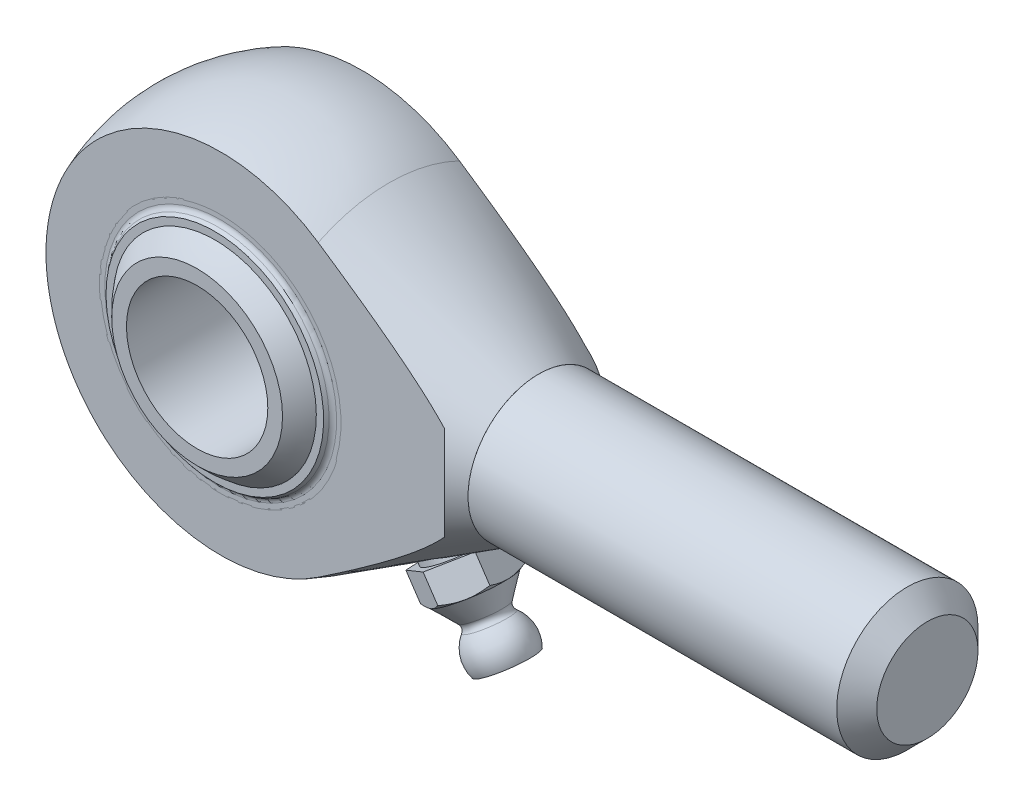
ISO-10303-21;
HEADER;
FILE_DESCRIPTION(('STEP AP214'),'2;1');
FILE_NAME('part.step','',(''),(''),'','','');
FILE_SCHEMA(('AUTOMOTIVE_DESIGN { 1 0 10303 214 1 1 1 1 }'));
ENDSEC;
DATA;
#1=APPLICATION_CONTEXT('core data for automotive mechanical design processes');
#2=APPLICATION_PROTOCOL_DEFINITION('international standard','automotive_design',2000,#1);
#3=PRODUCT_CONTEXT('',#1,'mechanical');
#4=PRODUCT('Part','Part','',(#3));
#5=PRODUCT_RELATED_PRODUCT_CATEGORY('part','',(#4));
#6=PRODUCT_DEFINITION_FORMATION('','',#4);
#7=PRODUCT_DEFINITION_CONTEXT('part definition',#1,'design');
#8=PRODUCT_DEFINITION('design','',#6,#7);
#9=PRODUCT_DEFINITION_SHAPE('','',#8);
#10=(LENGTH_UNIT() NAMED_UNIT(*) SI_UNIT(.MILLI.,.METRE.));
#11=(NAMED_UNIT(*) PLANE_ANGLE_UNIT() SI_UNIT($,.RADIAN.));
#12=(NAMED_UNIT(*) SI_UNIT($,.STERADIAN.) SOLID_ANGLE_UNIT());
#13=UNCERTAINTY_MEASURE_WITH_UNIT(LENGTH_MEASURE(1.E-05),#10,'distance_accuracy_value','');
#14=(GEOMETRIC_REPRESENTATION_CONTEXT(3) GLOBAL_UNCERTAINTY_ASSIGNED_CONTEXT((#13)) GLOBAL_UNIT_ASSIGNED_CONTEXT((#10,
#11,#12)) REPRESENTATION_CONTEXT('',''));
#15=CARTESIAN_POINT('',(0.,0.,0.));
#16=DIRECTION('',(0.,0.,1.));
#17=DIRECTION('',(1.,0.,0.));
#18=AXIS2_PLACEMENT_3D('',#15,#16,#17);
#19=CARTESIAN_POINT('',(-3.52219363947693,-10.8401973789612,1.50058280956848));
#20=DIRECTION('',(0.306373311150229,0.942920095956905,-0.130526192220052));
#21=DIRECTION('',(0.0403348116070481,0.124137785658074,0.99144486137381));
#22=AXIS2_PLACEMENT_3D('',#19,#20,#21);
#23=SPHERICAL_SURFACE('',#22,1.4);
#24=CARTESIAN_POINT('',(-3.09327100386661,-9.52010924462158,1.31784614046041));
#25=VERTEX_POINT('',#24);
#26=VERTEX_LOOP('',#25);
#27=FACE_BOUND('',#26,.T.);
#28=ADVANCED_FACE('P0_F12',(#27),#23,.T.);
#29=CLOSED_SHELL('',(#28));
#30=MANIFOLD_SOLID_BREP('P0_B1',#29);
#31=CARTESIAN_POINT('',(0.,11.3980580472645,1.50058280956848));
#32=DIRECTION('',(0.,-0.99144486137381,-0.130526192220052));
#33=DIRECTION('',(0.,-0.130526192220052,0.99144486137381));
#34=AXIS2_PLACEMENT_3D('',#31,#32,#33);
#35=SPHERICAL_SURFACE('',#34,1.4);
#36=CARTESIAN_POINT('',(0.,10.0100352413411,1.31784614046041));
#37=VERTEX_POINT('',#36);
#38=VERTEX_LOOP('',#37);
#39=FACE_BOUND('',#38,.T.);
#40=ADVANCED_FACE('P1_F12',(#39),#35,.T.);
#41=CLOSED_SHELL('',(#40));
#42=MANIFOLD_SOLID_BREP('P1_B1',#41);
#43=CARTESIAN_POINT('',(3.52219363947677,-10.8401973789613,-1.50058280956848));
#44=DIRECTION('',(-0.306373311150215,0.94292009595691,0.130526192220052));
#45=DIRECTION('',(-0.0403348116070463,0.124137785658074,-0.99144486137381));
#46=AXIS2_PLACEMENT_3D('',#43,#44,#45);
#47=SPHERICAL_SURFACE('',#46,1.4);
#48=CARTESIAN_POINT('',(3.09327100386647,-9.52010924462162,-1.31784614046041));
#49=VERTEX_POINT('',#48);
#50=VERTEX_LOOP('',#49);
#51=FACE_BOUND('',#50,.T.);
#52=ADVANCED_FACE('P2_F12',(#51),#47,.T.);
#53=CLOSED_SHELL('',(#52));
#54=MANIFOLD_SOLID_BREP('P2_B1',#53);
#55=CARTESIAN_POINT('',(0.,0.,0.));
#56=DIRECTION('',(0.,0.,1.));
#57=DIRECTION('',(0.999027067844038,0.044101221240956,0.));
#58=AXIS2_PLACEMENT_3D('',#55,#56,#57);
#59=CYLINDRICAL_SURFACE('',#58,10.3);
#60=CARTESIAN_POINT('',(0.,0.,-6.));
#61=DIRECTION('',(0.,0.,1.));
#62=DIRECTION('',(0.999027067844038,0.044101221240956,0.));
#63=AXIS2_PLACEMENT_3D('',#60,#61,#62);
#64=CIRCLE('',#63,10.3);
#65=CARTESIAN_POINT('',(10.2899787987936,0.454242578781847,-6.));
#66=VERTEX_POINT('',#65);
#67=EDGE_CURVE('P3_E34',#66,#66,#64,.T.);
#68=ORIENTED_EDGE('',*,*,#67,.T.);
#69=EDGE_LOOP('',(#68));
#70=FACE_BOUND('',#69,.T.);
#71=CARTESIAN_POINT('',(0.,0.,-5.5));
#72=DIRECTION('',(0.,0.,1.));
#73=DIRECTION('',(0.999027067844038,0.044101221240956,0.));
#74=AXIS2_PLACEMENT_3D('',#71,#72,#73);
#75=CIRCLE('',#74,10.3);
#76=CARTESIAN_POINT('',(10.2899787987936,0.454242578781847,-5.5));
#77=VERTEX_POINT('',#76);
#78=EDGE_CURVE('P3_E43',#77,#77,#75,.T.);
#79=ORIENTED_EDGE('',*,*,#78,.F.);
#80=EDGE_LOOP('',(#79));
#81=FACE_BOUND('',#80,.T.);
#82=ADVANCED_FACE('P3_F14',(#70,#81),#59,.T.);
#83=CARTESIAN_POINT('',(-0.454242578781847,10.2899787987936,-6.));
#84=DIRECTION('',(0.,0.,-1.));
#85=DIRECTION('',(-0.999027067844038,-0.044101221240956,0.));
#86=AXIS2_PLACEMENT_3D('',#83,#84,#85);
#87=PLANE('',#86);
#88=CARTESIAN_POINT('',(0.,0.,-6.));
#89=DIRECTION('',(0.,0.,-1.));
#90=DIRECTION('',(-0.999027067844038,-0.044101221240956,0.));
#91=AXIS2_PLACEMENT_3D('',#88,#89,#90);
#92=CIRCLE('',#91,9.84405012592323);
#93=CARTESIAN_POINT('',(-9.83447253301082,-0.434134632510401,-6.));
#94=VERTEX_POINT('',#93);
#95=EDGE_CURVE('P3_E21',#94,#94,#92,.F.);
#96=ORIENTED_EDGE('',*,*,#95,.T.);
#97=EDGE_LOOP('',(#96));
#98=FACE_BOUND('',#97,.T.);
#99=ORIENTED_EDGE('',*,*,#67,.F.);
#100=EDGE_LOOP('',(#99));
#101=FACE_BOUND('',#100,.T.);
#102=ADVANCED_FACE('P3_F50',(#98,#101),#87,.T.);
#103=CARTESIAN_POINT('',(0.,0.,0.));
#104=DIRECTION('',(0.,0.,1.));
#105=DIRECTION('',(-0.044101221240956,0.999027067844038,0.));
#106=AXIS2_PLACEMENT_3D('',#103,#104,#105);
#107=SPHERICAL_SURFACE('',#106,11.2964114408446);
#108=CARTESIAN_POINT('',(0.,0.,-6.22449248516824));
#109=DIRECTION('',(0.,0.,1.));
#110=DIRECTION('',(0.999027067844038,0.044101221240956,0.));
#111=AXIS2_PLACEMENT_3D('',#108,#109,#110);
#112=CIRCLE('',#111,9.42680246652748);
#113=CARTESIAN_POINT('',(-0.415733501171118,9.4176308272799,-6.22449248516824));
#114=VERTEX_POINT('',#113);
#115=EDGE_CURVE('P3_E10',#114,#114,#112,.F.);
#116=CARTESIAN_POINT('',(0.,0.,-6.5));
#117=DIRECTION('',(0.,0.,1.));
#118=DIRECTION('',(0.999027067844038,0.044101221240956,0.));
#119=AXIS2_PLACEMENT_3D('',#116,#117,#118);
#120=CIRCLE('',#119,9.23898865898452);
#121=CARTESIAN_POINT('',(-0.40745068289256,9.22999974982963,-6.5));
#122=VERTEX_POINT('',#121);
#123=EDGE_CURVE('P3_E37',#122,#122,#120,.T.);
#124=CARTESIAN_POINT('',(-0.415733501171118,9.4176308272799,-6.22449248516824));
#125=CARTESIAN_POINT('',(-0.41564909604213,9.41571879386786,-6.22739102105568));
#126=CARTESIAN_POINT('',(-0.41556463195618,9.41380542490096,-6.23028867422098));
#127=CARTESIAN_POINT('',(-0.415395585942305,9.4099760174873,-6.23608221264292));
#128=CARTESIAN_POINT('',(-0.415311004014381,9.40805997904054,-6.23897809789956));
#129=CARTESIAN_POINT('',(-0.415141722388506,9.40422523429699,-6.24476809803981));
#130=CARTESIAN_POINT('',(-0.415057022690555,9.4023065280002,-6.24766221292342));
#131=CARTESIAN_POINT('',(-0.414887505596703,9.39846644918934,-6.25344866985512));
#132=CARTESIAN_POINT('',(-0.414802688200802,9.39654507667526,-6.25634101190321));
#133=CARTESIAN_POINT('',(-0.414632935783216,9.39269966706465,-6.26212392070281));
#134=CARTESIAN_POINT('',(-0.414548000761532,9.39077562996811,-6.26501448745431));
#135=CARTESIAN_POINT('',(-0.414378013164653,9.38692489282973,-6.27079384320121));
#136=CARTESIAN_POINT('',(-0.414292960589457,9.38499819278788,-6.27368263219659));
#137=CARTESIAN_POINT('',(-0.414122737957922,9.38114213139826,-6.27945842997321));
#138=CARTESIAN_POINT('',(-0.414037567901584,9.3792127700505,-6.28234543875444));
#139=CARTESIAN_POINT('',(-0.413867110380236,9.37535138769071,-6.28811767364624));
#140=CARTESIAN_POINT('',(-0.413781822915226,9.3734193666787,-6.29100289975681));
#141=CARTESIAN_POINT('',(-0.413611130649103,9.36955266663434,-6.29677156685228));
#142=CARTESIAN_POINT('',(-0.41352572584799,9.367617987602,-6.29965500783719));
#143=CARTESIAN_POINT('',(-0.413354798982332,9.36374597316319,-6.30542010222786));
#144=CARTESIAN_POINT('',(-0.413269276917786,9.36180863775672,-6.30830175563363));
#145=CARTESIAN_POINT('',(-0.413098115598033,9.3579313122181,-6.31406327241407));
#146=CARTESIAN_POINT('',(-0.413012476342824,9.35599132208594,-6.31694313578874));
#147=CARTESIAN_POINT('',(-0.412841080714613,9.35210868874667,-6.32270107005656));
#148=CARTESIAN_POINT('',(-0.41275532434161,9.35016604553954,-6.3255791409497));
#149=CARTESIAN_POINT('',(-0.41258369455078,9.34627810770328,-6.33133348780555));
#150=CARTESIAN_POINT('',(-0.412497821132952,9.34433281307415,-6.33420976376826));
#151=CARTESIAN_POINT('',(-0.41232595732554,9.3404395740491,-6.33996051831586));
#152=CARTESIAN_POINT('',(-0.412239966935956,9.33849162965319,-6.34283499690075));
#153=CARTESIAN_POINT('',(-0.412067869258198,9.33459309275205,-6.34858215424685));
#154=CARTESIAN_POINT('',(-0.411981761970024,9.33264250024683,-6.35145483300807));
#155=CARTESIAN_POINT('',(-0.411809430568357,9.32873866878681,-6.35719838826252));
#156=CARTESIAN_POINT('',(-0.411723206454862,9.32678542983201,-6.36006926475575));
#157=CARTESIAN_POINT('',(-0.411550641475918,9.32287630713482,-6.36580921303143));
#158=CARTESIAN_POINT('',(-0.411464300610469,9.32092042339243,-6.36867828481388));
#159=CARTESIAN_POINT('',(-0.411291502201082,9.31700601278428,-6.37441462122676));
#160=CARTESIAN_POINT('',(-0.411205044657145,9.31504748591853,-6.37728188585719));
#161=CARTESIAN_POINT('',(-0.411032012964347,9.31112779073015,-6.3830146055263));
#162=CARTESIAN_POINT('',(-0.410945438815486,9.30916662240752,-6.38588006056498));
#163=CARTESIAN_POINT('',(-0.410772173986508,9.30524164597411,-6.39160915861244));
#164=CARTESIAN_POINT('',(-0.410685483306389,9.30327783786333,-6.39447280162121));
#165=CARTESIAN_POINT('',(-0.410511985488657,9.29934758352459,-6.4001982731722));
#166=CARTESIAN_POINT('',(-0.410425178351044,9.29738113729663,-6.40306010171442));
#167=CARTESIAN_POINT('',(-0.410251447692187,9.29344560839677,-6.40878194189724));
#168=CARTESIAN_POINT('',(-0.410164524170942,9.29147652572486,-6.41164195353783));
#169=CARTESIAN_POINT('',(-0.409990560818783,9.28753572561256,-6.41736015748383));
#170=CARTESIAN_POINT('',(-0.409903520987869,9.28556400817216,-6.42021834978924));
#171=CARTESIAN_POINT('',(-0.409729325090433,9.28161794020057,-6.4259329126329));
#172=CARTESIAN_POINT('',(-0.40964216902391,9.27964358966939,-6.42878928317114));
#173=CARTESIAN_POINT('',(-0.409467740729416,9.27569225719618,-6.43450020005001));
#174=CARTESIAN_POINT('',(-0.409380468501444,9.27371527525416,-6.43735474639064));
#175=CARTESIAN_POINT('',(-0.409205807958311,9.26975868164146,-6.4430620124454));
#176=CARTESIAN_POINT('',(-0.40911841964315,9.26777906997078,-6.44591473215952));
#177=CARTESIAN_POINT('',(-0.408943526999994,9.26381721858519,-6.45161834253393));
#178=CARTESIAN_POINT('',(-0.408856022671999,9.26183497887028,-6.45446923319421));
#179=CARTESIAN_POINT('',(-0.408680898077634,9.25786787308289,-6.46016918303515));
#180=CARTESIAN_POINT('',(-0.408593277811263,9.25588300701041,-6.46301824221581));
#181=CARTESIAN_POINT('',(-0.4084179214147,9.25191065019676,-6.46871452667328));
#182=CARTESIAN_POINT('',(-0.408330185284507,9.24992315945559,-6.47156175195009));
#183=CARTESIAN_POINT('',(-0.408154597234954,9.24594555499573,-6.47725436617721));
#184=CARTESIAN_POINT('',(-0.408066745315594,9.24395544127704,-6.48009975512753));
#185=CARTESIAN_POINT('',(-0.407890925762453,9.23997259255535,-6.48578869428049));
#186=CARTESIAN_POINT('',(-0.407802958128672,9.23797985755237,-6.48863224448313));
#187=CARTESIAN_POINT('',(-0.40762690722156,9.23399176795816,-6.49431750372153));
#188=CARTESIAN_POINT('',(-0.407538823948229,9.23199641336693,-6.49715921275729));
#189=CARTESIAN_POINT('',(-0.40745068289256,9.22999974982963,-6.5));
#190=B_SPLINE_CURVE_WITH_KNOTS('',3,(#124,#125,#126,#127,#128,#129,#130,#131,#132,#133,#134,
#135,#136,#137,#138,#139,#140,#141,#142,#143,#144,#145,#146,#147,#148,#149,#150,#151,#152,#153,
#154,#155,#156,#157,#158,#159,#160,#161,#162,#163,#164,#165,#166,#167,#168,#169,#170,#171,#172,
#173,#174,#175,#176,#177,#178,#179,#180,#181,#182,#183,#184,#185,#186,#187,#188,#189),
.UNSPECIFIED.,.F.,.F.,(4,2,2,2,2,2,2,2,2,2,2,2,2,2,2,2,2,2,2,2,2,2,2,2,2,2,2,2,2,2,2,2,4),(0.,
0.0104201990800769,0.0208403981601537,0.0312605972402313,0.0416807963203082,0.0521009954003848,
0.0625211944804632,0.0729413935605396,0.0833615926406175,0.0937817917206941,0.104201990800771,
0.114622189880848,0.125042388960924,0.135462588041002,0.145882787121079,0.156302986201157,
0.166723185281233,0.17714338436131,0.187563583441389,0.197983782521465,0.208403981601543,
0.218824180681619,0.229244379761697,0.239664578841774,0.250084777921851,0.260504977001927,
0.270925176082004,0.281345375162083,0.291765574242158,0.302185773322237,0.312605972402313,
0.323026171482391,0.333446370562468),.UNSPECIFIED.);
#191=EDGE_CURVE('P3_BSEAM57',#114,#122,#190,.T.);
#192=ORIENTED_EDGE('',*,*,#115,.T.);
#193=ORIENTED_EDGE('',*,*,#123,.T.);
#194=ORIENTED_EDGE('',*,*,#191,.T.);
#195=ORIENTED_EDGE('',*,*,#191,.F.);
#196=EDGE_LOOP('',(#192,#194,#193,#195));
#197=FACE_BOUND('',#196,.T.);
#198=ADVANCED_FACE('P3_F57',(#197),#107,.T.);
#199=CARTESIAN_POINT('',(-0.380173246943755,8.6120826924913,-6.5));
#200=DIRECTION('',(0.,0.,-1.));
#201=DIRECTION('',(-0.999027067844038,-0.044101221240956,0.));
#202=AXIS2_PLACEMENT_3D('',#199,#200,#201);
#203=PLANE('',#202);
#204=CARTESIAN_POINT('',(0.,0.,-6.5));
#205=DIRECTION('',(0.,0.,1.));
#206=DIRECTION('',(0.999027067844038,0.044101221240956,0.));
#207=AXIS2_PLACEMENT_3D('',#204,#205,#206);
#208=CIRCLE('',#207,8.62046982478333);
#209=CARTESIAN_POINT('',(-0.380173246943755,8.6120826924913,-6.50000000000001));
#210=VERTEX_POINT('',#209);
#211=EDGE_CURVE('P3_E40',#210,#210,#208,.T.);
#212=ORIENTED_EDGE('',*,*,#211,.T.);
#213=EDGE_LOOP('',(#212));
#214=FACE_BOUND('',#213,.T.);
#215=ORIENTED_EDGE('',*,*,#123,.F.);
#216=EDGE_LOOP('',(#215));
#217=FACE_BOUND('',#216,.T.);
#218=ADVANCED_FACE('P3_F77',(#214,#217),#203,.T.);
#219=CARTESIAN_POINT('',(0.,0.,0.));
#220=DIRECTION('',(0.,0.,1.));
#221=DIRECTION('',(-0.044101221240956,0.999027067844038,0.));
#222=AXIS2_PLACEMENT_3D('',#219,#220,#221);
#223=SPHERICAL_SURFACE('',#222,10.7964114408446);
#224=CARTESIAN_POINT('',(0.,0.,-5.73442893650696));
#225=DIRECTION('',(0.,0.,1.));
#226=DIRECTION('',(0.999027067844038,0.044101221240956,0.));
#227=AXIS2_PLACEMENT_3D('',#224,#225,#226);
#228=CIRCLE('',#227,9.14761306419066);
#229=CARTESIAN_POINT('',(-0.403420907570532,9.13871305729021,-5.73442893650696));
#230=VERTEX_POINT('',#229);
#231=EDGE_CURVE('P3_E29',#230,#230,#228,.T.);
#232=CARTESIAN_POINT('',(-0.403420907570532,9.13871305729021,-5.73442893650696));
#233=CARTESIAN_POINT('',(-0.403194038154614,9.13357377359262,-5.74263515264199));
#234=CARTESIAN_POINT('',(-0.402966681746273,9.12842345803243,-5.75083444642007));
#235=CARTESIAN_POINT('',(-0.402510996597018,9.11810080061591,-5.76721912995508));
#236=CARTESIAN_POINT('',(-0.402282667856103,9.11292845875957,-5.77540451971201));
#237=CARTESIAN_POINT('',(-0.401825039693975,9.10256178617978,-5.79176133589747));
#238=CARTESIAN_POINT('',(-0.401595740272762,9.09736745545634,-5.799932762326));
#239=CARTESIAN_POINT('',(-0.401136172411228,9.08695684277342,-5.81626159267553));
#240=CARTESIAN_POINT('',(-0.400905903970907,9.08174056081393,-5.82441899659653));
#241=CARTESIAN_POINT('',(-0.400444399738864,9.07128608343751,-5.84071972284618));
#242=CARTESIAN_POINT('',(-0.400213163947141,9.06604788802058,-5.84886304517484));
#243=CARTESIAN_POINT('',(-0.399749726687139,9.05554962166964,-5.86513554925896));
#244=CARTESIAN_POINT('',(-0.399517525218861,9.05028955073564,-5.87326473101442));
#245=CARTESIAN_POINT('',(-0.399052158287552,9.03974757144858,-5.88950889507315));
#246=CARTESIAN_POINT('',(-0.398818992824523,9.03446566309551,-5.89762387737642));
#247=CARTESIAN_POINT('',(-0.398351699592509,9.02388004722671,-5.91383958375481));
#248=CARTESIAN_POINT('',(-0.398117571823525,9.01857633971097,-5.92194030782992));
#249=CARTESIAN_POINT('',(-0.397648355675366,9.00794716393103,-5.93812743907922));
#250=CARTESIAN_POINT('',(-0.397413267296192,9.00262169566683,-5.94621384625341));
#251=CARTESIAN_POINT('',(-0.396942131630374,8.99194903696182,-5.96237228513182));
#252=CARTESIAN_POINT('',(-0.39670608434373,8.986601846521,-5.97044431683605));
#253=CARTESIAN_POINT('',(-0.396233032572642,8.97588578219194,-5.98657394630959));
#254=CARTESIAN_POINT('',(-0.395996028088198,8.97051690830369,-5.99463154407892));
#255=CARTESIAN_POINT('',(-0.395521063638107,8.95975751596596,-6.01073224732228));
#256=CARTESIAN_POINT('',(-0.395283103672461,8.95436699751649,-6.01877535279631));
#257=CARTESIAN_POINT('',(-0.394806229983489,8.94356435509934,-6.03484701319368));
#258=CARTESIAN_POINT('',(-0.394567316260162,8.93815223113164,-6.04287556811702));
#259=CARTESIAN_POINT('',(-0.394088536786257,8.92730641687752,-6.05891806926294));
#260=CARTESIAN_POINT('',(-0.393848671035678,8.92187272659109,-6.06693201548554));
#261=CARTESIAN_POINT('',(-0.393367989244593,8.91098381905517,-6.08294524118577));
#262=CARTESIAN_POINT('',(-0.393127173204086,8.90552860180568,-6.0909445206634));
#263=CARTESIAN_POINT('',(-0.392644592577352,8.89459667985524,-6.10692835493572));
#264=CARTESIAN_POINT('',(-0.392402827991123,8.88911997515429,-6.1149129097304));
#265=CARTESIAN_POINT('',(-0.391918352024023,8.87814511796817,-6.13086723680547));
#266=CARTESIAN_POINT('',(-0.391675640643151,8.87264696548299,-6.13883700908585));
#267=CARTESIAN_POINT('',(-0.391189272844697,8.861629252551,-6.15476171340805));
#268=CARTESIAN_POINT('',(-0.390945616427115,8.85610969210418,-6.16271664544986));
#269=CARTESIAN_POINT('',(-0.390457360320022,8.84504920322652,-6.17861161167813));
#270=CARTESIAN_POINT('',(-0.39021276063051,8.83950827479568,-6.18655164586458));
#271=CARTESIAN_POINT('',(-0.389722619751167,8.82840509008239,-6.20241675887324));
#272=CARTESIAN_POINT('',(-0.389477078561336,8.82284283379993,-6.21034183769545));
#273=CARTESIAN_POINT('',(-0.388985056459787,8.81169703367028,-6.22617698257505));
#274=CARTESIAN_POINT('',(-0.388738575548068,8.80611348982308,-6.23408704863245));
#275=CARTESIAN_POINT('',(-0.388244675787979,8.79492515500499,-6.2498921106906));
#276=CARTESIAN_POINT('',(-0.38799725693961,8.78932036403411,-6.25778710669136));
#277=CARTESIAN_POINT('',(-0.387501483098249,8.7780895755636,-6.27356197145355));
#278=CARTESIAN_POINT('',(-0.387253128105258,8.77246357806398,-6.28144184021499));
#279=CARTESIAN_POINT('',(-0.386755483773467,8.76119041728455,-6.29718639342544));
#280=CARTESIAN_POINT('',(-0.386506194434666,8.75554325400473,-6.30505107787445));
#281=CARTESIAN_POINT('',(-0.386006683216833,8.74422780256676,-6.32076520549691));
#282=CARTESIAN_POINT('',(-0.3857564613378,8.7385595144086,-6.32861464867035));
#283=CARTESIAN_POINT('',(-0.385255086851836,8.7272018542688,-6.34429823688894));
#284=CARTESIAN_POINT('',(-0.385003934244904,8.72151248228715,-6.35213238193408));
#285=CARTESIAN_POINT('',(-0.384500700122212,8.7101126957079,-6.36778531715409));
#286=CARTESIAN_POINT('',(-0.384248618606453,8.70440228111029,-6.37560410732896));
#287=CARTESIAN_POINT('',(-0.383743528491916,8.69296045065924,-6.39122627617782));
#288=CARTESIAN_POINT('',(-0.383490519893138,8.6872290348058,-6.39902965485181));
#289=CARTESIAN_POINT('',(-0.382983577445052,8.67574524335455,-6.41462094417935));
#290=CARTESIAN_POINT('',(-0.382729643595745,8.66999286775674,-6.4224088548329));
#291=CARTESIAN_POINT('',(-0.382220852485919,8.65846719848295,-6.43796915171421));
#292=CARTESIAN_POINT('',(-0.381965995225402,8.65269390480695,-6.44574153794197));
#293=CARTESIAN_POINT('',(-0.381455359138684,8.64112644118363,-6.46127072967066));
#294=CARTESIAN_POINT('',(-0.381199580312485,8.63533227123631,-6.46902753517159));
#295=CARTESIAN_POINT('',(-0.380687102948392,8.62372309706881,-6.48452550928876));
#296=CARTESIAN_POINT('',(-0.3804304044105,8.61790809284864,-6.49226667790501));
#297=CARTESIAN_POINT('',(-0.380173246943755,8.6120826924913,-6.50000000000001));
#298=B_SPLINE_CURVE_WITH_KNOTS('',3,(#232,#233,#234,#235,#236,#237,#238,#239,#240,#241,#242,
#243,#244,#245,#246,#247,#248,#249,#250,#251,#252,#253,#254,#255,#256,#257,#258,#259,#260,#261,
#262,#263,#264,#265,#266,#267,#268,#269,#270,#271,#272,#273,#274,#275,#276,#277,#278,#279,#280,
#281,#282,#283,#284,#285,#286,#287,#288,#289,#290,#291,#292,#293,#294,#295,#296,#297),
.UNSPECIFIED.,.F.,.F.,(4,2,2,2,2,2,2,2,2,2,2,2,2,2,2,2,2,2,2,2,2,2,2,2,2,2,2,2,2,2,2,2,4),(0.,
0.0290559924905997,0.0581119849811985,0.087167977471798,0.116223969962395,0.145279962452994,
0.174335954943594,0.203391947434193,0.23244793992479,0.26150393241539,0.290559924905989,
0.319615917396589,0.348671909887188,0.377727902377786,0.406783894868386,0.435839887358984,
0.464895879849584,0.493951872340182,0.523007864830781,0.55206385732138,0.581119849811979,
0.610175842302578,0.639231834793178,0.668287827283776,0.697343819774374,0.726399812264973,
0.755455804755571,0.784511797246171,0.813567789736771,0.842623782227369,0.871679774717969,
0.900735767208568,0.929791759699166),.UNSPECIFIED.);
#299=EDGE_CURVE('P3_BSEAM68',#230,#210,#298,.T.);
#300=ORIENTED_EDGE('',*,*,#231,.T.);
#301=ORIENTED_EDGE('',*,*,#211,.F.);
#302=ORIENTED_EDGE('',*,*,#299,.T.);
#303=ORIENTED_EDGE('',*,*,#299,.F.);
#304=EDGE_LOOP('',(#300,#302,#301,#303));
#305=FACE_BOUND('',#304,.T.);
#306=ADVANCED_FACE('P3_F68',(#305),#223,.F.);
#307=CARTESIAN_POINT('',(-0.454242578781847,10.2899787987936,-5.5));
#308=DIRECTION('',(0.,0.,1.));
#309=DIRECTION('',(0.999027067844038,0.044101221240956,0.));
#310=AXIS2_PLACEMENT_3D('',#307,#308,#309);
#311=PLANE('',#310);
#312=CARTESIAN_POINT('',(0.,0.,-5.5));
#313=DIRECTION('',(0.,0.,1.));
#314=DIRECTION('',(0.999027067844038,0.044101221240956,0.));
#315=AXIS2_PLACEMENT_3D('',#312,#313,#314);
#316=CIRCLE('',#315,9.57125443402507);
#317=CARTESIAN_POINT('',(9.56194225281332,0.422104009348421,-5.5));
#318=VERTEX_POINT('',#317);
#319=EDGE_CURVE('P3_E25',#318,#318,#316,.F.);
#320=ORIENTED_EDGE('',*,*,#319,.T.);
#321=EDGE_LOOP('',(#320));
#322=FACE_BOUND('',#321,.T.);
#323=ORIENTED_EDGE('',*,*,#78,.T.);
#324=EDGE_LOOP('',(#323));
#325=FACE_BOUND('',#324,.T.);
#326=ADVANCED_FACE('P3_F47',(#322,#325),#311,.T.);
#327=CARTESIAN_POINT('',(0.,0.,-6.));
#328=DIRECTION('',(0.,0.,1.));
#329=DIRECTION('',(0.999027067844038,0.044101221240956,0.));
#330=AXIS2_PLACEMENT_3D('',#327,#328,#329);
#331=TOROIDAL_SURFACE('',#330,9.57125443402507,0.5);
#332=ORIENTED_EDGE('',*,*,#319,.F.);
#333=EDGE_LOOP('',(#332));
#334=FACE_BOUND('',#333,.T.);
#335=ORIENTED_EDGE('',*,*,#231,.F.);
#336=EDGE_LOOP('',(#335));
#337=FACE_BOUND('',#336,.T.);
#338=ADVANCED_FACE('P3_F60',(#334,#337),#331,.T.);
#339=CARTESIAN_POINT('',(0.,0.,-6.5));
#340=DIRECTION('',(0.,0.,-1.));
#341=DIRECTION('',(-0.999027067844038,-0.044101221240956,0.));
#342=AXIS2_PLACEMENT_3D('',#339,#340,#341);
#343=TOROIDAL_SURFACE('',#342,9.84405012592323,0.5);
#344=ORIENTED_EDGE('',*,*,#115,.F.);
#345=EDGE_LOOP('',(#344));
#346=FACE_BOUND('',#345,.T.);
#347=ORIENTED_EDGE('',*,*,#95,.F.);
#348=EDGE_LOOP('',(#347));
#349=FACE_BOUND('',#348,.T.);
#350=ADVANCED_FACE('P3_F16',(#346,#349),#343,.F.);
#351=CLOSED_SHELL('',(#82,#102,#198,#218,#306,#326,#338,#350));
#352=MANIFOLD_SOLID_BREP('P3_B1',#351);
#353=CARTESIAN_POINT('',(-6.69961042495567,-9.22122266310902,1.50058280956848));
#354=DIRECTION('',(0.582756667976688,0.802095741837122,-0.130526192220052));
#355=DIRECTION('',(0.07672137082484,0.105597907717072,0.99144486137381));
#356=AXIS2_PLACEMENT_3D('',#353,#354,#355);
#357=SPHERICAL_SURFACE('',#356,1.4);
#358=CARTESIAN_POINT('',(-5.88375108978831,-8.09828862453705,1.31784614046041));
#359=VERTEX_POINT('',#358);
#360=VERTEX_LOOP('',#359);
#361=FACE_BOUND('',#360,.T.);
#362=ADVANCED_FACE('P4_F12',(#361),#357,.T.);
#363=CLOSED_SHELL('',(#362));
#364=MANIFOLD_SOLID_BREP('P4_B1',#363);
#365=CARTESIAN_POINT('',(3.52219363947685,10.8401973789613,1.50058280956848));
#366=DIRECTION('',(-0.306373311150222,-0.942920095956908,-0.130526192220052));
#367=DIRECTION('',(-0.0403348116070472,-0.124137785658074,0.99144486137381));
#368=AXIS2_PLACEMENT_3D('',#365,#366,#367);
#369=SPHERICAL_SURFACE('',#368,1.4);
#370=CARTESIAN_POINT('',(3.09327100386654,9.5201092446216,1.31784614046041));
#371=VERTEX_POINT('',#370);
#372=VERTEX_LOOP('',#371);
#373=FACE_BOUND('',#372,.T.);
#374=ADVANCED_FACE('P5_F12',(#373),#369,.T.);
#375=CLOSED_SHELL('',(#374));
#376=MANIFOLD_SOLID_BREP('P5_B1',#375);
#377=CARTESIAN_POINT('',(0.,-11.3980580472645,-1.50058280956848));
#378=DIRECTION('',(0.,0.99144486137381,0.130526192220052));
#379=DIRECTION('',(0.,0.130526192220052,-0.99144486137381));
#380=AXIS2_PLACEMENT_3D('',#377,#378,#379);
#381=SPHERICAL_SURFACE('',#380,1.4);
#382=CARTESIAN_POINT('',(0.,-10.0100352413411,-1.31784614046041));
#383=VERTEX_POINT('',#382);
#384=VERTEX_LOOP('',#383);
#385=FACE_BOUND('',#384,.T.);
#386=ADVANCED_FACE('P6_F12',(#385),#381,.T.);
#387=CLOSED_SHELL('',(#386));
#388=MANIFOLD_SOLID_BREP('P6_B1',#387);
#389=CARTESIAN_POINT('',(-9.22122266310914,-6.6996104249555,1.50058280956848));
#390=DIRECTION('',(0.802095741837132,0.582756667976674,-0.130526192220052));
#391=DIRECTION('',(0.105597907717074,0.0767213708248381,0.99144486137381));
#392=AXIS2_PLACEMENT_3D('',#389,#390,#391);
#393=SPHERICAL_SURFACE('',#392,1.4);
#394=CARTESIAN_POINT('',(-8.09828862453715,-5.88375108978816,1.31784614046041));
#395=VERTEX_POINT('',#394);
#396=VERTEX_LOOP('',#395);
#397=FACE_BOUND('',#396,.T.);
#398=ADVANCED_FACE('P7_F12',(#397),#393,.T.);
#399=CLOSED_SHELL('',(#398));
#400=MANIFOLD_SOLID_BREP('P7_B1',#399);
#401=CARTESIAN_POINT('',(6.69961042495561,9.22122266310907,1.50058280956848));
#402=DIRECTION('',(-0.582756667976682,-0.802095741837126,-0.130526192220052));
#403=DIRECTION('',(-0.0767213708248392,-0.105597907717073,0.99144486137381));
#404=AXIS2_PLACEMENT_3D('',#401,#402,#403);
#405=SPHERICAL_SURFACE('',#404,1.4);
#406=CARTESIAN_POINT('',(5.88375108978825,8.09828862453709,1.31784614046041));
#407=VERTEX_POINT('',#406);
#408=VERTEX_LOOP('',#407);
#409=FACE_BOUND('',#408,.T.);
#410=ADVANCED_FACE('P8_F12',(#409),#405,.T.);
#411=CLOSED_SHELL('',(#410));
#412=MANIFOLD_SOLID_BREP('P8_B1',#411);
#413=CARTESIAN_POINT('',(-3.52219363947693,-10.8401973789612,-1.50058280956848));
#414=DIRECTION('',(0.306373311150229,0.942920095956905,0.130526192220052));
#415=DIRECTION('',(0.0403348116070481,0.124137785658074,-0.99144486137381));
#416=AXIS2_PLACEMENT_3D('',#413,#414,#415);
#417=SPHERICAL_SURFACE('',#416,1.4);
#418=CARTESIAN_POINT('',(-3.09327100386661,-9.52010924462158,-1.31784614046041));
#419=VERTEX_POINT('',#418);
#420=VERTEX_LOOP('',#419);
#421=FACE_BOUND('',#420,.T.);
#422=ADVANCED_FACE('P9_F12',(#421),#417,.T.);
#423=CLOSED_SHELL('',(#422));
#424=MANIFOLD_SOLID_BREP('P9_B1',#423);
#425=CARTESIAN_POINT('',(0.,0.,0.));
#426=DIRECTION('',(0.,1.,0.));
#427=DIRECTION('',(1.,0.,0.));
#428=AXIS2_PLACEMENT_3D('',#425,#426,#427);
#429=SPHERICAL_SURFACE('',#428,10.7964114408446);
#430=CARTESIAN_POINT('',(0.,0.,0.));
#431=DIRECTION('',(0.,0.,1.));
#432=DIRECTION('',(1.,0.,0.));
#433=AXIS2_PLACEMENT_3D('',#430,#431,#432);
#434=SPHERICAL_SURFACE('',#433,10.7964114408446);
#435=CARTESIAN_POINT('',(0.,0.,2.56403609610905));
#436=DIRECTION('',(0.,0.,1.));
#437=DIRECTION('',(1.,0.,0.));
#438=AXIS2_PLACEMENT_3D('',#435,#436,#437);
#439=CIRCLE('',#438,10.4875268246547);
#440=CARTESIAN_POINT('',(10.4875268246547,0.,2.56403609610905));
#441=VERTEX_POINT('',#440);
#442=EDGE_CURVE('P10_E18',#441,#441,#439,.F.);
#443=ORIENTED_EDGE('',*,*,#442,.F.);
#444=EDGE_LOOP('',(#443));
#445=FACE_BOUND('',#444,.T.);
#446=CARTESIAN_POINT('',(0.,0.,8.));
#447=DIRECTION('',(0.,0.,-1.));
#448=DIRECTION('',(-1.,0.,0.));
#449=AXIS2_PLACEMENT_3D('',#446,#447,#448);
#450=CIRCLE('',#449,7.25);
#451=CARTESIAN_POINT('',(-7.25,0.,8.));
#452=VERTEX_POINT('',#451);
#453=EDGE_CURVE('P10_E27',#452,#452,#450,.F.);
#454=ORIENTED_EDGE('',*,*,#453,.F.);
#455=EDGE_LOOP('',(#454));
#456=FACE_BOUND('',#455,.T.);
#457=ADVANCED_FACE('P10_F14',(#445,#456),#434,.T.);
#458=CARTESIAN_POINT('',(0.,0.,0.));
#459=DIRECTION('',(0.,0.,-1.));
#460=DIRECTION('',(-1.,0.,0.));
#461=AXIS2_PLACEMENT_3D('',#458,#459,#460);
#462=SPHERICAL_SURFACE('',#461,10.7964114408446);
#463=CARTESIAN_POINT('',(0.,0.,-2.56403609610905));
#464=DIRECTION('',(0.,0.,-1.));
#465=DIRECTION('',(-1.,0.,0.));
#466=AXIS2_PLACEMENT_3D('',#463,#464,#465);
#467=CIRCLE('',#466,10.4875268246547);
#468=CARTESIAN_POINT('',(-10.4875268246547,0.,-2.56403609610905));
#469=VERTEX_POINT('',#468);
#470=EDGE_CURVE('P10_E34',#469,#469,#467,.F.);
#471=ORIENTED_EDGE('',*,*,#470,.F.);
#472=EDGE_LOOP('',(#471));
#473=FACE_BOUND('',#472,.T.);
#474=CARTESIAN_POINT('',(0.,0.,-8.));
#475=DIRECTION('',(0.,0.,1.));
#476=DIRECTION('',(1.,0.,0.));
#477=AXIS2_PLACEMENT_3D('',#474,#475,#476);
#478=CIRCLE('',#477,7.25);
#479=CARTESIAN_POINT('',(7.25,0.,-8.));
#480=VERTEX_POINT('',#479);
#481=EDGE_CURVE('P10_E10',#480,#480,#478,.F.);
#482=ORIENTED_EDGE('',*,*,#481,.F.);
#483=EDGE_LOOP('',(#482));
#484=FACE_BOUND('',#483,.T.);
#485=ADVANCED_FACE('P10_F50',(#473,#484),#462,.T.);
#486=CARTESIAN_POINT('',(0.,0.,0.));
#487=DIRECTION('',(0.,0.,-1.));
#488=DIRECTION('',(-1.,0.,0.));
#489=AXIS2_PLACEMENT_3D('',#486,#487,#488);
#490=SPHERICAL_SURFACE('',#489,10.7964114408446);
#491=CARTESIAN_POINT('',(0.,0.,0.237702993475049));
#492=DIRECTION('',(0.,0.,-1.));
#493=DIRECTION('',(-1.,0.,0.));
#494=AXIS2_PLACEMENT_3D('',#491,#492,#493);
#495=CIRCLE('',#494,10.7937943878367);
#496=CARTESIAN_POINT('',(-10.7937943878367,0.,0.237702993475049));
#497=VERTEX_POINT('',#496);
#498=EDGE_CURVE('P10_E39',#497,#497,#495,.F.);
#499=ORIENTED_EDGE('',*,*,#498,.F.);
#500=EDGE_LOOP('',(#499));
#501=FACE_BOUND('',#500,.T.);
#502=CARTESIAN_POINT('',(0.,0.,-0.237702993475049));
#503=DIRECTION('',(0.,0.,1.));
#504=DIRECTION('',(1.,0.,0.));
#505=AXIS2_PLACEMENT_3D('',#502,#503,#504);
#506=CIRCLE('',#505,10.7937943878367);
#507=CARTESIAN_POINT('',(10.7937943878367,0.,-0.237702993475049));
#508=VERTEX_POINT('',#507);
#509=EDGE_CURVE('P10_E35',#508,#508,#506,.F.);
#510=ORIENTED_EDGE('',*,*,#509,.F.);
#511=EDGE_LOOP('',(#510));
#512=FACE_BOUND('',#511,.T.);
#513=ADVANCED_FACE('P10_F16',(#501,#512),#490,.T.);
#514=CARTESIAN_POINT('',(0.,0.,-10.7964114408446));
#515=DIRECTION('',(0.,0.,1.));
#516=DIRECTION('',(1.,0.,0.));
#517=AXIS2_PLACEMENT_3D('',#514,#515,#516);
#518=CYLINDRICAL_SURFACE('',#517,6.);
#519=CARTESIAN_POINT('',(0.,0.,8.));
#520=DIRECTION('',(0.,0.,-1.));
#521=DIRECTION('',(-1.,0.,0.));
#522=AXIS2_PLACEMENT_3D('',#519,#520,#521);
#523=CIRCLE('',#522,6.);
#524=CARTESIAN_POINT('',(-6.,0.,8.));
#525=VERTEX_POINT('',#524);
#526=EDGE_CURVE('P10_E31',#525,#525,#523,.F.);
#527=ORIENTED_EDGE('',*,*,#526,.T.);
#528=EDGE_LOOP('',(#527));
#529=FACE_BOUND('',#528,.T.);
#530=CARTESIAN_POINT('',(0.,0.,-8.));
#531=DIRECTION('',(0.,0.,1.));
#532=DIRECTION('',(1.,0.,0.));
#533=AXIS2_PLACEMENT_3D('',#530,#531,#532);
#534=CIRCLE('',#533,6.);
#535=CARTESIAN_POINT('',(6.,0.,-8.));
#536=VERTEX_POINT('',#535);
#537=EDGE_CURVE('P10_E22',#536,#536,#534,.F.);
#538=ORIENTED_EDGE('',*,*,#537,.T.);
#539=EDGE_LOOP('',(#538));
#540=FACE_BOUND('',#539,.T.);
#541=ADVANCED_FACE('P10_F62',(#529,#540),#518,.F.);
#542=CARTESIAN_POINT('',(-10.7964114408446,-10.7964114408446,-8.));
#543=DIRECTION('',(0.,0.,1.));
#544=DIRECTION('',(1.,0.,0.));
#545=AXIS2_PLACEMENT_3D('',#542,#543,#544);
#546=PLANE('',#545);
#547=ORIENTED_EDGE('',*,*,#481,.T.);
#548=EDGE_LOOP('',(#547));
#549=FACE_BOUND('',#548,.T.);
#550=ORIENTED_EDGE('',*,*,#537,.F.);
#551=EDGE_LOOP('',(#550));
#552=FACE_BOUND('',#551,.T.);
#553=ADVANCED_FACE('P10_F58',(#549,#552),#546,.F.);
#554=CARTESIAN_POINT('',(-10.7964114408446,-10.7964114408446,8.));
#555=DIRECTION('',(0.,0.,-1.));
#556=DIRECTION('',(-1.,0.,0.));
#557=AXIS2_PLACEMENT_3D('',#554,#555,#556);
#558=PLANE('',#557);
#559=ORIENTED_EDGE('',*,*,#453,.T.);
#560=EDGE_LOOP('',(#559));
#561=FACE_BOUND('',#560,.T.);
#562=ORIENTED_EDGE('',*,*,#526,.F.);
#563=EDGE_LOOP('',(#562));
#564=FACE_BOUND('',#563,.T.);
#565=ADVANCED_FACE('P10_F54',(#561,#564),#558,.F.);
#566=CARTESIAN_POINT('',(0.,0.,-1.50058280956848));
#567=DIRECTION('',(0.,0.,-1.));
#568=DIRECTION('',(-1.,0.,0.));
#569=AXIS2_PLACEMENT_3D('',#566,#567,#568);
#570=TOROIDAL_SURFACE('',#569,11.3980580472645,1.4);
#571=ORIENTED_EDGE('',*,*,#470,.T.);
#572=EDGE_LOOP('',(#571));
#573=FACE_BOUND('',#572,.T.);
#574=ORIENTED_EDGE('',*,*,#509,.T.);
#575=EDGE_LOOP('',(#574));
#576=FACE_BOUND('',#575,.T.);
#577=ADVANCED_FACE('P10_F57',(#573,#576),#570,.F.);
#578=CARTESIAN_POINT('',(0.,0.,1.50058280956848));
#579=DIRECTION('',(0.,0.,-1.));
#580=DIRECTION('',(-1.,0.,0.));
#581=AXIS2_PLACEMENT_3D('',#578,#579,#580);
#582=TOROIDAL_SURFACE('',#581,11.3980580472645,1.4);
#583=ORIENTED_EDGE('',*,*,#442,.T.);
#584=EDGE_LOOP('',(#583));
#585=FACE_BOUND('',#584,.T.);
#586=ORIENTED_EDGE('',*,*,#498,.T.);
#587=EDGE_LOOP('',(#586));
#588=FACE_BOUND('',#587,.T.);
#589=ADVANCED_FACE('P10_F46',(#585,#588),#582,.F.);
#590=CLOSED_SHELL('',(#457,#485,#513,#541,#553,#565,#577,#589));
#591=MANIFOLD_SOLID_BREP('P10_B1',#590);
#592=CARTESIAN_POINT('',(-10.8401973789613,-3.52219363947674,1.50058280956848));
#593=DIRECTION('',(0.942920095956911,0.306373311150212,-0.130526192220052));
#594=DIRECTION('',(0.124137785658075,0.0403348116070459,0.99144486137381));
#595=AXIS2_PLACEMENT_3D('',#592,#593,#594);
#596=SPHERICAL_SURFACE('',#595,1.4);
#597=CARTESIAN_POINT('',(-9.52010924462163,-3.09327100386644,1.31784614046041));
#598=VERTEX_POINT('',#597);
#599=VERTEX_LOOP('',#598);
#600=FACE_BOUND('',#599,.T.);
#601=ADVANCED_FACE('P11_F12',(#600),#596,.T.);
#602=CLOSED_SHELL('',(#601));
#603=MANIFOLD_SOLID_BREP('P11_B1',#602);
#604=CARTESIAN_POINT('',(9.22122266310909,6.69961042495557,1.50058280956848));
#605=DIRECTION('',(-0.802095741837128,-0.582756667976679,-0.130526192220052));
#606=DIRECTION('',(-0.105597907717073,-0.0767213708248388,0.99144486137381));
#607=AXIS2_PLACEMENT_3D('',#604,#605,#606);
#608=SPHERICAL_SURFACE('',#607,1.4);
#609=CARTESIAN_POINT('',(8.09828862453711,5.88375108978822,1.31784614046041));
#610=VERTEX_POINT('',#609);
#611=VERTEX_LOOP('',#610);
#612=FACE_BOUND('',#611,.T.);
#613=ADVANCED_FACE('P12_F12',(#612),#608,.T.);
#614=CLOSED_SHELL('',(#613));
#615=MANIFOLD_SOLID_BREP('P12_B1',#614);
#616=CARTESIAN_POINT('',(-6.69961042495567,-9.22122266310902,-1.50058280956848));
#617=DIRECTION('',(0.582756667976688,0.802095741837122,0.130526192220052));
#618=DIRECTION('',(0.07672137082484,0.105597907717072,-0.99144486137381));
#619=AXIS2_PLACEMENT_3D('',#616,#617,#618);
#620=SPHERICAL_SURFACE('',#619,1.4);
#621=CARTESIAN_POINT('',(-5.88375108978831,-8.09828862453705,-1.31784614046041));
#622=VERTEX_POINT('',#621);
#623=VERTEX_LOOP('',#622);
#624=FACE_BOUND('',#623,.T.);
#625=ADVANCED_FACE('P13_F12',(#624),#620,.T.);
#626=CLOSED_SHELL('',(#625));
#627=MANIFOLD_SOLID_BREP('P13_B1',#626);
#628=CARTESIAN_POINT('',(0.,11.3980580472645,-1.50058280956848));
#629=DIRECTION('',(0.,-0.99144486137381,0.130526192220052));
#630=DIRECTION('',(0.,-0.130526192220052,-0.99144486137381));
#631=AXIS2_PLACEMENT_3D('',#628,#629,#630);
#632=SPHERICAL_SURFACE('',#631,1.4);
#633=CARTESIAN_POINT('',(0.,10.0100352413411,-1.31784614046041));
#634=VERTEX_POINT('',#633);
#635=VERTEX_LOOP('',#634);
#636=FACE_BOUND('',#635,.T.);
#637=ADVANCED_FACE('P14_F12',(#636),#632,.T.);
#638=CLOSED_SHELL('',(#637));
#639=MANIFOLD_SOLID_BREP('P14_B1',#638);
#640=CARTESIAN_POINT('',(-11.3980580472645,1.19388390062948E-13,1.50058280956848));
#641=DIRECTION('',(0.99144486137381,0.,-0.130526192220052));
#642=DIRECTION('',(0.130526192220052,0.,0.99144486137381));
#643=AXIS2_PLACEMENT_3D('',#640,#641,#642);
#644=SPHERICAL_SURFACE('',#643,1.4);
#645=CARTESIAN_POINT('',(-10.0100352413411,1.04849614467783E-13,1.31784614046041));
#646=VERTEX_POINT('',#645);
#647=VERTEX_LOOP('',#646);
#648=FACE_BOUND('',#647,.T.);
#649=ADVANCED_FACE('P15_F12',(#648),#644,.T.);
#650=CLOSED_SHELL('',(#649));
#651=MANIFOLD_SOLID_BREP('P15_B1',#650);
#652=CARTESIAN_POINT('',(10.8401973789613,3.52219363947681,1.50058280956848));
#653=DIRECTION('',(-0.942920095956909,-0.306373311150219,-0.130526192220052));
#654=DIRECTION('',(-0.124137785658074,-0.0403348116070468,0.99144486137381));
#655=AXIS2_PLACEMENT_3D('',#652,#653,#654);
#656=SPHERICAL_SURFACE('',#655,1.4);
#657=CARTESIAN_POINT('',(9.52010924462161,3.09327100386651,1.31784614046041));
#658=VERTEX_POINT('',#657);
#659=VERTEX_LOOP('',#658);
#660=FACE_BOUND('',#659,.T.);
#661=ADVANCED_FACE('P16_F12',(#660),#656,.T.);
#662=CLOSED_SHELL('',(#661));
#663=MANIFOLD_SOLID_BREP('P16_B1',#662);
#664=CARTESIAN_POINT('',(-9.22122266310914,-6.6996104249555,-1.50058280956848));
#665=DIRECTION('',(0.802095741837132,0.582756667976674,0.130526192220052));
#666=DIRECTION('',(0.105597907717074,0.0767213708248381,-0.99144486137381));
#667=AXIS2_PLACEMENT_3D('',#664,#665,#666);
#668=SPHERICAL_SURFACE('',#667,1.4);
#669=CARTESIAN_POINT('',(-8.09828862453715,-5.88375108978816,-1.31784614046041));
#670=VERTEX_POINT('',#669);
#671=VERTEX_LOOP('',#670);
#672=FACE_BOUND('',#671,.T.);
#673=ADVANCED_FACE('P17_F12',(#672),#668,.T.);
#674=CLOSED_SHELL('',(#673));
#675=MANIFOLD_SOLID_BREP('P17_B1',#674);
#676=CARTESIAN_POINT('',(3.52219363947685,10.8401973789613,-1.50058280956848));
#677=DIRECTION('',(-0.306373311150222,-0.942920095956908,0.130526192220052));
#678=DIRECTION('',(-0.0403348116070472,-0.124137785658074,-0.99144486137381));
#679=AXIS2_PLACEMENT_3D('',#676,#677,#678);
#680=SPHERICAL_SURFACE('',#679,1.4);
#681=CARTESIAN_POINT('',(3.09327100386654,9.5201092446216,-1.31784614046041));
#682=VERTEX_POINT('',#681);
#683=VERTEX_LOOP('',#682);
#684=FACE_BOUND('',#683,.T.);
#685=ADVANCED_FACE('P18_F12',(#684),#680,.T.);
#686=CLOSED_SHELL('',(#685));
#687=MANIFOLD_SOLID_BREP('P18_B1',#686);
#688=CARTESIAN_POINT('',(-10.8401973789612,3.52219363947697,1.50058280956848));
#689=DIRECTION('',(0.942920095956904,-0.306373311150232,-0.130526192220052));
#690=DIRECTION('',(0.124137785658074,-0.0403348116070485,0.99144486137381));
#691=AXIS2_PLACEMENT_3D('',#688,#689,#690);
#692=SPHERICAL_SURFACE('',#691,1.4);
#693=CARTESIAN_POINT('',(-9.52010924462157,3.09327100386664,1.31784614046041));
#694=VERTEX_POINT('',#693);
#695=VERTEX_LOOP('',#694);
#696=FACE_BOUND('',#695,.T.);
#697=ADVANCED_FACE('P19_F12',(#696),#692,.T.);
#698=CLOSED_SHELL('',(#697));
#699=MANIFOLD_SOLID_BREP('P19_B1',#698);
#700=CARTESIAN_POINT('',(11.3980580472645,0.,1.50058280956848));
#701=DIRECTION('',(-0.99144486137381,0.,-0.130526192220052));
#702=DIRECTION('',(-0.130526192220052,0.,0.99144486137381));
#703=AXIS2_PLACEMENT_3D('',#700,#701,#702);
#704=SPHERICAL_SURFACE('',#703,1.4);
#705=CARTESIAN_POINT('',(10.0100352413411,0.,1.31784614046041));
#706=VERTEX_POINT('',#705);
#707=VERTEX_LOOP('',#706);
#708=FACE_BOUND('',#707,.T.);
#709=ADVANCED_FACE('P20_F12',(#708),#704,.T.);
#710=CLOSED_SHELL('',(#709));
#711=MANIFOLD_SOLID_BREP('P20_B1',#710);
#712=CARTESIAN_POINT('',(-10.8401973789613,-3.52219363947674,-1.50058280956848));
#713=DIRECTION('',(0.942920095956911,0.306373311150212,0.130526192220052));
#714=DIRECTION('',(0.124137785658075,0.0403348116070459,-0.99144486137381));
#715=AXIS2_PLACEMENT_3D('',#712,#713,#714);
#716=SPHERICAL_SURFACE('',#715,1.4);
#717=CARTESIAN_POINT('',(-9.52010924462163,-3.09327100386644,-1.31784614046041));
#718=VERTEX_POINT('',#717);
#719=VERTEX_LOOP('',#718);
#720=FACE_BOUND('',#719,.T.);
#721=ADVANCED_FACE('P21_F12',(#720),#716,.T.);
#722=CLOSED_SHELL('',(#721));
#723=MANIFOLD_SOLID_BREP('P21_B1',#722);
#724=CARTESIAN_POINT('',(6.69961042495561,9.22122266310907,-1.50058280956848));
#725=DIRECTION('',(-0.582756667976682,-0.802095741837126,0.130526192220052));
#726=DIRECTION('',(-0.0767213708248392,-0.105597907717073,-0.99144486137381));
#727=AXIS2_PLACEMENT_3D('',#724,#725,#726);
#728=SPHERICAL_SURFACE('',#727,1.4);
#729=CARTESIAN_POINT('',(5.88375108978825,8.09828862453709,-1.31784614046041));
#730=VERTEX_POINT('',#729);
#731=VERTEX_LOOP('',#730);
#732=FACE_BOUND('',#731,.T.);
#733=ADVANCED_FACE('P22_F12',(#732),#728,.T.);
#734=CLOSED_SHELL('',(#733));
#735=MANIFOLD_SOLID_BREP('P22_B1',#734);
#736=CARTESIAN_POINT('',(-9.22122266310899,6.6996104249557,1.50058280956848));
#737=DIRECTION('',(0.802095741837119,-0.582756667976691,-0.130526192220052));
#738=DIRECTION('',(0.105597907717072,-0.0767213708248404,0.99144486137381));
#739=AXIS2_PLACEMENT_3D('',#736,#737,#738);
#740=SPHERICAL_SURFACE('',#739,1.4);
#741=CARTESIAN_POINT('',(-8.09828862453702,5.88375108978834,1.31784614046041));
#742=VERTEX_POINT('',#741);
#743=VERTEX_LOOP('',#742);
#744=FACE_BOUND('',#743,.T.);
#745=ADVANCED_FACE('P23_F12',(#744),#740,.T.);
#746=CLOSED_SHELL('',(#745));
#747=MANIFOLD_SOLID_BREP('P23_B1',#746);
#748=CARTESIAN_POINT('',(10.8401973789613,-3.52219363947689,1.50058280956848));
#749=DIRECTION('',(-0.942920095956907,0.306373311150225,-0.130526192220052));
#750=DIRECTION('',(-0.124137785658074,0.0403348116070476,0.99144486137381));
#751=AXIS2_PLACEMENT_3D('',#748,#749,#750);
#752=SPHERICAL_SURFACE('',#751,1.4);
#753=CARTESIAN_POINT('',(9.52010924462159,-3.09327100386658,1.31784614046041));
#754=VERTEX_POINT('',#753);
#755=VERTEX_LOOP('',#754);
#756=FACE_BOUND('',#755,.T.);
#757=ADVANCED_FACE('P24_F12',(#756),#752,.T.);
#758=CLOSED_SHELL('',(#757));
#759=MANIFOLD_SOLID_BREP('P24_B1',#758);
#760=CARTESIAN_POINT('',(-11.3980580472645,1.19388390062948E-13,-1.50058280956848));
#761=DIRECTION('',(0.99144486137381,0.,0.130526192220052));
#762=DIRECTION('',(0.130526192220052,0.,-0.99144486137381));
#763=AXIS2_PLACEMENT_3D('',#760,#761,#762);
#764=SPHERICAL_SURFACE('',#763,1.4);
#765=CARTESIAN_POINT('',(-10.0100352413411,1.04849614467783E-13,-1.31784614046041));
#766=VERTEX_POINT('',#765);
#767=VERTEX_LOOP('',#766);
#768=FACE_BOUND('',#767,.T.);
#769=ADVANCED_FACE('P25_F12',(#768),#764,.T.);
#770=CLOSED_SHELL('',(#769));
#771=MANIFOLD_SOLID_BREP('P25_B1',#770);
#772=CARTESIAN_POINT('',(9.22122266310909,6.69961042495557,-1.50058280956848));
#773=DIRECTION('',(-0.802095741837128,-0.582756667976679,0.130526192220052));
#774=DIRECTION('',(-0.105597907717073,-0.0767213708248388,-0.99144486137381));
#775=AXIS2_PLACEMENT_3D('',#772,#773,#774);
#776=SPHERICAL_SURFACE('',#775,1.4);
#777=CARTESIAN_POINT('',(8.09828862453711,5.88375108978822,-1.31784614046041));
#778=VERTEX_POINT('',#777);
#779=VERTEX_LOOP('',#778);
#780=FACE_BOUND('',#779,.T.);
#781=ADVANCED_FACE('P26_F12',(#780),#776,.T.);
#782=CLOSED_SHELL('',(#781));
#783=MANIFOLD_SOLID_BREP('P26_B1',#782);
#784=CARTESIAN_POINT('',(14.1372429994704,-10.3669053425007,0.));
#785=DIRECTION('',(-0.559192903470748,0.829037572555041,0.));
#786=DIRECTION('',(0.291751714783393,0.196789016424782,-0.936031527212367));
#787=AXIS2_PLACEMENT_3D('',#784,#785,#786);
#788=CYLINDRICAL_SURFACE('',#787,2.5);
#789=CARTESIAN_POINT('',(12.1800678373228,-7.46527383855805,0.));
#790=DIRECTION('',(0.559192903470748,-0.829037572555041,0.));
#791=DIRECTION('',(-0.291751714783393,-0.196789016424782,0.936031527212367));
#792=AXIS2_PLACEMENT_3D('',#789,#790,#791);
#793=CIRCLE('',#792,2.5);
#794=CARTESIAN_POINT('',(11.4506885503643,-7.95724637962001,2.34007881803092));
#795=VERTEX_POINT('',#794);
#796=EDGE_CURVE('P27_E207',#795,#795,#793,.T.);
#797=ORIENTED_EDGE('',*,*,#796,.T.);
#798=EDGE_LOOP('',(#797));
#799=FACE_BOUND('',#798,.T.);
#800=CARTESIAN_POINT('',(14.1372429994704,-10.3669053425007,0.));
#801=DIRECTION('',(0.559192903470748,-0.829037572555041,0.));
#802=DIRECTION('',(-0.291751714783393,-0.196789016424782,0.936031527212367));
#803=AXIS2_PLACEMENT_3D('',#800,#801,#802);
#804=CIRCLE('',#803,2.5);
#805=CARTESIAN_POINT('',(13.4078637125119,-10.8588778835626,2.34007881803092));
#806=VERTEX_POINT('',#805);
#807=EDGE_CURVE('P27_E337',#806,#806,#804,.T.);
#808=ORIENTED_EDGE('',*,*,#807,.F.);
#809=EDGE_LOOP('',(#808));
#810=FACE_BOUND('',#809,.T.);
#811=ADVANCED_FACE('P27_F16',(#799,#810),#788,.T.);
#812=CARTESIAN_POINT('',(11.9004713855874,-7.05075505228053,0.));
#813=DIRECTION('',(0.559192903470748,-0.829037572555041,0.));
#814=DIRECTION('',(-0.291751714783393,-0.196789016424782,0.936031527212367));
#815=AXIS2_PLACEMENT_3D('',#812,#813,#814);
#816=PLANE('',#815);
#817=CARTESIAN_POINT('',(11.9004713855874,-7.05075505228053,0.));
#818=DIRECTION('',(0.559192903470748,-0.829037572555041,0.));
#819=DIRECTION('',(-0.291751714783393,-0.196789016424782,0.936031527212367));
#820=AXIS2_PLACEMENT_3D('',#817,#818,#819);
#821=CIRCLE('',#820,2.);
#822=CARTESIAN_POINT('',(11.3169679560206,-7.44433308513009,1.87206305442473));
#823=VERTEX_POINT('',#822);
#824=EDGE_CURVE('P27_E205',#823,#823,#821,.F.);
#825=ORIENTED_EDGE('',*,*,#824,.T.);
#826=EDGE_LOOP('',(#825));
#827=FACE_BOUND('',#826,.T.);
#828=CARTESIAN_POINT('',(11.9004713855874,-7.05075505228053,0.));
#829=DIRECTION('',(0.559192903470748,-0.829037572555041,0.));
#830=DIRECTION('',(-0.291751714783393,-0.196789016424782,0.936031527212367));
#831=AXIS2_PLACEMENT_3D('',#828,#829,#830);
#832=CIRCLE('',#831,1.);
#833=CARTESIAN_POINT('',(11.608719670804,-7.24754406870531,0.936031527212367));
#834=VERTEX_POINT('',#833);
#835=EDGE_CURVE('P27_E280',#834,#834,#832,.T.);
#836=ORIENTED_EDGE('',*,*,#835,.T.);
#837=EDGE_LOOP('',(#836));
#838=FACE_BOUND('',#837,.T.);
#839=ADVANCED_FACE('P27_F180',(#827,#838),#816,.F.);
#840=CARTESIAN_POINT('',(11.9179072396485,-11.8638662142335,2.19855792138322));
#841=DIRECTION('',(0.559192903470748,-0.829037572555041,0.));
#842=DIRECTION('',(-0.291751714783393,-0.196789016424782,0.936031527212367));
#843=AXIS2_PLACEMENT_3D('',#840,#841,#842);
#844=PLANE('',#843);
#845=DIRECTION('',(-0.776005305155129,-0.523422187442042,-0.351916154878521));
#846=VECTOR('',#845,1.);
#847=CARTESIAN_POINT('',(14.6060684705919,-10.0506785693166,3.41763124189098));
#848=LINE('',#847,#846);
#849=CARTESIAN_POINT('',(14.6060684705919,-10.0506785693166,3.41763124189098));
#850=VERTEX_POINT('',#849);
#851=CARTESIAN_POINT('',(11.9179072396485,-11.8638662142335,2.19855792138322));
#852=VERTEX_POINT('',#851);
#853=EDGE_CURVE('P27_E314',#850,#852,#848,.T.);
#854=ORIENTED_EDGE('',*,*,#853,.F.);
#855=DIRECTION('',(-0.640667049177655,-0.432135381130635,0.634669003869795));
#856=VECTOR('',#855,1.);
#857=CARTESIAN_POINT('',(16.8254042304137,-8.55371769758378,1.21907332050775));
#858=LINE('',#857,#856);
#859=CARTESIAN_POINT('',(16.8254042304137,-8.55371769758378,1.21907332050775));
#860=VERTEX_POINT('',#859);
#861=EDGE_CURVE('P27_E347',#860,#850,#858,.T.);
#862=ORIENTED_EDGE('',*,*,#861,.F.);
#863=DIRECTION('',(0.135338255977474,0.091286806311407,0.986585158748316));
#864=VECTOR('',#863,1.);
#865=CARTESIAN_POINT('',(16.3565787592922,-8.86994447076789,-2.19855792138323));
#866=LINE('',#865,#864);
#867=CARTESIAN_POINT('',(16.3565787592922,-8.86994447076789,-2.19855792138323));
#868=VERTEX_POINT('',#867);
#869=EDGE_CURVE('P27_E349',#868,#860,#866,.T.);
#870=ORIENTED_EDGE('',*,*,#869,.F.);
#871=DIRECTION('',(0.776005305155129,0.523422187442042,0.351916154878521));
#872=VECTOR('',#871,1.);
#873=CARTESIAN_POINT('',(13.6684175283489,-10.6831321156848,-3.41763124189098));
#874=LINE('',#873,#872);
#875=CARTESIAN_POINT('',(13.6684175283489,-10.6831321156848,-3.41763124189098));
#876=VERTEX_POINT('',#875);
#877=EDGE_CURVE('P27_E352',#876,#868,#874,.T.);
#878=ORIENTED_EDGE('',*,*,#877,.F.);
#879=DIRECTION('',(0.640667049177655,0.432135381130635,-0.634669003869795));
#880=VECTOR('',#879,1.);
#881=CARTESIAN_POINT('',(11.449081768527,-12.1800929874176,-1.21907332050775));
#882=LINE('',#881,#880);
#883=CARTESIAN_POINT('',(11.449081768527,-12.1800929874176,-1.21907332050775));
#884=VERTEX_POINT('',#883);
#885=EDGE_CURVE('P27_E354',#884,#876,#882,.T.);
#886=ORIENTED_EDGE('',*,*,#885,.F.);
#887=DIRECTION('',(-0.135338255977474,-0.091286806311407,-0.986585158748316));
#888=VECTOR('',#887,1.);
#889=CARTESIAN_POINT('',(11.9179072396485,-11.8638662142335,2.19855792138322));
#890=LINE('',#889,#888);
#891=EDGE_CURVE('P27_E355',#852,#884,#890,.T.);
#892=ORIENTED_EDGE('',*,*,#891,.F.);
#893=EDGE_LOOP('',(#854,#862,#870,#878,#886,#892));
#894=FACE_BOUND('',#893,.T.);
#895=ORIENTED_EDGE('',*,*,#807,.T.);
#896=EDGE_LOOP('',(#895));
#897=FACE_BOUND('',#896,.T.);
#898=ADVANCED_FACE('P27_F147',(#894,#897),#844,.F.);
#899=CARTESIAN_POINT('',(16.0040507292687,-12.1232725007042,3.41763124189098));
#900=DIRECTION('',(0.291751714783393,0.196789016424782,-0.936031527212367));
#901=DIRECTION('',(0.559192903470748,-0.829037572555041,0.));
#902=AXIS2_PLACEMENT_3D('',#899,#900,#901);
#903=PLANE('',#902);
#904=DIRECTION('',(-0.559192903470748,0.829037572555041,0.));
#905=VECTOR('',#904,1.);
#906=CARTESIAN_POINT('',(13.3158894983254,-13.9364601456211,2.19855792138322));
#907=LINE('',#906,#905);
#908=CARTESIAN_POINT('',(13.1660542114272,-13.7143201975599,2.19855792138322));
#909=VERTEX_POINT('',#908);
#910=EDGE_CURVE('P27_E300',#909,#852,#907,.T.);
#911=ORIENTED_EDGE('',*,*,#910,.F.);
#912=CARTESIAN_POINT('',(17.4640556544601,-9.35806153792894,4.45405155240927));
#913=CARTESIAN_POINT('',(17.3978595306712,-9.47963168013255,4.40786026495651));
#914=CARTESIAN_POINT('',(17.3310936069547,-9.60085707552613,4.36156385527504));
#915=CARTESIAN_POINT('',(17.1961090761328,-9.84242001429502,4.26870490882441));
#916=CARTESIAN_POINT('',(17.1278902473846,-9.96275741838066,4.22214233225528));
#917=CARTESIAN_POINT('',(16.98933745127,-10.2029491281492,4.12845947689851));
#918=CARTESIAN_POINT('',(16.9189941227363,-10.3227974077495,4.08133754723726));
#919=CARTESIAN_POINT('',(16.7761319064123,-10.5610372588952,3.98672184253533));
#920=CARTESIAN_POINT('',(16.7036131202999,-10.6794288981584,3.93922808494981));
#921=CARTESIAN_POINT('',(16.5534722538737,-10.9181597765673,3.84224046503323));
#922=CARTESIAN_POINT('',(16.4757609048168,-11.038437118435,3.79273179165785));
#923=CARTESIAN_POINT('',(16.3167203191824,-11.2763677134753,3.69313846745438));
#924=CARTESIAN_POINT('',(16.2353906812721,-11.3940206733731,3.64305375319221));
#925=CARTESIAN_POINT('',(16.0683843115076,-11.6255679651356,3.5423195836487));
#926=CARTESIAN_POINT('',(15.982716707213,-11.7394694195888,3.49167147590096));
#927=CARTESIAN_POINT('',(15.8058522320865,-11.9625301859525,3.3896488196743));
#928=CARTESIAN_POINT('',(15.7146570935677,-12.0716909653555,3.33827450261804));
#929=CARTESIAN_POINT('',(15.5261242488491,-12.2831679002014,3.23505028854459));
#930=CARTESIAN_POINT('',(15.4288232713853,-12.3855185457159,3.18320458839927));
#931=CARTESIAN_POINT('',(15.2267297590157,-12.5822222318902,3.0788595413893));
#932=CARTESIAN_POINT('',(15.1219379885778,-12.6765760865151,3.0263602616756));
#933=CARTESIAN_POINT('',(14.9059432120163,-12.8543605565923,2.92165985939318));
#934=CARTESIAN_POINT('',(14.7948439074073,-12.9379196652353,2.86946404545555));
#935=CARTESIAN_POINT('',(14.5654200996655,-13.0944569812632,2.76504489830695));
#936=CARTESIAN_POINT('',(14.4470954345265,-13.1674349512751,2.71282156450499));
#937=CARTESIAN_POINT('',(14.2409835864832,-13.2823003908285,2.62442951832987));
#938=CARTESIAN_POINT('',(14.1547444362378,-13.326928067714,2.58816721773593));
#939=CARTESIAN_POINT('',(13.9797710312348,-13.4112415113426,2.51590389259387));
#940=CARTESIAN_POINT('',(13.8910364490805,-13.4509266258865,2.47990290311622));
#941=CARTESIAN_POINT('',(13.6216933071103,-13.5632194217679,2.37234315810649));
#942=CARTESIAN_POINT('',(13.438034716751,-13.6290160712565,2.30126567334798));
#943=CARTESIAN_POINT('',(13.1568146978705,-13.7177832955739,2.19494998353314));
#944=CARTESIAN_POINT('',(13.0610131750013,-13.7459751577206,2.15916261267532));
#945=CARTESIAN_POINT('',(12.8684010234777,-13.7992091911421,2.08793552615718));
#946=CARTESIAN_POINT('',(12.771590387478,-13.8242513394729,2.0524958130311));
#947=CARTESIAN_POINT('',(12.5772364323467,-13.8716495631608,1.98195273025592));
#948=CARTESIAN_POINT('',(12.4796933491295,-13.8940064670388,1.94684925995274));
#949=CARTESIAN_POINT('',(12.2840161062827,-13.9364545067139,1.87693443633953));
#950=CARTESIAN_POINT('',(12.1858819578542,-13.9565456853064,1.84212307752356));
#951=CARTESIAN_POINT('',(11.9305072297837,-14.0062257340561,1.75208070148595));
#952=CARTESIAN_POINT('',(11.7729092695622,-14.034335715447,1.69704921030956));
#953=CARTESIAN_POINT('',(11.4569030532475,-14.0868197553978,1.58751909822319));
#954=CARTESIAN_POINT('',(11.2984947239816,-14.1111934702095,1.5330205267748));
#955=CARTESIAN_POINT('',(10.9810667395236,-14.1570423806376,1.42444221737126));
#956=CARTESIAN_POINT('',(10.8220469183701,-14.1785167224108,1.3703626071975));
#957=CARTESIAN_POINT('',(10.5035939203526,-14.2191759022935,1.26255588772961));
#958=CARTESIAN_POINT('',(10.3441607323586,-14.2383606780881,1.20882878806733));
#959=CARTESIAN_POINT('',(9.86496744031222,-14.2932583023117,1.04792746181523));
#960=CARTESIAN_POINT('',(9.54475305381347,-14.3262539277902,0.941182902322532));
#961=CARTESIAN_POINT('',(8.90368698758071,-14.3875167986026,0.728489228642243));
#962=CARTESIAN_POINT('',(8.58283542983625,-14.4157848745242,0.62253997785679));
#963=CARTESIAN_POINT('',(7.9723761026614,-14.4664278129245,0.421618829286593));
#964=CARTESIAN_POINT('',(7.68281038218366,-14.4891089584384,0.326595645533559));
#965=CARTESIAN_POINT('',(7.10341015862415,-14.5325167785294,0.136876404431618));
#966=CARTESIAN_POINT('',(6.81357564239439,-14.5532433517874,0.0421803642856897));
#967=CARTESIAN_POINT('',(6.23460269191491,-14.5931630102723,-0.146672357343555));
#968=CARTESIAN_POINT('',(5.94546481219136,-14.6123605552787,-0.240829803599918));
#969=CARTESIAN_POINT('',(5.36707024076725,-14.6496035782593,-0.428939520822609));
#970=CARTESIAN_POINT('',(5.07781355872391,-14.6676491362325,-0.522891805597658));
#971=CARTESIAN_POINT('',(4.78850897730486,-14.6852759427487,-0.616770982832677));
#972=B_SPLINE_CURVE_WITH_KNOTS('',3,(#912,#913,#914,#915,#916,#917,#918,#919,#920,#921,#922,
#923,#924,#925,#926,#927,#928,#929,#930,#931,#932,#933,#934,#935,#936,#937,#938,#939,#940,#941,
#942,#943,#944,#945,#946,#947,#948,#949,#950,#951,#952,#953,#954,#955,#956,#957,#958,#959,#960,
#961,#962,#963,#964,#965,#966,#967,#968,#969,#970,#971),.UNSPECIFIED.,.F.,.F.,(4,2,2,2,2,2,2,2,
2,2,2,2,2,2,2,2,2,2,2,2,2,2,2,2,2,2,2,2,2,4),(0.,0.437788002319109,0.875643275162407,
1.31584036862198,1.75601691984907,2.2105101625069,2.66505394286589,3.11867812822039,
3.5721608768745,4.02313767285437,4.47406851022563,4.91900709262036,5.36395565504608,
5.67476198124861,5.98560927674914,6.6076280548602,6.92584727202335,7.24406880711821,
7.56219190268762,7.88030898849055,8.38808558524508,8.89590887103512,9.40388138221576,
9.91186771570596,10.9292445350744,11.946442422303,12.8632373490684,13.7800797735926,
14.6941418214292,15.608140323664),.UNSPECIFIED.);
#973=CARTESIAN_POINT('',(14.6599701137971,-13.0298663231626,2.8080945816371));
#974=VERTEX_POINT('',#973);
#975=EDGE_CURVE('P27_E119',#909,#974,#972,.F.);
#976=ORIENTED_EDGE('',*,*,#975,.T.);
#977=CARTESIAN_POINT('',(15.8542154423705,-11.901132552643,3.41763124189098));
#978=VERTEX_POINT('',#977);
#979=EDGE_CURVE('P27_E127',#974,#978,#972,.F.);
#980=ORIENTED_EDGE('',*,*,#979,.T.);
#981=DIRECTION('',(-0.559192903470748,0.829037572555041,0.));
#982=VECTOR('',#981,1.);
#983=CARTESIAN_POINT('',(16.0040507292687,-12.1232725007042,3.41763124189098));
#984=LINE('',#983,#982);
#985=EDGE_CURVE('P27_E292',#978,#850,#984,.T.);
#986=ORIENTED_EDGE('',*,*,#985,.T.);
#987=ORIENTED_EDGE('',*,*,#853,.T.);
#988=EDGE_LOOP('',(#911,#976,#980,#986,#987));
#989=FACE_BOUND('',#988,.T.);
#990=ADVANCED_FACE('P27_F298',(#989),#903,.F.);
#991=CARTESIAN_POINT('',(13.3158894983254,-13.9364601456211,2.19855792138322));
#992=DIRECTION('',(0.817916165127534,0.551691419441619,-0.163247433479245));
#993=DIRECTION('',(0.135338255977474,0.091286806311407,0.986585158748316));
#994=AXIS2_PLACEMENT_3D('',#991,#992,#993);
#995=PLANE('',#994);
#996=DIRECTION('',(-0.559192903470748,0.829037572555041,0.));
#997=VECTOR('',#996,1.);
#998=CARTESIAN_POINT('',(12.8470640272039,-14.2526869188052,-1.21907332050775));
#999=LINE('',#998,#997);
#1000=CARTESIAN_POINT('',(12.6972287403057,-14.030546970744,-1.21907332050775));
#1001=VERTEX_POINT('',#1000);
#1002=EDGE_CURVE('P27_E308',#1001,#884,#999,.T.);
#1003=ORIENTED_EDGE('',*,*,#1002,.F.);
#1004=CARTESIAN_POINT('',(12.6971602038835,-14.030512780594,-1.21930116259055));
#1005=CARTESIAN_POINT('',(12.7423460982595,-14.0530624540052,-1.06911312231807));
#1006=CARTESIAN_POINT('',(12.7854842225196,-14.0721925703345,-0.917628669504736));
#1007=CARTESIAN_POINT('',(12.8664306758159,-14.101774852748,-0.612036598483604));
#1008=CARTESIAN_POINT('',(12.9042259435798,-14.1122060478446,-0.457923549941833));
#1009=CARTESIAN_POINT('',(12.9721709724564,-14.1222986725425,-0.151607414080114));
#1010=CARTESIAN_POINT('',(13.002486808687,-14.1222202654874,0.000548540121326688));
#1011=CARTESIAN_POINT('',(13.0556038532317,-14.1107106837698,0.305576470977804));
#1012=CARTESIAN_POINT('',(13.0784142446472,-14.0992934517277,0.458447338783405));
#1013=CARTESIAN_POINT('',(13.1137742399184,-14.0671911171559,0.744100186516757));
#1014=CARTESIAN_POINT('',(13.1272689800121,-14.0478945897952,0.876924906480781));
#1015=CARTESIAN_POINT('',(13.1486125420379,-14.001187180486,1.14170898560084));
#1016=CARTESIAN_POINT('',(13.1564561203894,-13.9737687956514,1.27366742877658));
#1017=CARTESIAN_POINT('',(13.1672085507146,-13.911197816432,1.53899753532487));
#1018=CARTESIAN_POINT('',(13.1700040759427,-13.875887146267,1.67233561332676));
#1019=CARTESIAN_POINT('',(13.1711444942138,-13.7992559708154,1.93702295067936));
#1020=CARTESIAN_POINT('',(13.1694981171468,-13.7579474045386,2.06837560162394));
#1021=CARTESIAN_POINT('',(13.1660481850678,-13.7142438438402,2.19878576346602));
#1022=B_SPLINE_CURVE_WITH_KNOTS('',3,(#1004,#1005,#1006,#1007,#1008,#1009,#1010,#1011,#1012,
#1013,#1014,#1015,#1016,#1017,#1018,#1019,#1020,#1021),.UNSPECIFIED.,.F.,.F.,(4,2,2,2,2,2,2,2,
4),(0.,0.47553983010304,0.952222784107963,1.41710776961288,1.88142182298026,2.28572436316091,
2.69040156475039,3.10405572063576,3.5168974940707),.UNSPECIFIED.);
#1023=CARTESIAN_POINT('',(13.0814767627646,-14.0945735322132,0.489742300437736));
#1024=VERTEX_POINT('',#1023);
#1025=EDGE_CURVE('P27_E105',#1001,#1024,#1022,.T.);
#1026=ORIENTED_EDGE('',*,*,#1025,.T.);
#1027=EDGE_CURVE('P27_E116',#1024,#909,#1022,.T.);
#1028=ORIENTED_EDGE('',*,*,#1027,.T.);
#1029=ORIENTED_EDGE('',*,*,#910,.T.);
#1030=ORIENTED_EDGE('',*,*,#891,.T.);
#1031=EDGE_LOOP('',(#1003,#1026,#1028,#1029,#1030));
#1032=FACE_BOUND('',#1031,.T.);
#1033=ADVANCED_FACE('P27_F305',(#1032),#995,.F.);
#1034=CARTESIAN_POINT('',(12.8470640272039,-14.2526869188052,-1.21907332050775));
#1035=DIRECTION('',(0.52616445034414,0.354902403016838,0.772784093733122));
#1036=DIRECTION('',(-0.640667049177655,-0.432135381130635,0.634669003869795));
#1037=AXIS2_PLACEMENT_3D('',#1034,#1035,#1036);
#1038=PLANE('',#1037);
#1039=DIRECTION('',(-0.559192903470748,0.829037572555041,0.));
#1040=VECTOR('',#1039,1.);
#1041=CARTESIAN_POINT('',(15.0663997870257,-12.7557260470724,-3.41763124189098));
#1042=LINE('',#1041,#1040);
#1043=CARTESIAN_POINT('',(14.9165645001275,-12.5335860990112,-3.41763124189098));
#1044=VERTEX_POINT('',#1043);
#1045=EDGE_CURVE('P27_E341',#1044,#876,#1042,.T.);
#1046=ORIENTED_EDGE('',*,*,#1045,.F.);
#1047=CARTESIAN_POINT('',(14.9166751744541,-12.5334310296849,-3.41777781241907));
#1048=CARTESIAN_POINT('',(14.843729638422,-12.635661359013,-3.32116203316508));
#1049=CARTESIAN_POINT('',(14.7677166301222,-12.7351599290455,-3.22371227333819));
#1050=CARTESIAN_POINT('',(14.6082975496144,-12.9268708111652,-3.0271252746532));
#1051=CARTESIAN_POINT('',(14.5248741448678,-13.0190650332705,-2.92798454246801));
#1052=CARTESIAN_POINT('',(14.3518841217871,-13.1916704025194,-2.73093175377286));
#1053=CARTESIAN_POINT('',(14.2625206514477,-13.2723167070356,-2.63305001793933));
#1054=CARTESIAN_POINT('',(14.0757158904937,-13.4226364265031,-2.43682592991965));
#1055=CARTESIAN_POINT('',(13.9782846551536,-13.4923231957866,-2.33848429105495));
#1056=CARTESIAN_POINT('',(13.7889624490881,-13.6117709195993,-2.15472416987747));
#1057=CARTESIAN_POINT('',(13.6979829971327,-13.662943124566,-2.06927819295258));
#1058=CARTESIAN_POINT('',(13.5110588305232,-13.7567140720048,-1.89894292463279));
#1059=CARTESIAN_POINT('',(13.4151095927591,-13.7993048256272,-1.81405422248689));
#1060=CARTESIAN_POINT('',(13.2171648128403,-13.8775018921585,-1.64336769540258));
#1061=CARTESIAN_POINT('',(13.1150823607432,-13.9129323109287,-1.5575914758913));
#1062=CARTESIAN_POINT('',(12.9080311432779,-13.9767281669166,-1.38731844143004));
#1063=CARTESIAN_POINT('',(12.8030684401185,-14.005107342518,-1.30281944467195));
#1064=CARTESIAN_POINT('',(12.6970435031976,-14.0305914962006,-1.21892674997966));
#1065=B_SPLINE_CURVE_WITH_KNOTS('',3,(#1047,#1048,#1049,#1050,#1051,#1052,#1053,#1054,#1055,
#1056,#1057,#1058,#1059,#1060,#1061,#1062,#1063,#1064),.UNSPECIFIED.,.F.,.F.,(4,2,2,2,2,2,2,2,
4),(0.,0.475539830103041,0.952222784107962,1.41710776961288,1.88142182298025,2.28572436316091,
2.69040156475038,3.10405572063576,3.5168974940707),.UNSPECIFIED.);
#1066=CARTESIAN_POINT('',(13.9567319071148,-13.5042064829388,-2.31835228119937));
#1067=VERTEX_POINT('',#1066);
#1068=EDGE_CURVE('P27_E100',#1044,#1067,#1065,.T.);
#1069=ORIENTED_EDGE('',*,*,#1068,.T.);
#1070=EDGE_CURVE('P27_E104',#1067,#1001,#1065,.T.);
#1071=ORIENTED_EDGE('',*,*,#1070,.T.);
#1072=ORIENTED_EDGE('',*,*,#1002,.T.);
#1073=ORIENTED_EDGE('',*,*,#885,.T.);
#1074=EDGE_LOOP('',(#1046,#1069,#1071,#1072,#1073));
#1075=FACE_BOUND('',#1074,.T.);
#1076=ADVANCED_FACE('P27_F312',(#1075),#1038,.F.);
#1077=CARTESIAN_POINT('',(15.0663997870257,-12.7557260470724,-3.41763124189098));
#1078=DIRECTION('',(-0.291751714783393,-0.196789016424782,0.936031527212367));
#1079=DIRECTION('',(-0.776005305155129,-0.523422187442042,-0.351916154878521));
#1080=AXIS2_PLACEMENT_3D('',#1077,#1078,#1079);
#1081=PLANE('',#1080);
#1082=DIRECTION('',(-0.559192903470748,0.829037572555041,0.));
#1083=VECTOR('',#1082,1.);
#1084=CARTESIAN_POINT('',(17.7545610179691,-10.9425384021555,-2.19855792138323));
#1085=LINE('',#1084,#1083);
#1086=CARTESIAN_POINT('',(17.6047257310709,-10.7203984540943,-2.19855792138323));
#1087=VERTEX_POINT('',#1086);
#1088=EDGE_CURVE('P27_E115',#1087,#868,#1085,.T.);
#1089=ORIENTED_EDGE('',*,*,#1088,.F.);
#1090=CARTESIAN_POINT('',(19.2145659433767,-8.17732743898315,-1.16213761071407));
#1091=CARTESIAN_POINT('',(19.1483698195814,-8.29889758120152,-1.2083288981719));
#1092=CARTESIAN_POINT('',(19.0816038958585,-8.42012297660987,-1.25462530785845));
#1093=CARTESIAN_POINT('',(18.946619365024,-8.66168591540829,-1.34748425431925));
#1094=CARTESIAN_POINT('',(18.8784005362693,-8.78202331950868,-1.39404683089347));
#1095=CARTESIAN_POINT('',(18.7398477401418,-9.02221502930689,-1.48772968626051));
#1096=CARTESIAN_POINT('',(18.6695044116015,-9.14206330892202,-1.53485161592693));
#1097=CARTESIAN_POINT('',(18.5266421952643,-9.38030316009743,-1.62946732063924));
#1098=CARTESIAN_POINT('',(18.4541234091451,-9.49869479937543,-1.67696107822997));
#1099=CARTESIAN_POINT('',(18.3039825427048,-9.73742567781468,-1.77394869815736));
#1100=CARTESIAN_POINT('',(18.2262711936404,-9.85770301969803,-1.82345737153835));
#1101=CARTESIAN_POINT('',(18.0672306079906,-10.0956336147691,-1.92305069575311));
#1102=CARTESIAN_POINT('',(17.9859009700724,-10.2132865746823,-1.97313541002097));
#1103=CARTESIAN_POINT('',(17.8188946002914,-10.4448338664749,-2.07386957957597));
#1104=CARTESIAN_POINT('',(17.7332269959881,-10.5587353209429,-2.12451768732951));
#1105=CARTESIAN_POINT('',(17.5563625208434,-10.7817960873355,-2.22654034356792));
#1106=CARTESIAN_POINT('',(17.4651673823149,-10.8909568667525,-2.27791466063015));
#1107=CARTESIAN_POINT('',(17.2766345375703,-11.1024338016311,-2.38113887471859));
#1108=CARTESIAN_POINT('',(17.1793335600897,-11.204784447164,-2.43298457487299));
#1109=CARTESIAN_POINT('',(16.977240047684,-11.4014881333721,-2.53732962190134));
#1110=CARTESIAN_POINT('',(16.8724482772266,-11.4958419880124,-2.58982890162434));
#1111=CARTESIAN_POINT('',(16.656453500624,-11.6736264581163,-2.69452930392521));
#1112=CARTESIAN_POINT('',(16.5453541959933,-11.7571855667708,-2.74672511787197));
#1113=CARTESIAN_POINT('',(16.315930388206,-11.9137228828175,-2.85114426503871));
#1114=CARTESIAN_POINT('',(16.1976057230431,-11.9867008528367,-2.90336759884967));
#1115=CARTESIAN_POINT('',(15.9914938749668,-12.101566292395,-2.99175964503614));
#1116=CARTESIAN_POINT('',(15.9052547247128,-12.1461939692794,-3.02802194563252));
#1117=CARTESIAN_POINT('',(15.7302813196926,-12.2305074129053,-3.10028527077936));
#1118=CARTESIAN_POINT('',(15.6415467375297,-12.2701925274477,-3.13628626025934));
#1119=CARTESIAN_POINT('',(15.3722035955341,-12.3824853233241,-3.24384600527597));
#1120=CARTESIAN_POINT('',(15.1885450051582,-12.448281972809,-3.31492349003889));
#1121=CARTESIAN_POINT('',(14.9073249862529,-12.5370491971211,-3.42123917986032));
#1122=CARTESIAN_POINT('',(14.8115234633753,-12.565241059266,-3.45702655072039));
#1123=CARTESIAN_POINT('',(14.6189113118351,-12.6184750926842,-3.528253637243));
#1124=CARTESIAN_POINT('',(14.5221006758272,-12.6435172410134,-3.5636933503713));
#1125=CARTESIAN_POINT('',(14.3277467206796,-12.6909154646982,-3.63423643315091));
#1126=CARTESIAN_POINT('',(14.2302036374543,-12.7132723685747,-3.6693399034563));
#1127=CARTESIAN_POINT('',(14.0345263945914,-12.755720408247,-3.73925472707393));
#1128=CARTESIAN_POINT('',(13.936392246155,-12.7758115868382,-3.7740660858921));
#1129=CARTESIAN_POINT('',(13.6810175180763,-12.8254916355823,-3.86410846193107));
#1130=CARTESIAN_POINT('',(13.5234195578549,-12.8536016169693,-3.91913995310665));
#1131=CARTESIAN_POINT('',(13.2074133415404,-12.9060856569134,-4.02867006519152));
#1132=CARTESIAN_POINT('',(13.0490050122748,-12.9304593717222,-4.0831686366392));
#1133=CARTESIAN_POINT('',(12.7315770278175,-12.9763082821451,-4.19174694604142));
#1134=CARTESIAN_POINT('',(12.5725572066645,-12.997782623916,-4.24582655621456));
#1135=CARTESIAN_POINT('',(12.254104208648,-13.0384418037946,-4.35363327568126));
#1136=CARTESIAN_POINT('',(12.0946710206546,-13.0576265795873,-4.40736037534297));
#1137=CARTESIAN_POINT('',(11.6154777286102,-13.112524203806,-4.56826170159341));
#1138=CARTESIAN_POINT('',(11.295263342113,-13.1455198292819,-4.67500626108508));
#1139=CARTESIAN_POINT('',(10.6541972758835,-13.2067827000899,-4.88769993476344));
#1140=CARTESIAN_POINT('',(10.3333457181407,-13.2350507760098,-4.99364918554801));
#1141=CARTESIAN_POINT('',(9.72288639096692,-13.2856937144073,-5.1945703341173));
#1142=CARTESIAN_POINT('',(9.43332067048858,-13.3083748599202,-5.28959351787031));
#1143=CARTESIAN_POINT('',(8.85392044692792,-13.3517826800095,-5.47931275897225));
#1144=CARTESIAN_POINT('',(8.5640859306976,-13.3725092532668,-5.5740087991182));
#1145=CARTESIAN_POINT('',(7.98511298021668,-13.4124289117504,-5.76286152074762));
#1146=CARTESIAN_POINT('',(7.69597510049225,-13.4316264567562,-5.85701896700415));
#1147=CARTESIAN_POINT('',(7.11758052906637,-13.468869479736,-6.04512868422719));
#1148=CARTESIAN_POINT('',(6.82832384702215,-13.4869150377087,-6.13908096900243));
#1149=CARTESIAN_POINT('',(6.53901926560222,-13.5045418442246,-6.23296014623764));
#1150=B_SPLINE_CURVE_WITH_KNOTS('',3,(#1090,#1091,#1092,#1093,#1094,#1095,#1096,#1097,#1098,
#1099,#1100,#1101,#1102,#1103,#1104,#1105,#1106,#1107,#1108,#1109,#1110,#1111,#1112,#1113,#1114,
#1115,#1116,#1117,#1118,#1119,#1120,#1121,#1122,#1123,#1124,#1125,#1126,#1127,#1128,#1129,#1130,
#1131,#1132,#1133,#1134,#1135,#1136,#1137,#1138,#1139,#1140,#1141,#1142,#1143,#1144,#1145,#1146,
#1147,#1148,#1149),.UNSPECIFIED.,.F.,.F.,(4,2,2,2,2,2,2,2,2,2,2,2,2,2,2,2,2,2,2,2,2,2,2,2,2,2,2,
2,2,4),(0.,0.437788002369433,0.875643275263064,1.31584036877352,1.75601692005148,
2.21051016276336,2.66505394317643,3.11867812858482,3.57216087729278,4.02313767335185,
4.47406851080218,4.91900709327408,5.36395565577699,5.6747619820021,5.98560927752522,
6.60762805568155,6.9258472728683,7.24406880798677,7.56219190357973,7.88030898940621,
8.38808558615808,8.89590887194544,9.40388138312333,9.91186771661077,10.9292445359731,
11.9464424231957,12.8632373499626,13.7800797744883,14.6941418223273,15.6081403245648),.UNSPECIFIED.);
#1151=CARTESIAN_POINT('',(16.4104804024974,-11.849132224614,-2.8080945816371));
#1152=VERTEX_POINT('',#1151);
#1153=EDGE_CURVE('P27_E107',#1087,#1152,#1150,.T.);
#1154=ORIENTED_EDGE('',*,*,#1153,.T.);
#1155=EDGE_CURVE('P27_E98',#1152,#1044,#1150,.T.);
#1156=ORIENTED_EDGE('',*,*,#1155,.T.);
#1157=ORIENTED_EDGE('',*,*,#1045,.T.);
#1158=ORIENTED_EDGE('',*,*,#877,.T.);
#1159=EDGE_LOOP('',(#1089,#1154,#1156,#1157,#1158));
#1160=FACE_BOUND('',#1159,.T.);
#1161=ADVANCED_FACE('P27_F113',(#1160),#1081,.F.);
#1162=CARTESIAN_POINT('',(17.7545610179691,-10.9425384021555,-2.19855792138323));
#1163=DIRECTION('',(-0.817916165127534,-0.551691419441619,0.163247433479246));
#1164=DIRECTION('',(-0.135338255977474,-0.091286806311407,-0.986585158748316));
#1165=AXIS2_PLACEMENT_3D('',#1162,#1163,#1164);
#1166=PLANE('',#1165);
#1167=DIRECTION('',(-0.559192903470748,0.829037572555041,0.));
#1168=VECTOR('',#1167,1.);
#1169=CARTESIAN_POINT('',(18.2233864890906,-10.6263116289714,1.21907332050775));
#1170=LINE('',#1169,#1168);
#1171=CARTESIAN_POINT('',(18.0735512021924,-10.4041716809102,1.21907332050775));
#1172=VERTEX_POINT('',#1171);
#1173=EDGE_CURVE('P27_E344',#1172,#860,#1170,.T.);
#1174=ORIENTED_EDGE('',*,*,#1173,.F.);
#1175=CARTESIAN_POINT('',(18.073545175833,-10.4040953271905,1.21930116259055));
#1176=CARTESIAN_POINT('',(18.0775259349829,-10.4544382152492,1.06911312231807));
#1177=CARTESIAN_POINT('',(18.079103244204,-10.5016014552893,0.917628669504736));
#1178=CARTESIAN_POINT('',(18.0762083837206,-10.5877354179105,0.612036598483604));
#1179=CARTESIAN_POINT('',(18.0717216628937,-10.6266861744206,0.457923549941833));
#1180=CARTESIAN_POINT('',(18.0556267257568,-10.6934644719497,0.151607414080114));
#1181=CARTESIAN_POINT('',(18.0441975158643,-10.7215434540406,-0.000548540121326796));
#1182=CARTESIAN_POINT('',(18.0136280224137,-10.7664811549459,-0.305576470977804));
#1183=CARTESIAN_POINT('',(17.9944972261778,-10.7833536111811,-0.458447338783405));
#1184=CARTESIAN_POINT('',(17.9514863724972,-10.8041130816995,-0.744100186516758));
#1185=CARTESIAN_POINT('',(17.9285397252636,-10.8093965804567,-0.876924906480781));
#1186=CARTESIAN_POINT('',(17.8772379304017,-10.8116890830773,-1.14170898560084));
#1187=CARTESIAN_POINT('',(17.8488777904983,-10.808690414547,-1.27366742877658));
#1188=CARTESIAN_POINT('',(17.7868350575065,-10.7952203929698,-1.53899753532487));
#1189=CARTESIAN_POINT('',(17.7530483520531,-10.7845847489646,-1.67233561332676));
#1190=CARTESIAN_POINT('',(17.6815699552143,-10.7569355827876,-1.93702295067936));
#1191=CARTESIAN_POINT('',(17.6438860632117,-10.7399346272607,-2.06837560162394));
#1192=CARTESIAN_POINT('',(17.6046571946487,-10.7203642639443,-2.19878576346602));
#1193=B_SPLINE_CURVE_WITH_KNOTS('',3,(#1175,#1176,#1177,#1178,#1179,#1180,#1181,#1182,#1183,
#1184,#1185,#1186,#1187,#1188,#1189,#1190,#1191,#1192),.UNSPECIFIED.,.F.,.F.,(4,2,2,2,2,2,2,2,
4),(0.,0.475539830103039,0.952222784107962,1.41710776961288,1.88142182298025,2.28572436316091,
2.69040156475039,3.10405572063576,3.5168974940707),.UNSPECIFIED.);
#1194=CARTESIAN_POINT('',(17.9889737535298,-10.7844250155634,-0.489742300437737));
#1195=VERTEX_POINT('',#1194);
#1196=EDGE_CURVE('P27_E37',#1172,#1195,#1193,.T.);
#1197=ORIENTED_EDGE('',*,*,#1196,.T.);
#1198=EDGE_CURVE('P27_E111',#1195,#1087,#1193,.T.);
#1199=ORIENTED_EDGE('',*,*,#1198,.T.);
#1200=ORIENTED_EDGE('',*,*,#1088,.T.);
#1201=ORIENTED_EDGE('',*,*,#869,.T.);
#1202=EDGE_LOOP('',(#1174,#1197,#1199,#1200,#1201));
#1203=FACE_BOUND('',#1202,.T.);
#1204=ADVANCED_FACE('P27_F164',(#1203),#1166,.F.);
#1205=CARTESIAN_POINT('',(18.2233864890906,-10.6263116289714,1.21907332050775));
#1206=DIRECTION('',(-0.52616445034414,-0.354902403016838,-0.772784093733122));
#1207=DIRECTION('',(0.640667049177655,0.432135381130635,-0.634669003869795));
#1208=AXIS2_PLACEMENT_3D('',#1205,#1206,#1207);
#1209=PLANE('',#1208);
#1210=ORIENTED_EDGE('',*,*,#985,.F.);
#1211=CARTESIAN_POINT('',(15.8540302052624,-11.9011770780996,3.41777781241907));
#1212=CARTESIAN_POINT('',(15.9761423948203,-11.8718393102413,3.32116203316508));
#1213=CARTESIAN_POINT('',(16.0968708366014,-11.8386340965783,3.22371227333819));
#1214=CARTESIAN_POINT('',(16.3343415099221,-11.7626394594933,3.0271252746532));
#1215=CARTESIAN_POINT('',(16.4510734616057,-11.7198271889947,2.92798454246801));
#1216=CARTESIAN_POINT('',(16.6759135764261,-11.6240927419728,2.73093175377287));
#1217=CARTESIAN_POINT('',(16.7841636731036,-11.5714470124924,2.63305001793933));
#1218=CARTESIAN_POINT('',(16.9935159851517,-11.4545554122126,2.43682592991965));
#1219=CARTESIAN_POINT('',(17.0946268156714,-11.3903238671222,2.33848429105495));
#1220=CARTESIAN_POINT('',(17.2762981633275,-11.2595332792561,2.15472416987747));
#1221=CARTESIAN_POINT('',(17.357825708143,-11.1943480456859,2.06927819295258));
#1222=CARTESIAN_POINT('',(17.5147916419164,-11.0561621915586,1.89894292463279));
#1223=CARTESIAN_POINT('',(17.5902243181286,-10.9831543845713,1.81405422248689));
#1224=CARTESIAN_POINT('',(17.7368787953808,-10.8289163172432,1.64336769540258));
#1225=CARTESIAN_POINT('',(17.8079700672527,-10.747539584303,1.5575914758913));
#1226=CARTESIAN_POINT('',(17.9446833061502,-10.5794633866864,1.38731844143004));
#1227=CARTESIAN_POINT('',(18.01031574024,-10.4927746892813,1.30281944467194));
#1228=CARTESIAN_POINT('',(18.0736618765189,-10.4040166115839,1.21892674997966));
#1229=B_SPLINE_CURVE_WITH_KNOTS('',3,(#1211,#1212,#1213,#1214,#1215,#1216,#1217,#1218,#1219,
#1220,#1221,#1222,#1223,#1224,#1225,#1226,#1227,#1228),.UNSPECIFIED.,.F.,.F.,(4,2,2,2,2,2,2,2,
4),(0.,0.475539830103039,0.952222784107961,1.41710776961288,1.88142182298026,2.28572436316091,
2.69040156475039,3.10405572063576,3.5168974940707),.UNSPECIFIED.);
#1230=CARTESIAN_POINT('',(17.1137186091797,-11.3747920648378,2.31835228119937));
#1231=VERTEX_POINT('',#1230);
#1232=EDGE_CURVE('P27_E163',#978,#1231,#1229,.T.);
#1233=ORIENTED_EDGE('',*,*,#1232,.T.);
#1234=EDGE_CURVE('P27_E152',#1231,#1172,#1229,.T.);
#1235=ORIENTED_EDGE('',*,*,#1234,.T.);
#1236=ORIENTED_EDGE('',*,*,#1173,.T.);
#1237=ORIENTED_EDGE('',*,*,#861,.T.);
#1238=EDGE_LOOP('',(#1210,#1233,#1235,#1236,#1237));
#1239=FACE_BOUND('',#1238,.T.);
#1240=ADVANCED_FACE('P27_F167',(#1239),#1209,.F.);
#1241=CARTESIAN_POINT('',(14.566674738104,-11.0035640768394,0.));
#1242=DIRECTION('',(-0.559192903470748,0.829037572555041,0.));
#1243=DIRECTION('',(0.291751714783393,0.196789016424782,-0.936031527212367));
#1244=AXIS2_PLACEMENT_3D('',#1241,#1242,#1243);
#1245=CONICAL_SURFACE('',#1244,6.,1.0471975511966);
#1246=CARTESIAN_POINT('',(15.5352252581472,-12.4394992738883,0.));
#1247=DIRECTION('',(0.559192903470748,-0.829037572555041,0.));
#1248=DIRECTION('',(-0.291751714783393,-0.196789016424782,0.936031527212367));
#1249=AXIS2_PLACEMENT_3D('',#1246,#1247,#1248);
#1250=CIRCLE('',#1249,3.);
#1251=EDGE_CURVE('P27_E279',#974,#1024,#1250,.T.);
#1252=ORIENTED_EDGE('',*,*,#1251,.F.);
#1253=ORIENTED_EDGE('',*,*,#975,.F.);
#1254=ORIENTED_EDGE('',*,*,#1027,.F.);
#1255=EDGE_LOOP('',(#1252,#1253,#1254));
#1256=FACE_BOUND('',#1255,.T.);
#1257=ADVANCED_FACE('P27_F171',(#1256),#1245,.T.);
#1258=CARTESIAN_POINT('',(15.5352252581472,-12.4394992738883,0.));
#1259=DIRECTION('',(0.559192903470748,-0.829037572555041,0.));
#1260=DIRECTION('',(-0.291751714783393,-0.196789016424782,0.936031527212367));
#1261=AXIS2_PLACEMENT_3D('',#1258,#1259,#1260);
#1262=CIRCLE('',#1261,3.);
#1263=EDGE_CURVE('P27_E92',#1067,#1024,#1262,.F.);
#1264=ORIENTED_EDGE('',*,*,#1263,.T.);
#1265=ORIENTED_EDGE('',*,*,#1025,.F.);
#1266=ORIENTED_EDGE('',*,*,#1070,.F.);
#1267=EDGE_LOOP('',(#1264,#1265,#1266));
#1268=FACE_BOUND('',#1267,.T.);
#1269=ADVANCED_FACE('P27_F144',(#1268),#1245,.T.);
#1270=ORIENTED_EDGE('',*,*,#1155,.F.);
#1271=EDGE_CURVE('P27_E85',#1152,#1067,#1262,.F.);
#1272=ORIENTED_EDGE('',*,*,#1271,.T.);
#1273=ORIENTED_EDGE('',*,*,#1068,.F.);
#1274=EDGE_LOOP('',(#1270,#1272,#1273));
#1275=FACE_BOUND('',#1274,.T.);
#1276=ADVANCED_FACE('P27_F99',(#1275),#1245,.T.);
#1277=ORIENTED_EDGE('',*,*,#1198,.F.);
#1278=EDGE_CURVE('P27_E89',#1195,#1152,#1262,.F.);
#1279=ORIENTED_EDGE('',*,*,#1278,.T.);
#1280=ORIENTED_EDGE('',*,*,#1153,.F.);
#1281=EDGE_LOOP('',(#1277,#1279,#1280));
#1282=FACE_BOUND('',#1281,.T.);
#1283=ADVANCED_FACE('P27_F109',(#1282),#1245,.T.);
#1284=ORIENTED_EDGE('',*,*,#1234,.F.);
#1285=EDGE_CURVE('P27_E31',#1231,#1195,#1262,.F.);
#1286=ORIENTED_EDGE('',*,*,#1285,.T.);
#1287=ORIENTED_EDGE('',*,*,#1196,.F.);
#1288=EDGE_LOOP('',(#1284,#1286,#1287));
#1289=FACE_BOUND('',#1288,.T.);
#1290=ADVANCED_FACE('P27_F145',(#1289),#1245,.T.);
#1291=EDGE_CURVE('P27_E208',#974,#1231,#1262,.F.);
#1292=ORIENTED_EDGE('',*,*,#1291,.T.);
#1293=ORIENTED_EDGE('',*,*,#1232,.F.);
#1294=ORIENTED_EDGE('',*,*,#979,.F.);
#1295=EDGE_LOOP('',(#1292,#1293,#1294));
#1296=FACE_BOUND('',#1295,.T.);
#1297=ADVANCED_FACE('P27_F219',(#1296),#1245,.T.);
#1298=CARTESIAN_POINT('',(15.5352252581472,-12.4394992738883,0.));
#1299=DIRECTION('',(-0.559192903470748,0.829037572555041,0.));
#1300=DIRECTION('',(0.291751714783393,0.196789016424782,-0.936031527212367));
#1301=AXIS2_PLACEMENT_3D('',#1298,#1299,#1300);
#1302=CONICAL_SURFACE('',#1301,3.,0.643501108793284);
#1303=CARTESIAN_POINT('',(16.4487049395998,-13.7937885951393,0.));
#1304=DIRECTION('',(-0.559192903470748,0.829037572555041,0.));
#1305=DIRECTION('',(0.291751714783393,0.196789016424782,-0.936031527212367));
#1306=AXIS2_PLACEMENT_3D('',#1303,#1304,#1305);
#1307=CIRCLE('',#1306,1.77482393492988);
#1308=CARTESIAN_POINT('',(16.9665128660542,-13.4445227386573,-1.66129115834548));
#1309=VERTEX_POINT('',#1308);
#1310=EDGE_CURVE('P27_E24',#1309,#1309,#1307,.T.);
#1311=ORIENTED_EDGE('',*,*,#1310,.T.);
#1312=EDGE_LOOP('',(#1311));
#1313=FACE_BOUND('',#1312,.T.);
#1314=ORIENTED_EDGE('',*,*,#1271,.F.);
#1315=ORIENTED_EDGE('',*,*,#1278,.F.);
#1316=ORIENTED_EDGE('',*,*,#1285,.F.);
#1317=ORIENTED_EDGE('',*,*,#1291,.F.);
#1318=ORIENTED_EDGE('',*,*,#1251,.T.);
#1319=ORIENTED_EDGE('',*,*,#1263,.F.);
#1320=EDGE_LOOP('',(#1314,#1315,#1316,#1317,#1318,#1319));
#1321=FACE_BOUND('',#1320,.T.);
#1322=ADVANCED_FACE('P27_F87',(#1313,#1321),#1302,.T.);
#1323=CARTESIAN_POINT('',(17.7719968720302,-15.7556495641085,0.));
#1324=DIRECTION('',(-0.559192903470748,0.829037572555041,0.));
#1325=DIRECTION('',(0.291751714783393,0.196789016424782,-0.936031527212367));
#1326=AXIS2_PLACEMENT_3D('',#1323,#1324,#1325);
#1327=SPHERICAL_SURFACE('',#1326,2.5);
#1328=CARTESIAN_POINT('',(16.8090518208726,-14.3280248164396,0.));
#1329=DIRECTION('',(0.559192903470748,-0.829037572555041,0.));
#1330=DIRECTION('',(-0.291751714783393,-0.196789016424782,0.936031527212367));
#1331=AXIS2_PLACEMENT_3D('',#1328,#1329,#1330);
#1332=CIRCLE('',#1331,1.81235327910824);
#1333=CARTESIAN_POINT('',(17.3378089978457,-13.9713735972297,-1.69641980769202));
#1334=VERTEX_POINT('',#1333);
#1335=EDGE_CURVE('P27_E11',#1334,#1334,#1332,.T.);
#1336=CARTESIAN_POINT('',(18.331189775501,-16.5846871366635,0.));
#1337=DIRECTION('',(-0.559192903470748,0.829037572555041,0.));
#1338=DIRECTION('',(0.291751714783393,0.196789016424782,-0.936031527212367));
#1339=AXIS2_PLACEMENT_3D('',#1336,#1337,#1338);
#1340=CIRCLE('',#1339,2.29128784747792);
#1341=CARTESIAN_POINT('',(18.999676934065,-16.1337868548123,-2.14471766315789));
#1342=VERTEX_POINT('',#1341);
#1343=EDGE_CURVE('P27_E277',#1342,#1342,#1340,.T.);
#1344=CARTESIAN_POINT('',(17.3378089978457,-13.9713735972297,-1.69641980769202));
#1345=CARTESIAN_POINT('',(17.3563050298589,-13.9855717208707,-1.71608757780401));
#1346=CARTESIAN_POINT('',(17.3748981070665,-14.0001686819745,-1.73537613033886));
#1347=CARTESIAN_POINT('',(17.4122532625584,-14.0301399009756,-1.7731697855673));
#1348=CARTESIAN_POINT('',(17.4310153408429,-14.0455141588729,-1.79167488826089));
#1349=CARTESIAN_POINT('',(17.4686834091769,-14.0770195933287,-1.82787662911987));
#1350=CARTESIAN_POINT('',(17.4875893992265,-14.0931507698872,-1.84557326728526));
#1351=CARTESIAN_POINT('',(17.5255199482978,-14.1261483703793,-1.88013442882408));
#1352=CARTESIAN_POINT('',(17.5445445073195,-14.1430147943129,-1.89699895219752));
#1353=CARTESIAN_POINT('',(17.5826867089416,-14.1774603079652,-1.92987327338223));
#1354=CARTESIAN_POINT('',(17.601804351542,-14.1950393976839,-1.94588307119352));
#1355=CARTESIAN_POINT('',(17.64010710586,-14.2308866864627,-1.9770264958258));
#1356=CARTESIAN_POINT('',(17.6592922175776,-14.2491548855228,-1.99216012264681));
#1357=CARTESIAN_POINT('',(17.6977042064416,-14.2863559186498,-2.0215309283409));
#1358=CARTESIAN_POINT('',(17.716931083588,-14.3052887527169,-2.03576810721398));
#1359=CARTESIAN_POINT('',(17.7554008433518,-14.3437936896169,-2.06332694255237));
#1360=CARTESIAN_POINT('',(17.7746437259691,-14.3633657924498,-2.07664859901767));
#1361=CARTESIAN_POINT('',(17.8131197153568,-14.403123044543,-2.10235854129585));
#1362=CARTESIAN_POINT('',(17.8323528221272,-14.4233081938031,-2.11474682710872));
#1363=CARTESIAN_POINT('',(17.870783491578,-14.4642644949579,-2.13857343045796));
#1364=CARTESIAN_POINT('',(17.8899810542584,-14.4850356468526,-2.15001174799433));
#1365=CARTESIAN_POINT('',(17.928314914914,-14.5271361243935,-2.17192308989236));
#1366=CARTESIAN_POINT('',(17.9474512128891,-14.5484654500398,-2.18239611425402));
#1367=CARTESIAN_POINT('',(17.9856369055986,-14.5916536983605,-2.20236283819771));
#1368=CARTESIAN_POINT('',(18.004686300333,-14.6135126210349,-2.21185653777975));
#1369=CARTESIAN_POINT('',(18.0426726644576,-14.6577307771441,-2.22985189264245));
#1370=CARTESIAN_POINT('',(18.0616096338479,-14.6800900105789,-2.23835354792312));
#1371=CARTESIAN_POINT('',(18.0993457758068,-14.7252788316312,-2.25435342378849));
#1372=CARTESIAN_POINT('',(18.1181449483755,-14.7481084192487,-2.26185164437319));
#1373=CARTESIAN_POINT('',(18.1555803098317,-14.7942073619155,-2.27583460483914));
#1374=CARTESIAN_POINT('',(18.1742164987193,-14.8174767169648,-2.28231934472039));
#1375=CARTESIAN_POINT('',(18.2113009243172,-14.8644240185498,-2.29426665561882));
#1376=CARTESIAN_POINT('',(18.2297491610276,-14.8881019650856,-2.29972922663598));
#1377=CARTESIAN_POINT('',(18.2664329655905,-14.9358347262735,-2.30962488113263));
#1378=CARTESIAN_POINT('',(18.284668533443,-14.9598895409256,-2.3140579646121));
#1379=CARTESIAN_POINT('',(18.3209025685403,-15.0083438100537,-2.32188870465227));
#1380=CARTESIAN_POINT('',(18.3389010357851,-15.0327432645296,-2.32528636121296));
#1381=CARTESIAN_POINT('',(18.374636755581,-15.0818541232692,-2.33104169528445));
#1382=CARTESIAN_POINT('',(18.3923740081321,-15.1065655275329,-2.33339937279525));
#1383=CARTESIAN_POINT('',(18.4275635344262,-15.1562671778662,-2.33707158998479));
#1384=CARTESIAN_POINT('',(18.4450158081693,-15.1812574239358,-2.33838612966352));
#1385=CARTESIAN_POINT('',(18.4796119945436,-15.2314832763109,-2.33997030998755));
#1386=CARTESIAN_POINT('',(18.4967559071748,-15.2567188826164,-2.34023995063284));
#1387=CARTESIAN_POINT('',(18.5307124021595,-15.307401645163,-2.33973397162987));
#1388=CARTESIAN_POINT('',(18.547524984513,-15.3328488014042,-2.33895835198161));
#1389=CARTESIAN_POINT('',(18.5807962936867,-15.3839205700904,-2.33636289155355));
#1390=CARTESIAN_POINT('',(18.597255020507,-15.4095451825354,-2.33454305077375));
#1391=CARTESIAN_POINT('',(18.6297965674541,-15.4609375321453,-2.32986158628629));
#1392=CARTESIAN_POINT('',(18.645879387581,-15.4867052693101,-2.32699996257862));
#1393=CARTESIAN_POINT('',(18.6776475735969,-15.5383493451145,-2.32023876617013));
#1394=CARTESIAN_POINT('',(18.6933329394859,-15.5642256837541,-2.31633919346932));
#1395=CARTESIAN_POINT('',(18.7242852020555,-15.6160522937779,-2.30750732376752));
#1396=CARTESIAN_POINT('',(18.739552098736,-15.6420025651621,-2.30257502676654));
#1397=CARTESIAN_POINT('',(18.7696469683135,-15.6939422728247,-2.29168431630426));
#1398=CARTESIAN_POINT('',(18.7844749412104,-15.719931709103,-2.28572590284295));
#1399=CARTESIAN_POINT('',(18.8136720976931,-15.7719149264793,-2.27279094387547));
#1400=CARTESIAN_POINT('',(18.8280412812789,-15.7979087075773,-2.26581439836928));
#1401=CARTESIAN_POINT('',(18.8563016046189,-15.8498657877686,-2.25085251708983));
#1402=CARTESIAN_POINT('',(18.8701927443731,-15.875829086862,-2.24286718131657));
#1403=CARTESIAN_POINT('',(18.8974783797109,-15.9276904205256,-2.22589843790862));
#1404=CARTESIAN_POINT('',(18.9108728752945,-15.9535884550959,-2.21691503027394));
#1405=CARTESIAN_POINT('',(18.9371472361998,-16.0052845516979,-2.19796210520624));
#1406=CARTESIAN_POINT('',(18.9500271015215,-16.0310826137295,-2.18799258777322));
#1407=CARTESIAN_POINT('',(18.9752550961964,-16.0825442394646,-2.16708107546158));
#1408=CARTESIAN_POINT('',(18.9876032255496,-16.1082078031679,-2.15613908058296));
#1409=CARTESIAN_POINT('',(18.999676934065,-16.1337868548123,-2.14471766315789));
#1410=B_SPLINE_CURVE_WITH_KNOTS('',3,(#1344,#1345,#1346,#1347,#1348,#1349,#1350,#1351,#1352,
#1353,#1354,#1355,#1356,#1357,#1358,#1359,#1360,#1361,#1362,#1363,#1364,#1365,#1366,#1367,#1368,
#1369,#1370,#1371,#1372,#1373,#1374,#1375,#1376,#1377,#1378,#1379,#1380,#1381,#1382,#1383,#1384,
#1385,#1386,#1387,#1388,#1389,#1390,#1391,#1392,#1393,#1394,#1395,#1396,#1397,#1398,#1399,#1400,
#1401,#1402,#1403,#1404,#1405,#1406,#1407,#1408,#1409),.UNSPECIFIED.,.F.,.F.,(4,2,2,2,2,2,2,2,2,
2,2,2,2,2,2,2,2,2,2,2,2,2,2,2,2,2,2,2,2,2,2,2,4),(0.,0.0915077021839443,0.183015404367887,
0.274523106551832,0.366030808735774,0.457538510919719,0.549046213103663,0.640553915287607,
0.73206161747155,0.823569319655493,0.915077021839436,1.00658472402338,1.09809242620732,
1.18960012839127,1.28110783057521,1.37261553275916,1.4641232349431,1.55563093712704,
1.64713863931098,1.73864634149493,1.83015404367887,1.92166174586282,2.01316944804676,
2.1046771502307,2.19618485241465,2.28769255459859,2.37920025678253,2.47070795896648,
2.56221566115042,2.65372336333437,2.74523106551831,2.83673876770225,2.9282464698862),.UNSPECIFIED.);
#1411=EDGE_CURVE('P27_BSEAM218',#1334,#1342,#1410,.T.);
#1412=ORIENTED_EDGE('',*,*,#1335,.T.);
#1413=ORIENTED_EDGE('',*,*,#1343,.T.);
#1414=ORIENTED_EDGE('',*,*,#1411,.T.);
#1415=ORIENTED_EDGE('',*,*,#1411,.F.);
#1416=EDGE_LOOP('',(#1412,#1414,#1413,#1415));
#1417=FACE_BOUND('',#1416,.T.);
#1418=ADVANCED_FACE('P27_F218',(#1417),#1327,.T.);
#1419=CARTESIAN_POINT('',(18.999676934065,-16.1337868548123,-2.14471766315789));
#1420=DIRECTION('',(0.559192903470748,-0.829037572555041,0.));
#1421=DIRECTION('',(-0.291751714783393,-0.196789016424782,0.936031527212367));
#1422=AXIS2_PLACEMENT_3D('',#1419,#1420,#1421);
#1423=PLANE('',#1422);
#1424=CARTESIAN_POINT('',(18.331189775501,-16.5846871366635,0.));
#1425=DIRECTION('',(0.559192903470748,-0.829037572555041,0.));
#1426=DIRECTION('',(-0.291751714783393,-0.196789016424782,0.936031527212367));
#1427=AXIS2_PLACEMENT_3D('',#1424,#1425,#1426);
#1428=CIRCLE('',#1427,1.);
#1429=CARTESIAN_POINT('',(18.0394380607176,-16.7814761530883,0.936031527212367));
#1430=VERTEX_POINT('',#1429);
#1431=EDGE_CURVE('P27_E274',#1430,#1430,#1428,.T.);
#1432=ORIENTED_EDGE('',*,*,#1431,.F.);
#1433=EDGE_LOOP('',(#1432));
#1434=FACE_BOUND('',#1433,.T.);
#1435=ORIENTED_EDGE('',*,*,#1343,.F.);
#1436=EDGE_LOOP('',(#1435));
#1437=FACE_BOUND('',#1436,.T.);
#1438=ADVANCED_FACE('P27_F199',(#1434,#1437),#1423,.T.);
#1439=CARTESIAN_POINT('',(11.9004713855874,-7.05075505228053,0.));
#1440=DIRECTION('',(0.559192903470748,-0.829037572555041,0.));
#1441=DIRECTION('',(-0.291751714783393,-0.196789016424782,0.936031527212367));
#1442=AXIS2_PLACEMENT_3D('',#1439,#1440,#1441);
#1443=CYLINDRICAL_SURFACE('',#1442,1.);
#1444=ORIENTED_EDGE('',*,*,#835,.F.);
#1445=EDGE_LOOP('',(#1444));
#1446=FACE_BOUND('',#1445,.T.);
#1447=ORIENTED_EDGE('',*,*,#1431,.T.);
#1448=EDGE_LOOP('',(#1447));
#1449=FACE_BOUND('',#1448,.T.);
#1450=ADVANCED_FACE('P27_F192',(#1446,#1449),#1443,.F.);
#1451=CARTESIAN_POINT('',(12.1800678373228,-7.46527383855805,0.));
#1452=DIRECTION('',(0.559192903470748,-0.829037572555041,0.));
#1453=DIRECTION('',(-0.291751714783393,-0.196789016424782,0.936031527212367));
#1454=AXIS2_PLACEMENT_3D('',#1451,#1452,#1453);
#1455=TOROIDAL_SURFACE('',#1454,2.,0.5);
#1456=ORIENTED_EDGE('',*,*,#824,.F.);
#1457=EDGE_LOOP('',(#1456));
#1458=FACE_BOUND('',#1457,.T.);
#1459=ORIENTED_EDGE('',*,*,#796,.F.);
#1460=EDGE_LOOP('',(#1459));
#1461=FACE_BOUND('',#1460,.T.);
#1462=ADVANCED_FACE('P27_F190',(#1458,#1461),#1455,.T.);
#1463=CARTESIAN_POINT('',(16.616462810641,-14.0424998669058,0.));
#1464=DIRECTION('',(0.559192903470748,-0.829037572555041,0.));
#1465=DIRECTION('',(-0.291751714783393,-0.196789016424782,0.936031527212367));
#1466=AXIS2_PLACEMENT_3D('',#1463,#1464,#1465);
#1467=TOROIDAL_SURFACE('',#1466,2.17482393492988,0.5);
#1468=ORIENTED_EDGE('',*,*,#1335,.F.);
#1469=EDGE_LOOP('',(#1468));
#1470=FACE_BOUND('',#1469,.T.);
#1471=ORIENTED_EDGE('',*,*,#1310,.F.);
#1472=EDGE_LOOP('',(#1471));
#1473=FACE_BOUND('',#1472,.T.);
#1474=ADVANCED_FACE('P27_F18',(#1470,#1473),#1467,.F.);
#1475=CLOSED_SHELL('',(#811,#839,#898,#990,#1033,#1076,#1161,#1204,#1240,#1257,#1269,#1276,
#1283,#1290,#1297,#1322,#1418,#1438,#1450,#1462,#1474));
#1476=MANIFOLD_SOLID_BREP('P27_B1',#1475);
#1477=CARTESIAN_POINT('',(9.22122266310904,-6.69961042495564,1.50058280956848));
#1478=DIRECTION('',(-0.802095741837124,0.582756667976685,-0.130526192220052));
#1479=DIRECTION('',(-0.105597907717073,0.0767213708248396,0.99144486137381));
#1480=AXIS2_PLACEMENT_3D('',#1477,#1478,#1479);
#1481=SPHERICAL_SURFACE('',#1480,1.4);
#1482=CARTESIAN_POINT('',(8.09828862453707,-5.88375108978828,1.31784614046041));
#1483=VERTEX_POINT('',#1482);
#1484=VERTEX_LOOP('',#1483);
#1485=FACE_BOUND('',#1484,.T.);
#1486=ADVANCED_FACE('P28_F12',(#1485),#1481,.T.);
#1487=CLOSED_SHELL('',(#1486));
#1488=MANIFOLD_SOLID_BREP('P28_B1',#1487);
#1489=CARTESIAN_POINT('',(-10.8401973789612,3.52219363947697,-1.50058280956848));
#1490=DIRECTION('',(0.942920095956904,-0.306373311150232,0.130526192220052));
#1491=DIRECTION('',(0.124137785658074,-0.0403348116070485,-0.99144486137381));
#1492=AXIS2_PLACEMENT_3D('',#1489,#1490,#1491);
#1493=SPHERICAL_SURFACE('',#1492,1.4);
#1494=CARTESIAN_POINT('',(-9.52010924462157,3.09327100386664,-1.31784614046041));
#1495=VERTEX_POINT('',#1494);
#1496=VERTEX_LOOP('',#1495);
#1497=FACE_BOUND('',#1496,.T.);
#1498=ADVANCED_FACE('P29_F12',(#1497),#1493,.T.);
#1499=CLOSED_SHELL('',(#1498));
#1500=MANIFOLD_SOLID_BREP('P29_B1',#1499);
#1501=CARTESIAN_POINT('',(10.8401973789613,3.52219363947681,-1.50058280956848));
#1502=DIRECTION('',(-0.942920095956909,-0.306373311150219,0.130526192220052));
#1503=DIRECTION('',(-0.124137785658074,-0.0403348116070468,-0.99144486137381));
#1504=AXIS2_PLACEMENT_3D('',#1501,#1502,#1503);
#1505=SPHERICAL_SURFACE('',#1504,1.4);
#1506=CARTESIAN_POINT('',(9.52010924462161,3.09327100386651,-1.31784614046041));
#1507=VERTEX_POINT('',#1506);
#1508=VERTEX_LOOP('',#1507);
#1509=FACE_BOUND('',#1508,.T.);
#1510=ADVANCED_FACE('P30_F12',(#1509),#1505,.T.);
#1511=CLOSED_SHELL('',(#1510));
#1512=MANIFOLD_SOLID_BREP('P30_B1',#1511);
#1513=CARTESIAN_POINT('',(-9.22122266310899,6.6996104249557,-1.50058280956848));
#1514=DIRECTION('',(0.802095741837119,-0.582756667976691,0.130526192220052));
#1515=DIRECTION('',(0.105597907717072,-0.0767213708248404,-0.99144486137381));
#1516=AXIS2_PLACEMENT_3D('',#1513,#1514,#1515);
#1517=SPHERICAL_SURFACE('',#1516,1.4);
#1518=CARTESIAN_POINT('',(-8.09828862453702,5.88375108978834,-1.31784614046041));
#1519=VERTEX_POINT('',#1518);
#1520=VERTEX_LOOP('',#1519);
#1521=FACE_BOUND('',#1520,.T.);
#1522=ADVANCED_FACE('P31_F12',(#1521),#1517,.T.);
#1523=CLOSED_SHELL('',(#1522));
#1524=MANIFOLD_SOLID_BREP('P31_B1',#1523);
#1525=CARTESIAN_POINT('',(11.3980580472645,0.,-1.50058280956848));
#1526=DIRECTION('',(-0.99144486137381,0.,0.130526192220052));
#1527=DIRECTION('',(-0.130526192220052,0.,-0.99144486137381));
#1528=AXIS2_PLACEMENT_3D('',#1525,#1526,#1527);
#1529=SPHERICAL_SURFACE('',#1528,1.4);
#1530=CARTESIAN_POINT('',(10.0100352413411,0.,-1.31784614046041));
#1531=VERTEX_POINT('',#1530);
#1532=VERTEX_LOOP('',#1531);
#1533=FACE_BOUND('',#1532,.T.);
#1534=ADVANCED_FACE('P32_F12',(#1533),#1529,.T.);
#1535=CLOSED_SHELL('',(#1534));
#1536=MANIFOLD_SOLID_BREP('P32_B1',#1535);
#1537=CARTESIAN_POINT('',(10.8401973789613,-3.52219363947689,-1.50058280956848));
#1538=DIRECTION('',(-0.942920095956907,0.306373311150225,0.130526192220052));
#1539=DIRECTION('',(-0.124137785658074,0.0403348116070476,-0.99144486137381));
#1540=AXIS2_PLACEMENT_3D('',#1537,#1538,#1539);
#1541=SPHERICAL_SURFACE('',#1540,1.4);
#1542=CARTESIAN_POINT('',(9.52010924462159,-3.09327100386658,-1.31784614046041));
#1543=VERTEX_POINT('',#1542);
#1544=VERTEX_LOOP('',#1543);
#1545=FACE_BOUND('',#1544,.T.);
#1546=ADVANCED_FACE('P33_F12',(#1545),#1541,.T.);
#1547=CLOSED_SHELL('',(#1546));
#1548=MANIFOLD_SOLID_BREP('P33_B1',#1547);
#1549=CARTESIAN_POINT('',(9.22122266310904,-6.69961042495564,-1.50058280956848));
#1550=DIRECTION('',(-0.802095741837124,0.582756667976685,0.130526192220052));
#1551=DIRECTION('',(-0.105597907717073,0.0767213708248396,-0.99144486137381));
#1552=AXIS2_PLACEMENT_3D('',#1549,#1550,#1551);
#1553=SPHERICAL_SURFACE('',#1552,1.4);
#1554=CARTESIAN_POINT('',(8.09828862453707,-5.88375108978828,-1.31784614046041));
#1555=VERTEX_POINT('',#1554);
#1556=VERTEX_LOOP('',#1555);
#1557=FACE_BOUND('',#1556,.T.);
#1558=ADVANCED_FACE('P34_F12',(#1557),#1553,.T.);
#1559=CLOSED_SHELL('',(#1558));
#1560=MANIFOLD_SOLID_BREP('P34_B1',#1559);
#1561=CARTESIAN_POINT('',(0.,0.,0.));
#1562=DIRECTION('',(0.,0.,-1.));
#1563=DIRECTION('',(-0.999027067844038,-0.044101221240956,0.));
#1564=AXIS2_PLACEMENT_3D('',#1561,#1562,#1563);
#1565=CYLINDRICAL_SURFACE('',#1564,10.3);
#1566=CARTESIAN_POINT('',(0.,0.,6.));
#1567=DIRECTION('',(0.,0.,-1.));
#1568=DIRECTION('',(-0.999027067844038,-0.044101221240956,0.));
#1569=AXIS2_PLACEMENT_3D('',#1566,#1567,#1568);
#1570=CIRCLE('',#1569,10.3);
#1571=CARTESIAN_POINT('',(-10.2899787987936,-0.454242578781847,6.));
#1572=VERTEX_POINT('',#1571);
#1573=EDGE_CURVE('P35_E34',#1572,#1572,#1570,.T.);
#1574=CARTESIAN_POINT('',(0.,0.,5.5));
#1575=DIRECTION('',(0.,0.,-1.));
#1576=DIRECTION('',(-0.999027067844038,-0.044101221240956,0.));
#1577=AXIS2_PLACEMENT_3D('',#1574,#1575,#1576);
#1578=CIRCLE('',#1577,10.3);
#1579=CARTESIAN_POINT('',(-10.2899787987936,-0.454242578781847,5.5));
#1580=VERTEX_POINT('',#1579);
#1581=EDGE_CURVE('P35_E43',#1580,#1580,#1578,.T.);
#1582=CARTESIAN_POINT('',(-10.2899787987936,-0.454242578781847,6.));
#1583=CARTESIAN_POINT('',(-10.2899787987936,-0.454242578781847,5.99479166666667));
#1584=CARTESIAN_POINT('',(-10.2899787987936,-0.454242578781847,5.98958333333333));
#1585=CARTESIAN_POINT('',(-10.2899787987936,-0.454242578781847,5.97916666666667));
#1586=CARTESIAN_POINT('',(-10.2899787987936,-0.454242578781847,5.97395833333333));
#1587=CARTESIAN_POINT('',(-10.2899787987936,-0.454242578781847,5.96354166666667));
#1588=CARTESIAN_POINT('',(-10.2899787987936,-0.454242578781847,5.95833333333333));
#1589=CARTESIAN_POINT('',(-10.2899787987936,-0.454242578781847,5.94791666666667));
#1590=CARTESIAN_POINT('',(-10.2899787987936,-0.454242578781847,5.94270833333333));
#1591=CARTESIAN_POINT('',(-10.2899787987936,-0.454242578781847,5.93229166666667));
#1592=CARTESIAN_POINT('',(-10.2899787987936,-0.454242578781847,5.92708333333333));
#1593=CARTESIAN_POINT('',(-10.2899787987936,-0.454242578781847,5.91666666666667));
#1594=CARTESIAN_POINT('',(-10.2899787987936,-0.454242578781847,5.91145833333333));
#1595=CARTESIAN_POINT('',(-10.2899787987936,-0.454242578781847,5.90104166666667));
#1596=CARTESIAN_POINT('',(-10.2899787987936,-0.454242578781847,5.89583333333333));
#1597=CARTESIAN_POINT('',(-10.2899787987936,-0.454242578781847,5.88541666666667));
#1598=CARTESIAN_POINT('',(-10.2899787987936,-0.454242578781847,5.88020833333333));
#1599=CARTESIAN_POINT('',(-10.2899787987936,-0.454242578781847,5.86979166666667));
#1600=CARTESIAN_POINT('',(-10.2899787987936,-0.454242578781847,5.86458333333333));
#1601=CARTESIAN_POINT('',(-10.2899787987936,-0.454242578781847,5.85416666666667));
#1602=CARTESIAN_POINT('',(-10.2899787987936,-0.454242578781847,5.84895833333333));
#1603=CARTESIAN_POINT('',(-10.2899787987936,-0.454242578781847,5.83854166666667));
#1604=CARTESIAN_POINT('',(-10.2899787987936,-0.454242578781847,5.83333333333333));
#1605=CARTESIAN_POINT('',(-10.2899787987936,-0.454242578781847,5.82291666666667));
#1606=CARTESIAN_POINT('',(-10.2899787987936,-0.454242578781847,5.81770833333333));
#1607=CARTESIAN_POINT('',(-10.2899787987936,-0.454242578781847,5.80729166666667));
#1608=CARTESIAN_POINT('',(-10.2899787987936,-0.454242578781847,5.80208333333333));
#1609=CARTESIAN_POINT('',(-10.2899787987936,-0.454242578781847,5.79166666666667));
#1610=CARTESIAN_POINT('',(-10.2899787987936,-0.454242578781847,5.78645833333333));
#1611=CARTESIAN_POINT('',(-10.2899787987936,-0.454242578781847,5.77604166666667));
#1612=CARTESIAN_POINT('',(-10.2899787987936,-0.454242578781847,5.77083333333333));
#1613=CARTESIAN_POINT('',(-10.2899787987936,-0.454242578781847,5.76041666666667));
#1614=CARTESIAN_POINT('',(-10.2899787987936,-0.454242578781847,5.75520833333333));
#1615=CARTESIAN_POINT('',(-10.2899787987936,-0.454242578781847,5.74479166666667));
#1616=CARTESIAN_POINT('',(-10.2899787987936,-0.454242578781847,5.73958333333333));
#1617=CARTESIAN_POINT('',(-10.2899787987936,-0.454242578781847,5.72916666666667));
#1618=CARTESIAN_POINT('',(-10.2899787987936,-0.454242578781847,5.72395833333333));
#1619=CARTESIAN_POINT('',(-10.2899787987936,-0.454242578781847,5.71354166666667));
#1620=CARTESIAN_POINT('',(-10.2899787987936,-0.454242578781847,5.70833333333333));
#1621=CARTESIAN_POINT('',(-10.2899787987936,-0.454242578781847,5.69791666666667));
#1622=CARTESIAN_POINT('',(-10.2899787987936,-0.454242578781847,5.69270833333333));
#1623=CARTESIAN_POINT('',(-10.2899787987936,-0.454242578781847,5.68229166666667));
#1624=CARTESIAN_POINT('',(-10.2899787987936,-0.454242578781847,5.67708333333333));
#1625=CARTESIAN_POINT('',(-10.2899787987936,-0.454242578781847,5.66666666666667));
#1626=CARTESIAN_POINT('',(-10.2899787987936,-0.454242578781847,5.66145833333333));
#1627=CARTESIAN_POINT('',(-10.2899787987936,-0.454242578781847,5.65104166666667));
#1628=CARTESIAN_POINT('',(-10.2899787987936,-0.454242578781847,5.64583333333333));
#1629=CARTESIAN_POINT('',(-10.2899787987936,-0.454242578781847,5.63541666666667));
#1630=CARTESIAN_POINT('',(-10.2899787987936,-0.454242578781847,5.63020833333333));
#1631=CARTESIAN_POINT('',(-10.2899787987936,-0.454242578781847,5.61979166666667));
#1632=CARTESIAN_POINT('',(-10.2899787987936,-0.454242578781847,5.61458333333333));
#1633=CARTESIAN_POINT('',(-10.2899787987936,-0.454242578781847,5.60416666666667));
#1634=CARTESIAN_POINT('',(-10.2899787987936,-0.454242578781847,5.59895833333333));
#1635=CARTESIAN_POINT('',(-10.2899787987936,-0.454242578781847,5.58854166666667));
#1636=CARTESIAN_POINT('',(-10.2899787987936,-0.454242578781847,5.58333333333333));
#1637=CARTESIAN_POINT('',(-10.2899787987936,-0.454242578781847,5.57291666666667));
#1638=CARTESIAN_POINT('',(-10.2899787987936,-0.454242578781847,5.56770833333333));
#1639=CARTESIAN_POINT('',(-10.2899787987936,-0.454242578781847,5.55729166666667));
#1640=CARTESIAN_POINT('',(-10.2899787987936,-0.454242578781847,5.55208333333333));
#1641=CARTESIAN_POINT('',(-10.2899787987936,-0.454242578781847,5.54166666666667));
#1642=CARTESIAN_POINT('',(-10.2899787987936,-0.454242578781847,5.53645833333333));
#1643=CARTESIAN_POINT('',(-10.2899787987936,-0.454242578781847,5.52604166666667));
#1644=CARTESIAN_POINT('',(-10.2899787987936,-0.454242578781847,5.52083333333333));
#1645=CARTESIAN_POINT('',(-10.2899787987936,-0.454242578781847,5.51041666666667));
#1646=CARTESIAN_POINT('',(-10.2899787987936,-0.454242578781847,5.50520833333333));
#1647=CARTESIAN_POINT('',(-10.2899787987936,-0.454242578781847,5.5));
#1648=B_SPLINE_CURVE_WITH_KNOTS('',3,(#1582,#1583,#1584,#1585,#1586,#1587,#1588,#1589,#1590,
#1591,#1592,#1593,#1594,#1595,#1596,#1597,#1598,#1599,#1600,#1601,#1602,#1603,#1604,#1605,#1606,
#1607,#1608,#1609,#1610,#1611,#1612,#1613,#1614,#1615,#1616,#1617,#1618,#1619,#1620,#1621,#1622,
#1623,#1624,#1625,#1626,#1627,#1628,#1629,#1630,#1631,#1632,#1633,#1634,#1635,#1636,#1637,#1638,
#1639,#1640,#1641,#1642,#1643,#1644,#1645,#1646,#1647),.UNSPECIFIED.,.F.,.F.,(4,2,2,2,2,2,2,2,2,
2,2,2,2,2,2,2,2,2,2,2,2,2,2,2,2,2,2,2,2,2,2,2,4),(0.,0.015625,0.03125,0.046875,
0.0625000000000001,0.0781250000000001,0.0937500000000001,0.109375,0.125,0.140625,0.15625,
0.171875,0.1875,0.203125,0.21875,0.234375,0.25,0.265625,0.28125,0.296875,0.3125,0.328125,
0.34375,0.359375,0.375,0.390625,0.40625,0.421875,0.4375,0.453125,0.46875,0.484375,0.5),.UNSPECIFIED.);
#1649=EDGE_CURVE('P35_BSEAM14',#1572,#1580,#1648,.T.);
#1650=ORIENTED_EDGE('',*,*,#1573,.T.);
#1651=ORIENTED_EDGE('',*,*,#1581,.F.);
#1652=ORIENTED_EDGE('',*,*,#1649,.T.);
#1653=ORIENTED_EDGE('',*,*,#1649,.F.);
#1654=EDGE_LOOP('',(#1650,#1652,#1651,#1653));
#1655=FACE_BOUND('',#1654,.T.);
#1656=ADVANCED_FACE('P35_F14',(#1655),#1565,.T.);
#1657=CARTESIAN_POINT('',(-0.454242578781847,10.2899787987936,6.));
#1658=DIRECTION('',(0.,0.,1.));
#1659=DIRECTION('',(0.999027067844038,0.044101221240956,0.));
#1660=AXIS2_PLACEMENT_3D('',#1657,#1658,#1659);
#1661=PLANE('',#1660);
#1662=CARTESIAN_POINT('',(0.,0.,6.));
#1663=DIRECTION('',(0.,0.,1.));
#1664=DIRECTION('',(0.999027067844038,0.044101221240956,0.));
#1665=AXIS2_PLACEMENT_3D('',#1662,#1663,#1664);
#1666=CIRCLE('',#1665,9.84405012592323);
#1667=CARTESIAN_POINT('',(9.83447253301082,0.434134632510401,6.));
#1668=VERTEX_POINT('',#1667);
#1669=EDGE_CURVE('P35_E21',#1668,#1668,#1666,.F.);
#1670=ORIENTED_EDGE('',*,*,#1669,.T.);
#1671=EDGE_LOOP('',(#1670));
#1672=FACE_BOUND('',#1671,.T.);
#1673=ORIENTED_EDGE('',*,*,#1573,.F.);
#1674=EDGE_LOOP('',(#1673));
#1675=FACE_BOUND('',#1674,.T.);
#1676=ADVANCED_FACE('P35_F50',(#1672,#1675),#1661,.T.);
#1677=CARTESIAN_POINT('',(0.,0.,0.));
#1678=DIRECTION('',(0.,0.,-1.));
#1679=DIRECTION('',(-0.044101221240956,0.999027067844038,0.));
#1680=AXIS2_PLACEMENT_3D('',#1677,#1678,#1679);
#1681=SPHERICAL_SURFACE('',#1680,11.2964114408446);
#1682=CARTESIAN_POINT('',(0.,0.,6.22449248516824));
#1683=DIRECTION('',(0.,0.,-1.));
#1684=DIRECTION('',(-0.999027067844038,-0.044101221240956,0.));
#1685=AXIS2_PLACEMENT_3D('',#1682,#1683,#1684);
#1686=CIRCLE('',#1685,9.42680246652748);
#1687=CARTESIAN_POINT('',(-0.415733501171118,9.4176308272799,6.22449248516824));
#1688=VERTEX_POINT('',#1687);
#1689=EDGE_CURVE('P35_E10',#1688,#1688,#1686,.F.);
#1690=CARTESIAN_POINT('',(0.,0.,6.5));
#1691=DIRECTION('',(0.,0.,-1.));
#1692=DIRECTION('',(-0.999027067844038,-0.044101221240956,0.));
#1693=AXIS2_PLACEMENT_3D('',#1690,#1691,#1692);
#1694=CIRCLE('',#1693,9.23898865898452);
#1695=CARTESIAN_POINT('',(-0.40745068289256,9.22999974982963,6.5));
#1696=VERTEX_POINT('',#1695);
#1697=EDGE_CURVE('P35_E37',#1696,#1696,#1694,.T.);
#1698=CARTESIAN_POINT('',(-0.415733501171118,9.4176308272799,6.22449248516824));
#1699=CARTESIAN_POINT('',(-0.41564909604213,9.41571879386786,6.22739102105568));
#1700=CARTESIAN_POINT('',(-0.41556463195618,9.41380542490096,6.23028867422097));
#1701=CARTESIAN_POINT('',(-0.415395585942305,9.4099760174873,6.23608221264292));
#1702=CARTESIAN_POINT('',(-0.415311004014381,9.40805997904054,6.23897809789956));
#1703=CARTESIAN_POINT('',(-0.415141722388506,9.40422523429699,6.24476809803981));
#1704=CARTESIAN_POINT('',(-0.415057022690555,9.4023065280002,6.24766221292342));
#1705=CARTESIAN_POINT('',(-0.414887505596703,9.39846644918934,6.25344866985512));
#1706=CARTESIAN_POINT('',(-0.414802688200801,9.39654507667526,6.25634101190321));
#1707=CARTESIAN_POINT('',(-0.414632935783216,9.39269966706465,6.26212392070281));
#1708=CARTESIAN_POINT('',(-0.414548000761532,9.39077562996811,6.26501448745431));
#1709=CARTESIAN_POINT('',(-0.414378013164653,9.38692489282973,6.2707938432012));
#1710=CARTESIAN_POINT('',(-0.414292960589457,9.38499819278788,6.27368263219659));
#1711=CARTESIAN_POINT('',(-0.414122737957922,9.38114213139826,6.27945842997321));
#1712=CARTESIAN_POINT('',(-0.414037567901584,9.3792127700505,6.28234543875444));
#1713=CARTESIAN_POINT('',(-0.413867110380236,9.37535138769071,6.28811767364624));
#1714=CARTESIAN_POINT('',(-0.413781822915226,9.3734193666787,6.29100289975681));
#1715=CARTESIAN_POINT('',(-0.413611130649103,9.36955266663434,6.29677156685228));
#1716=CARTESIAN_POINT('',(-0.41352572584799,9.367617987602,6.29965500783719));
#1717=CARTESIAN_POINT('',(-0.413354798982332,9.36374597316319,6.30542010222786));
#1718=CARTESIAN_POINT('',(-0.413269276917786,9.36180863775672,6.30830175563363));
#1719=CARTESIAN_POINT('',(-0.413098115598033,9.3579313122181,6.31406327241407));
#1720=CARTESIAN_POINT('',(-0.413012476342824,9.35599132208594,6.31694313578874));
#1721=CARTESIAN_POINT('',(-0.412841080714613,9.35210868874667,6.32270107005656));
#1722=CARTESIAN_POINT('',(-0.41275532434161,9.35016604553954,6.3255791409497));
#1723=CARTESIAN_POINT('',(-0.41258369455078,9.34627810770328,6.33133348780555));
#1724=CARTESIAN_POINT('',(-0.412497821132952,9.34433281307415,6.33420976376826));
#1725=CARTESIAN_POINT('',(-0.41232595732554,9.3404395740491,6.33996051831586));
#1726=CARTESIAN_POINT('',(-0.412239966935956,9.33849162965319,6.34283499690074));
#1727=CARTESIAN_POINT('',(-0.412067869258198,9.33459309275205,6.34858215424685));
#1728=CARTESIAN_POINT('',(-0.411981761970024,9.33264250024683,6.35145483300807));
#1729=CARTESIAN_POINT('',(-0.411809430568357,9.32873866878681,6.35719838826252));
#1730=CARTESIAN_POINT('',(-0.411723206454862,9.32678542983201,6.36006926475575));
#1731=CARTESIAN_POINT('',(-0.411550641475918,9.32287630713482,6.36580921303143));
#1732=CARTESIAN_POINT('',(-0.411464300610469,9.32092042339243,6.36867828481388));
#1733=CARTESIAN_POINT('',(-0.411291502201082,9.31700601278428,6.37441462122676));
#1734=CARTESIAN_POINT('',(-0.411205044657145,9.31504748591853,6.37728188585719));
#1735=CARTESIAN_POINT('',(-0.411032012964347,9.31112779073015,6.3830146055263));
#1736=CARTESIAN_POINT('',(-0.410945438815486,9.30916662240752,6.38588006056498));
#1737=CARTESIAN_POINT('',(-0.410772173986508,9.30524164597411,6.39160915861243));
#1738=CARTESIAN_POINT('',(-0.410685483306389,9.30327783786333,6.39447280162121));
#1739=CARTESIAN_POINT('',(-0.410511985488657,9.29934758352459,6.4001982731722));
#1740=CARTESIAN_POINT('',(-0.410425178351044,9.29738113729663,6.40306010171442));
#1741=CARTESIAN_POINT('',(-0.410251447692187,9.29344560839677,6.40878194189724));
#1742=CARTESIAN_POINT('',(-0.410164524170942,9.29147652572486,6.41164195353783));
#1743=CARTESIAN_POINT('',(-0.409990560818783,9.28753572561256,6.41736015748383));
#1744=CARTESIAN_POINT('',(-0.409903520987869,9.28556400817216,6.42021834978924));
#1745=CARTESIAN_POINT('',(-0.409729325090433,9.28161794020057,6.4259329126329));
#1746=CARTESIAN_POINT('',(-0.40964216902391,9.27964358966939,6.42878928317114));
#1747=CARTESIAN_POINT('',(-0.409467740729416,9.27569225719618,6.43450020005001));
#1748=CARTESIAN_POINT('',(-0.409380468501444,9.27371527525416,6.43735474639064));
#1749=CARTESIAN_POINT('',(-0.409205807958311,9.26975868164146,6.4430620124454));
#1750=CARTESIAN_POINT('',(-0.40911841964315,9.26777906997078,6.44591473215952));
#1751=CARTESIAN_POINT('',(-0.408943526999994,9.26381721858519,6.45161834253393));
#1752=CARTESIAN_POINT('',(-0.408856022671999,9.26183497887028,6.45446923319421));
#1753=CARTESIAN_POINT('',(-0.408680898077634,9.25786787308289,6.46016918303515));
#1754=CARTESIAN_POINT('',(-0.408593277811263,9.25588300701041,6.46301824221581));
#1755=CARTESIAN_POINT('',(-0.4084179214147,9.25191065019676,6.46871452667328));
#1756=CARTESIAN_POINT('',(-0.408330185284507,9.24992315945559,6.47156175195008));
#1757=CARTESIAN_POINT('',(-0.408154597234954,9.24594555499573,6.47725436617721));
#1758=CARTESIAN_POINT('',(-0.408066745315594,9.24395544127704,6.48009975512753));
#1759=CARTESIAN_POINT('',(-0.407890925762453,9.23997259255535,6.48578869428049));
#1760=CARTESIAN_POINT('',(-0.407802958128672,9.23797985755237,6.48863224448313));
#1761=CARTESIAN_POINT('',(-0.40762690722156,9.23399176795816,6.49431750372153));
#1762=CARTESIAN_POINT('',(-0.407538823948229,9.23199641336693,6.49715921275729));
#1763=CARTESIAN_POINT('',(-0.40745068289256,9.22999974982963,6.5));
#1764=B_SPLINE_CURVE_WITH_KNOTS('',3,(#1698,#1699,#1700,#1701,#1702,#1703,#1704,#1705,#1706,
#1707,#1708,#1709,#1710,#1711,#1712,#1713,#1714,#1715,#1716,#1717,#1718,#1719,#1720,#1721,#1722,
#1723,#1724,#1725,#1726,#1727,#1728,#1729,#1730,#1731,#1732,#1733,#1734,#1735,#1736,#1737,#1738,
#1739,#1740,#1741,#1742,#1743,#1744,#1745,#1746,#1747,#1748,#1749,#1750,#1751,#1752,#1753,#1754,
#1755,#1756,#1757,#1758,#1759,#1760,#1761,#1762,#1763),.UNSPECIFIED.,.F.,.F.,(4,2,2,2,2,2,2,2,2,
2,2,2,2,2,2,2,2,2,2,2,2,2,2,2,2,2,2,2,2,2,2,2,4),(0.,0.0104201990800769,0.0208403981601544,
0.0312605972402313,0.0416807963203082,0.0521009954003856,0.0625211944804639,0.0729413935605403,
0.0833615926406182,0.0937817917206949,0.104201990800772,0.114622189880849,0.125042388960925,
0.135462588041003,0.145882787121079,0.156302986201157,0.166723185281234,0.17714338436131,
0.187563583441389,0.197983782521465,0.208403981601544,0.21882418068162,0.229244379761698,
0.239664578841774,0.250084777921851,0.260504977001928,0.270925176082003,0.281345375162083,
0.291765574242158,0.302185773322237,0.312605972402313,0.323026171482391,0.333446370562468),.UNSPECIFIED.);
#1765=EDGE_CURVE('P35_BSEAM57',#1688,#1696,#1764,.T.);
#1766=ORIENTED_EDGE('',*,*,#1689,.T.);
#1767=ORIENTED_EDGE('',*,*,#1697,.T.);
#1768=ORIENTED_EDGE('',*,*,#1765,.T.);
#1769=ORIENTED_EDGE('',*,*,#1765,.F.);
#1770=EDGE_LOOP('',(#1766,#1768,#1767,#1769));
#1771=FACE_BOUND('',#1770,.T.);
#1772=ADVANCED_FACE('P35_F57',(#1771),#1681,.T.);
#1773=CARTESIAN_POINT('',(-0.380173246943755,8.6120826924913,6.5));
#1774=DIRECTION('',(0.,0.,1.));
#1775=DIRECTION('',(0.999027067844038,0.044101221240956,0.));
#1776=AXIS2_PLACEMENT_3D('',#1773,#1774,#1775);
#1777=PLANE('',#1776);
#1778=CARTESIAN_POINT('',(0.,0.,6.5));
#1779=DIRECTION('',(0.,0.,-1.));
#1780=DIRECTION('',(-0.999027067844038,-0.044101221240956,0.));
#1781=AXIS2_PLACEMENT_3D('',#1778,#1779,#1780);
#1782=CIRCLE('',#1781,8.62046982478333);
#1783=CARTESIAN_POINT('',(-0.380173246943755,8.6120826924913,6.5));
#1784=VERTEX_POINT('',#1783);
#1785=EDGE_CURVE('P35_E40',#1784,#1784,#1782,.T.);
#1786=ORIENTED_EDGE('',*,*,#1785,.T.);
#1787=EDGE_LOOP('',(#1786));
#1788=FACE_BOUND('',#1787,.T.);
#1789=ORIENTED_EDGE('',*,*,#1697,.F.);
#1790=EDGE_LOOP('',(#1789));
#1791=FACE_BOUND('',#1790,.T.);
#1792=ADVANCED_FACE('P35_F77',(#1788,#1791),#1777,.T.);
#1793=CARTESIAN_POINT('',(0.,0.,0.));
#1794=DIRECTION('',(0.,0.,-1.));
#1795=DIRECTION('',(-0.044101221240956,0.999027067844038,0.));
#1796=AXIS2_PLACEMENT_3D('',#1793,#1794,#1795);
#1797=SPHERICAL_SURFACE('',#1796,10.7964114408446);
#1798=CARTESIAN_POINT('',(0.,0.,5.73442893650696));
#1799=DIRECTION('',(0.,0.,-1.));
#1800=DIRECTION('',(-0.999027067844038,-0.044101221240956,0.));
#1801=AXIS2_PLACEMENT_3D('',#1798,#1799,#1800);
#1802=CIRCLE('',#1801,9.14761306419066);
#1803=CARTESIAN_POINT('',(-0.403420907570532,9.13871305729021,5.73442893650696));
#1804=VERTEX_POINT('',#1803);
#1805=EDGE_CURVE('P35_E29',#1804,#1804,#1802,.T.);
#1806=CARTESIAN_POINT('',(-0.403420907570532,9.13871305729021,5.73442893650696));
#1807=CARTESIAN_POINT('',(-0.403194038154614,9.13357377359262,5.74263515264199));
#1808=CARTESIAN_POINT('',(-0.402966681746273,9.12842345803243,5.75083444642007));
#1809=CARTESIAN_POINT('',(-0.402510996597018,9.11810080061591,5.76721912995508));
#1810=CARTESIAN_POINT('',(-0.402282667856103,9.11292845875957,5.77540451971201));
#1811=CARTESIAN_POINT('',(-0.401825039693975,9.10256178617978,5.79176133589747));
#1812=CARTESIAN_POINT('',(-0.401595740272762,9.09736745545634,5.799932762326));
#1813=CARTESIAN_POINT('',(-0.401136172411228,9.08695684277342,5.81626159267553));
#1814=CARTESIAN_POINT('',(-0.400905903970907,9.08174056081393,5.82441899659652));
#1815=CARTESIAN_POINT('',(-0.400444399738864,9.07128608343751,5.84071972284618));
#1816=CARTESIAN_POINT('',(-0.400213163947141,9.06604788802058,5.84886304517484));
#1817=CARTESIAN_POINT('',(-0.399749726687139,9.05554962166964,5.86513554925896));
#1818=CARTESIAN_POINT('',(-0.399517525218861,9.05028955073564,5.87326473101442));
#1819=CARTESIAN_POINT('',(-0.399052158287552,9.03974757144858,5.88950889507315));
#1820=CARTESIAN_POINT('',(-0.398818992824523,9.03446566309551,5.89762387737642));
#1821=CARTESIAN_POINT('',(-0.398351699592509,9.02388004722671,5.91383958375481));
#1822=CARTESIAN_POINT('',(-0.398117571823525,9.01857633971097,5.92194030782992));
#1823=CARTESIAN_POINT('',(-0.397648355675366,9.00794716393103,5.93812743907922));
#1824=CARTESIAN_POINT('',(-0.397413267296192,9.00262169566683,5.94621384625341));
#1825=CARTESIAN_POINT('',(-0.396942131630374,8.99194903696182,5.96237228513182));
#1826=CARTESIAN_POINT('',(-0.39670608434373,8.986601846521,5.97044431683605));
#1827=CARTESIAN_POINT('',(-0.396233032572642,8.97588578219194,5.98657394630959));
#1828=CARTESIAN_POINT('',(-0.395996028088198,8.97051690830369,5.99463154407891));
#1829=CARTESIAN_POINT('',(-0.395521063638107,8.95975751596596,6.01073224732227));
#1830=CARTESIAN_POINT('',(-0.395283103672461,8.95436699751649,6.01877535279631));
#1831=CARTESIAN_POINT('',(-0.394806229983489,8.94356435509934,6.03484701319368));
#1832=CARTESIAN_POINT('',(-0.394567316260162,8.93815223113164,6.04287556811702));
#1833=CARTESIAN_POINT('',(-0.394088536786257,8.92730641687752,6.05891806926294));
#1834=CARTESIAN_POINT('',(-0.393848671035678,8.92187272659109,6.06693201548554));
#1835=CARTESIAN_POINT('',(-0.393367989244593,8.91098381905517,6.08294524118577));
#1836=CARTESIAN_POINT('',(-0.393127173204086,8.90552860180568,6.0909445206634));
#1837=CARTESIAN_POINT('',(-0.392644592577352,8.89459667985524,6.10692835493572));
#1838=CARTESIAN_POINT('',(-0.392402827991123,8.88911997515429,6.1149129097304));
#1839=CARTESIAN_POINT('',(-0.391918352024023,8.87814511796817,6.13086723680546));
#1840=CARTESIAN_POINT('',(-0.391675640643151,8.87264696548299,6.13883700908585));
#1841=CARTESIAN_POINT('',(-0.391189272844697,8.861629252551,6.15476171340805));
#1842=CARTESIAN_POINT('',(-0.390945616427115,8.85610969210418,6.16271664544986));
#1843=CARTESIAN_POINT('',(-0.390457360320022,8.84504920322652,6.17861161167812));
#1844=CARTESIAN_POINT('',(-0.39021276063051,8.83950827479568,6.18655164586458));
#1845=CARTESIAN_POINT('',(-0.389722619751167,8.82840509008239,6.20241675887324));
#1846=CARTESIAN_POINT('',(-0.389477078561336,8.82284283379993,6.21034183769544));
#1847=CARTESIAN_POINT('',(-0.388985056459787,8.81169703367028,6.22617698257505));
#1848=CARTESIAN_POINT('',(-0.388738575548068,8.80611348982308,6.23408704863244));
#1849=CARTESIAN_POINT('',(-0.388244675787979,8.79492515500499,6.2498921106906));
#1850=CARTESIAN_POINT('',(-0.38799725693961,8.78932036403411,6.25778710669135));
#1851=CARTESIAN_POINT('',(-0.387501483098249,8.7780895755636,6.27356197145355));
#1852=CARTESIAN_POINT('',(-0.387253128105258,8.77246357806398,6.28144184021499));
#1853=CARTESIAN_POINT('',(-0.386755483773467,8.76119041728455,6.29718639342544));
#1854=CARTESIAN_POINT('',(-0.386506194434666,8.75554325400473,6.30505107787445));
#1855=CARTESIAN_POINT('',(-0.386006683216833,8.74422780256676,6.32076520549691));
#1856=CARTESIAN_POINT('',(-0.3857564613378,8.7385595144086,6.32861464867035));
#1857=CARTESIAN_POINT('',(-0.385255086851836,8.7272018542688,6.34429823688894));
#1858=CARTESIAN_POINT('',(-0.385003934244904,8.72151248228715,6.35213238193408));
#1859=CARTESIAN_POINT('',(-0.384500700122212,8.7101126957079,6.36778531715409));
#1860=CARTESIAN_POINT('',(-0.384248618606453,8.70440228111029,6.37560410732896));
#1861=CARTESIAN_POINT('',(-0.383743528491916,8.69296045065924,6.39122627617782));
#1862=CARTESIAN_POINT('',(-0.383490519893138,8.6872290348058,6.39902965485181));
#1863=CARTESIAN_POINT('',(-0.382983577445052,8.67574524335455,6.41462094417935));
#1864=CARTESIAN_POINT('',(-0.382729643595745,8.66999286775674,6.4224088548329));
#1865=CARTESIAN_POINT('',(-0.382220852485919,8.65846719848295,6.43796915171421));
#1866=CARTESIAN_POINT('',(-0.381965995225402,8.65269390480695,6.44574153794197));
#1867=CARTESIAN_POINT('',(-0.381455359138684,8.64112644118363,6.46127072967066));
#1868=CARTESIAN_POINT('',(-0.381199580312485,8.63533227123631,6.46902753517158));
#1869=CARTESIAN_POINT('',(-0.380687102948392,8.62372309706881,6.48452550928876));
#1870=CARTESIAN_POINT('',(-0.3804304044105,8.61790809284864,6.49226667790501));
#1871=CARTESIAN_POINT('',(-0.380173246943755,8.6120826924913,6.5));
#1872=B_SPLINE_CURVE_WITH_KNOTS('',3,(#1806,#1807,#1808,#1809,#1810,#1811,#1812,#1813,#1814,
#1815,#1816,#1817,#1818,#1819,#1820,#1821,#1822,#1823,#1824,#1825,#1826,#1827,#1828,#1829,#1830,
#1831,#1832,#1833,#1834,#1835,#1836,#1837,#1838,#1839,#1840,#1841,#1842,#1843,#1844,#1845,#1846,
#1847,#1848,#1849,#1850,#1851,#1852,#1853,#1854,#1855,#1856,#1857,#1858,#1859,#1860,#1861,#1862,
#1863,#1864,#1865,#1866,#1867,#1868,#1869,#1870,#1871),.UNSPECIFIED.,.F.,.F.,(4,2,2,2,2,2,2,2,2,
2,2,2,2,2,2,2,2,2,2,2,2,2,2,2,2,2,2,2,2,2,2,2,4),(0.,0.0290559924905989,0.0581119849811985,
0.0871679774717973,0.116223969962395,0.145279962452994,0.174335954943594,0.203391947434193,
0.23244793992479,0.26150393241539,0.290559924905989,0.319615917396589,0.348671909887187,
0.377727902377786,0.406783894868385,0.435839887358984,0.464895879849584,0.493951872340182,
0.523007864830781,0.55206385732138,0.581119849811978,0.610175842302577,0.639231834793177,
0.668287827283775,0.697343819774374,0.726399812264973,0.755455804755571,0.784511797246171,
0.81356778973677,0.842623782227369,0.871679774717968,0.900735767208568,0.929791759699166),.UNSPECIFIED.);
#1873=EDGE_CURVE('P35_BSEAM68',#1804,#1784,#1872,.T.);
#1874=ORIENTED_EDGE('',*,*,#1805,.T.);
#1875=ORIENTED_EDGE('',*,*,#1785,.F.);
#1876=ORIENTED_EDGE('',*,*,#1873,.T.);
#1877=ORIENTED_EDGE('',*,*,#1873,.F.);
#1878=EDGE_LOOP('',(#1874,#1876,#1875,#1877));
#1879=FACE_BOUND('',#1878,.T.);
#1880=ADVANCED_FACE('P35_F68',(#1879),#1797,.F.);
#1881=CARTESIAN_POINT('',(-0.454242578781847,10.2899787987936,5.5));
#1882=DIRECTION('',(0.,0.,-1.));
#1883=DIRECTION('',(-0.999027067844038,-0.044101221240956,0.));
#1884=AXIS2_PLACEMENT_3D('',#1881,#1882,#1883);
#1885=PLANE('',#1884);
#1886=CARTESIAN_POINT('',(0.,0.,5.5));
#1887=DIRECTION('',(0.,0.,-1.));
#1888=DIRECTION('',(-0.999027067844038,-0.044101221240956,0.));
#1889=AXIS2_PLACEMENT_3D('',#1886,#1887,#1888);
#1890=CIRCLE('',#1889,9.57125443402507);
#1891=CARTESIAN_POINT('',(-9.56194225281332,-0.422104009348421,5.5));
#1892=VERTEX_POINT('',#1891);
#1893=EDGE_CURVE('P35_E25',#1892,#1892,#1890,.F.);
#1894=ORIENTED_EDGE('',*,*,#1893,.T.);
#1895=EDGE_LOOP('',(#1894));
#1896=FACE_BOUND('',#1895,.T.);
#1897=ORIENTED_EDGE('',*,*,#1581,.T.);
#1898=EDGE_LOOP('',(#1897));
#1899=FACE_BOUND('',#1898,.T.);
#1900=ADVANCED_FACE('P35_F47',(#1896,#1899),#1885,.T.);
#1901=CARTESIAN_POINT('',(0.,0.,6.));
#1902=DIRECTION('',(0.,0.,-1.));
#1903=DIRECTION('',(-0.999027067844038,-0.044101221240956,0.));
#1904=AXIS2_PLACEMENT_3D('',#1901,#1902,#1903);
#1905=TOROIDAL_SURFACE('',#1904,9.57125443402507,0.5);
#1906=ORIENTED_EDGE('',*,*,#1893,.F.);
#1907=EDGE_LOOP('',(#1906));
#1908=FACE_BOUND('',#1907,.T.);
#1909=ORIENTED_EDGE('',*,*,#1805,.F.);
#1910=EDGE_LOOP('',(#1909));
#1911=FACE_BOUND('',#1910,.T.);
#1912=ADVANCED_FACE('P35_F60',(#1908,#1911),#1905,.T.);
#1913=CARTESIAN_POINT('',(0.,0.,6.5));
#1914=DIRECTION('',(0.,0.,1.));
#1915=DIRECTION('',(0.999027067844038,0.044101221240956,0.));
#1916=AXIS2_PLACEMENT_3D('',#1913,#1914,#1915);
#1917=TOROIDAL_SURFACE('',#1916,9.84405012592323,0.5);
#1918=ORIENTED_EDGE('',*,*,#1689,.F.);
#1919=EDGE_LOOP('',(#1918));
#1920=FACE_BOUND('',#1919,.T.);
#1921=ORIENTED_EDGE('',*,*,#1669,.F.);
#1922=EDGE_LOOP('',(#1921));
#1923=FACE_BOUND('',#1922,.T.);
#1924=ADVANCED_FACE('P35_F16',(#1920,#1923),#1917,.F.);
#1925=CLOSED_SHELL('',(#1656,#1676,#1772,#1792,#1880,#1900,#1912,#1924));
#1926=MANIFOLD_SOLID_BREP('P35_B1',#1925);
#1927=CARTESIAN_POINT('',(-6.69961042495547,9.22122266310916,1.50058280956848));
#1928=DIRECTION('',(0.582756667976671,-0.802095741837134,-0.130526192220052));
#1929=DIRECTION('',(0.0767213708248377,-0.105597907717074,0.99144486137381));
#1930=AXIS2_PLACEMENT_3D('',#1927,#1928,#1929);
#1931=SPHERICAL_SURFACE('',#1930,1.4);
#1932=CARTESIAN_POINT('',(-5.88375108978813,8.09828862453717,1.31784614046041));
#1933=VERTEX_POINT('',#1932);
#1934=VERTEX_LOOP('',#1933);
#1935=FACE_BOUND('',#1934,.T.);
#1936=ADVANCED_FACE('P36_F12',(#1935),#1931,.T.);
#1937=CLOSED_SHELL('',(#1936));
#1938=MANIFOLD_SOLID_BREP('P36_B1',#1937);
#1939=CARTESIAN_POINT('',(-3.5221936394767,10.8401973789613,1.50058280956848));
#1940=DIRECTION('',(0.306373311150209,-0.942920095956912,-0.130526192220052));
#1941=DIRECTION('',(0.0403348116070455,-0.124137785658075,0.99144486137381));
#1942=AXIS2_PLACEMENT_3D('',#1939,#1940,#1941);
#1943=SPHERICAL_SURFACE('',#1942,1.4);
#1944=CARTESIAN_POINT('',(-3.09327100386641,9.52010924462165,1.31784614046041));
#1945=VERTEX_POINT('',#1944);
#1946=VERTEX_LOOP('',#1945);
#1947=FACE_BOUND('',#1946,.T.);
#1948=ADVANCED_FACE('P37_F12',(#1947),#1943,.T.);
#1949=CLOSED_SHELL('',(#1948));
#1950=MANIFOLD_SOLID_BREP('P37_B1',#1949);
#1951=CARTESIAN_POINT('',(6.69961042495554,-9.22122266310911,1.50058280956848));
#1952=DIRECTION('',(-0.582756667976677,0.80209574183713,-0.130526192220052));
#1953=DIRECTION('',(-0.0767213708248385,0.105597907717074,0.99144486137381));
#1954=AXIS2_PLACEMENT_3D('',#1951,#1952,#1953);
#1955=SPHERICAL_SURFACE('',#1954,1.4);
#1956=CARTESIAN_POINT('',(5.88375108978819,-8.09828862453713,1.31784614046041));
#1957=VERTEX_POINT('',#1956);
#1958=VERTEX_LOOP('',#1957);
#1959=FACE_BOUND('',#1958,.T.);
#1960=ADVANCED_FACE('P38_F12',(#1959),#1955,.T.);
#1961=CLOSED_SHELL('',(#1960));
#1962=MANIFOLD_SOLID_BREP('P38_B1',#1961);
#1963=CARTESIAN_POINT('',(21.,0.,0.));
#1964=DIRECTION('',(1.,0.,0.));
#1965=DIRECTION('',(0.,0.,-1.));
#1966=AXIS2_PLACEMENT_3D('',#1963,#1964,#1965);
#1967=CYLINDRICAL_SURFACE('',#1966,6.);
#1968=CARTESIAN_POINT('',(52.3,0.,0.));
#1969=DIRECTION('',(1.,0.,0.));
#1970=DIRECTION('',(0.,0.,-1.));
#1971=AXIS2_PLACEMENT_3D('',#1968,#1969,#1970);
#1972=CIRCLE('',#1971,6.);
#1973=CARTESIAN_POINT('',(52.3,0.,-6.));
#1974=VERTEX_POINT('',#1973);
#1975=EDGE_CURVE('P39_E10',#1974,#1974,#1972,.F.);
#1976=ORIENTED_EDGE('',*,*,#1975,.T.);
#1977=EDGE_LOOP('',(#1976));
#1978=FACE_BOUND('',#1977,.T.);
#1979=CARTESIAN_POINT('',(21.,0.,0.));
#1980=DIRECTION('',(1.,0.,0.));
#1981=DIRECTION('',(0.,0.,-1.));
#1982=AXIS2_PLACEMENT_3D('',#1979,#1980,#1981);
#1983=CIRCLE('',#1982,6.);
#1984=CARTESIAN_POINT('',(21.,0.,-6.));
#1985=VERTEX_POINT('',#1984);
#1986=EDGE_CURVE('P39_E25',#1985,#1985,#1983,.T.);
#1987=ORIENTED_EDGE('',*,*,#1986,.T.);
#1988=EDGE_LOOP('',(#1987));
#1989=FACE_BOUND('',#1988,.T.);
#1990=ADVANCED_FACE('P39_F14',(#1978,#1989),#1967,.T.);
#1991=CARTESIAN_POINT('',(21.,0.,0.));
#1992=DIRECTION('',(1.,0.,0.));
#1993=DIRECTION('',(0.,0.,-1.));
#1994=AXIS2_PLACEMENT_3D('',#1991,#1992,#1993);
#1995=PLANE('',#1994);
#1996=ORIENTED_EDGE('',*,*,#1986,.F.);
#1997=EDGE_LOOP('',(#1996));
#1998=FACE_BOUND('',#1997,.T.);
#1999=ADVANCED_FACE('P39_F33',(#1998),#1995,.F.);
#2000=CARTESIAN_POINT('',(54.,0.,0.));
#2001=DIRECTION('',(1.,0.,0.));
#2002=DIRECTION('',(0.,0.,-1.));
#2003=AXIS2_PLACEMENT_3D('',#2000,#2001,#2002);
#2004=PLANE('',#2003);
#2005=CARTESIAN_POINT('',(54.,0.,0.));
#2006=DIRECTION('',(1.,0.,0.));
#2007=DIRECTION('',(0.,0.,-1.));
#2008=AXIS2_PLACEMENT_3D('',#2005,#2006,#2007);
#2009=CIRCLE('',#2008,4.29999999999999);
#2010=CARTESIAN_POINT('',(54.,0.,-4.29999999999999));
#2011=VERTEX_POINT('',#2010);
#2012=EDGE_CURVE('P39_E21',#2011,#2011,#2009,.T.);
#2013=ORIENTED_EDGE('',*,*,#2012,.T.);
#2014=EDGE_LOOP('',(#2013));
#2015=FACE_BOUND('',#2014,.T.);
#2016=ADVANCED_FACE('P39_F35',(#2015),#2004,.T.);
#2017=CARTESIAN_POINT('',(54.,0.,0.));
#2018=DIRECTION('',(-1.,0.,0.));
#2019=DIRECTION('',(0.,0.,1.));
#2020=AXIS2_PLACEMENT_3D('',#2017,#2018,#2019);
#2021=CONICAL_SURFACE('',#2020,4.29999999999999,0.785398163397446);
#2022=ORIENTED_EDGE('',*,*,#1975,.F.);
#2023=EDGE_LOOP('',(#2022));
#2024=FACE_BOUND('',#2023,.T.);
#2025=ORIENTED_EDGE('',*,*,#2012,.F.);
#2026=EDGE_LOOP('',(#2025));
#2027=FACE_BOUND('',#2026,.T.);
#2028=ADVANCED_FACE('P39_F16',(#2024,#2027),#2021,.T.);
#2029=CLOSED_SHELL('',(#1990,#1999,#2016,#2028));
#2030=MANIFOLD_SOLID_BREP('P39_B1',#2029);
#2031=CARTESIAN_POINT('',(3.52219363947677,-10.8401973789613,1.50058280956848));
#2032=DIRECTION('',(-0.306373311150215,0.94292009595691,-0.130526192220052));
#2033=DIRECTION('',(-0.0403348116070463,0.124137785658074,0.99144486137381));
#2034=AXIS2_PLACEMENT_3D('',#2031,#2032,#2033);
#2035=SPHERICAL_SURFACE('',#2034,1.4);
#2036=CARTESIAN_POINT('',(3.09327100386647,-9.52010924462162,1.31784614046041));
#2037=VERTEX_POINT('',#2036);
#2038=VERTEX_LOOP('',#2037);
#2039=FACE_BOUND('',#2038,.T.);
#2040=ADVANCED_FACE('P40_F12',(#2039),#2035,.T.);
#2041=CLOSED_SHELL('',(#2040));
#2042=MANIFOLD_SOLID_BREP('P40_B1',#2041);
#2043=CARTESIAN_POINT('',(-6.69961042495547,9.22122266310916,-1.50058280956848));
#2044=DIRECTION('',(0.582756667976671,-0.802095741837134,0.130526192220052));
#2045=DIRECTION('',(0.0767213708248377,-0.105597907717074,-0.99144486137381));
#2046=AXIS2_PLACEMENT_3D('',#2043,#2044,#2045);
#2047=SPHERICAL_SURFACE('',#2046,1.4);
#2048=CARTESIAN_POINT('',(-5.88375108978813,8.09828862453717,-1.31784614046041));
#2049=VERTEX_POINT('',#2048);
#2050=VERTEX_LOOP('',#2049);
#2051=FACE_BOUND('',#2050,.T.);
#2052=ADVANCED_FACE('P41_F12',(#2051),#2047,.T.);
#2053=CLOSED_SHELL('',(#2052));
#2054=MANIFOLD_SOLID_BREP('P41_B1',#2053);
#2055=CARTESIAN_POINT('',(21.,0.,0.));
#2056=DIRECTION('',(-1.,0.,0.));
#2057=DIRECTION('',(0.,0.,1.));
#2058=AXIS2_PLACEMENT_3D('',#2055,#2056,#2057);
#2059=PLANE('',#2058);
#2060=CARTESIAN_POINT('',(21.,0.,0.));
#2061=DIRECTION('',(-1.,0.,0.));
#2062=DIRECTION('',(0.,0.,1.));
#2063=AXIS2_PLACEMENT_3D('',#2060,#2061,#2062);
#2064=CIRCLE('',#2063,6.);
#2065=CARTESIAN_POINT('',(21.,0.,6.));
#2066=VERTEX_POINT('',#2065);
#2067=EDGE_CURVE('P42_E115',#2066,#2066,#2064,.T.);
#2068=ORIENTED_EDGE('',*,*,#2067,.F.);
#2069=EDGE_LOOP('',(#2068));
#2070=FACE_BOUND('',#2069,.T.);
#2071=ADVANCED_FACE('P42_F16',(#2070),#2059,.F.);
#2072=CARTESIAN_POINT('',(21.,0.,0.));
#2073=DIRECTION('',(-1.,0.,0.));
#2074=DIRECTION('',(0.,0.,1.));
#2075=AXIS2_PLACEMENT_3D('',#2072,#2073,#2074);
#2076=CONICAL_SURFACE('',#2075,6.,0.54381913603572);
#2077=CARTESIAN_POINT('',(12.0387037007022,-11.3771260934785,-0.968745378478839));
#2078=CARTESIAN_POINT('',(11.9977309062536,-11.4129240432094,-0.840299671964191));
#2079=CARTESIAN_POINT('',(11.9650299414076,-11.4418187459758,-0.707228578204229));
#2080=CARTESIAN_POINT('',(11.9168853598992,-11.4845071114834,-0.435588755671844));
#2081=CARTESIAN_POINT('',(11.9014525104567,-11.4982913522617,-0.29701665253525));
#2082=CARTESIAN_POINT('',(11.8881958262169,-11.5101261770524,-0.0183743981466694));
#2083=CARTESIAN_POINT('',(11.8903698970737,-11.508178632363,0.121695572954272));
#2084=CARTESIAN_POINT('',(11.9122778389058,-11.4886390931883,0.399327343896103));
#2085=CARTESIAN_POINT('',(11.9320095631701,-11.4710490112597,0.536889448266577));
#2086=CARTESIAN_POINT('',(11.9885730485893,-11.4210409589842,0.805447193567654));
#2087=CARTESIAN_POINT('',(12.0253814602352,-11.3886432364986,0.936451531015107));
#2088=CARTESIAN_POINT('',(12.1153372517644,-11.3104247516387,1.18846415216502));
#2089=CARTESIAN_POINT('',(12.1684857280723,-11.2646030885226,1.30947176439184));
#2090=CARTESIAN_POINT('',(12.2905047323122,-11.1610884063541,1.53900929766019));
#2091=CARTESIAN_POINT('',(12.3594865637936,-11.1033116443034,1.64744228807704));
#2092=CARTESIAN_POINT('',(12.5115784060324,-10.9784912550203,1.84782036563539));
#2093=CARTESIAN_POINT('',(12.5946890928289,-10.9114471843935,1.93976466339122));
#2094=CARTESIAN_POINT('',(12.7738161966,-10.7704483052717,2.10502737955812));
#2095=CARTESIAN_POINT('',(12.8698973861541,-10.6964594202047,2.17824660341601));
#2096=CARTESIAN_POINT('',(13.0725442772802,-10.5448525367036,2.30330165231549));
#2097=CARTESIAN_POINT('',(13.1791093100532,-10.4672347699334,2.35513884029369));
#2098=CARTESIAN_POINT('',(13.3992662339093,-10.3120928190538,2.43553394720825));
#2099=CARTESIAN_POINT('',(13.5127899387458,-10.234573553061,2.46428791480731));
#2100=CARTESIAN_POINT('',(13.7447882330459,-10.0818433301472,2.49840545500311));
#2101=CARTESIAN_POINT('',(13.8632622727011,-10.0066321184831,2.50377161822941));
#2102=CARTESIAN_POINT('',(14.1003059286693,-9.86202972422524,2.49111749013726));
#2103=CARTESIAN_POINT('',(14.218853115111,-9.79257420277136,2.47340873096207));
#2104=CARTESIAN_POINT('',(14.4542383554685,-9.66030633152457,2.41579599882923));
#2105=CARTESIAN_POINT('',(14.5710763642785,-9.59749415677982,2.37589144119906));
#2106=CARTESIAN_POINT('',(14.8001950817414,-9.47951998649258,2.27491924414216));
#2107=CARTESIAN_POINT('',(14.9124496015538,-9.42439850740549,2.21374504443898));
#2108=CARTESIAN_POINT('',(15.1283765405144,-9.32286075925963,2.07206897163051));
#2109=CARTESIAN_POINT('',(15.2320474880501,-9.27644598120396,1.99156379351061));
#2110=CARTESIAN_POINT('',(15.4298867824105,-9.19146553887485,1.81121988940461));
#2111=CARTESIAN_POINT('',(15.5237665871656,-9.15311552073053,1.7109627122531));
#2112=CARTESIAN_POINT('',(15.6957713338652,-9.08547376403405,1.49503757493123));
#2113=CARTESIAN_POINT('',(15.7738949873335,-9.05618276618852,1.37936835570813));
#2114=CARTESIAN_POINT('',(15.9118180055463,-9.00604664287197,1.13471650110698));
#2115=CARTESIAN_POINT('',(15.9714784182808,-8.98526519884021,1.005642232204));
#2116=CARTESIAN_POINT('',(16.0689765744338,-8.95200746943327,0.738497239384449));
#2117=CARTESIAN_POINT('',(16.1068199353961,-8.93952904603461,0.600428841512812));
#2118=CARTESIAN_POINT('',(16.158015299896,-8.92278652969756,0.323642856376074));
#2119=CARTESIAN_POINT('',(16.1720687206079,-8.91828699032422,0.185069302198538));
#2120=CARTESIAN_POINT('',(16.1771580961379,-8.91664862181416,-0.0925316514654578));
#2121=CARTESIAN_POINT('',(16.1681976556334,-8.91950863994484,-0.231558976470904));
#2122=CARTESIAN_POINT('',(16.1282497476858,-8.93249882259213,-0.502381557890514));
#2123=CARTESIAN_POINT('',(16.0978330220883,-8.94244067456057,-0.634270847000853));
#2124=CARTESIAN_POINT('',(16.0169994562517,-8.96963659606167,-0.890969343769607));
#2125=CARTESIAN_POINT('',(15.966580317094,-8.98689150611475,-1.01577773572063));
#2126=CARTESIAN_POINT('',(15.8467490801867,-9.0294708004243,-1.25735399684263));
#2127=CARTESIAN_POINT('',(15.7770039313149,-9.0549381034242,-1.37393118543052));
#2128=CARTESIAN_POINT('',(15.6216285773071,-9.11425420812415,-1.59359419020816));
#2129=CARTESIAN_POINT('',(15.5359952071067,-9.14810468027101,-1.69667731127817));
#2130=CARTESIAN_POINT('',(15.3486307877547,-9.22580325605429,-1.89009501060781));
#2131=CARTESIAN_POINT('',(15.2464490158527,-9.26995394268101,-1.97987235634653));
#2132=CARTESIAN_POINT('',(15.0317163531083,-9.36756333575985,-2.13984646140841));
#2133=CARTESIAN_POINT('',(14.9191653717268,-9.42102212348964,-2.21004304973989));
#2134=CARTESIAN_POINT('',(14.6870681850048,-9.53686795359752,-2.32889492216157));
#2135=CARTESIAN_POINT('',(14.5675068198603,-9.59927480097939,-2.37750141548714));
#2136=CARTESIAN_POINT('',(14.3254197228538,-9.73171084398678,-2.451305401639));
#2137=CARTESIAN_POINT('',(14.202894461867,-9.80173883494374,-2.4765065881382));
#2138=CARTESIAN_POINT('',(13.9615587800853,-9.94573048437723,-2.50225874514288));
#2139=CARTESIAN_POINT('',(13.8427295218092,-10.0195602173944,-2.50338401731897));
#2140=CARTESIAN_POINT('',(13.6091320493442,-10.1702430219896,-2.48232367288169));
#2141=CARTESIAN_POINT('',(13.4943635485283,-10.2470958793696,-2.46013970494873));
#2142=CARTESIAN_POINT('',(13.2730374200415,-10.4002345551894,-2.39346005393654));
#2143=CARTESIAN_POINT('',(13.1664053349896,-10.4765176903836,-2.34920462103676));
#2144=CARTESIAN_POINT('',(12.9624508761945,-10.6265126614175,-2.23977044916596));
#2145=CARTESIAN_POINT('',(12.8651303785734,-10.7002239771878,-2.17458750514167));
#2146=CARTESIAN_POINT('',(12.6808324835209,-10.8430573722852,-2.02427126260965));
#2147=CARTESIAN_POINT('',(12.5939867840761,-10.9121169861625,-1.93891732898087));
#2148=CARTESIAN_POINT('',(12.4337604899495,-11.041922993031,-1.75107499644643));
#2149=CARTESIAN_POINT('',(12.3603714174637,-11.102674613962,-1.64859746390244));
#2150=CARTESIAN_POINT('',(12.2420511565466,-11.2020210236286,-1.45191636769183));
#2151=CARTESIAN_POINT('',(12.1943713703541,-11.2426030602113,-1.36034525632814));
#2152=CARTESIAN_POINT('',(12.1089584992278,-11.3159484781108,-1.169735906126));
#2153=CARTESIAN_POINT('',(12.0712253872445,-11.3487118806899,-1.07069768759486));
#2154=CARTESIAN_POINT('',(12.0387037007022,-11.3771260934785,-0.968745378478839));
#2155=B_SPLINE_CURVE_WITH_KNOTS('',3,(#2077,#2078,#2079,#2080,#2081,#2082,#2083,#2084,#2085,
#2086,#2087,#2088,#2089,#2090,#2091,#2092,#2093,#2094,#2095,#2096,#2097,#2098,#2099,#2100,#2101,
#2102,#2103,#2104,#2105,#2106,#2107,#2108,#2109,#2110,#2111,#2112,#2113,#2114,#2115,#2116,#2117,
#2118,#2119,#2120,#2121,#2122,#2123,#2124,#2125,#2126,#2127,#2128,#2129,#2130,#2131,#2132,#2133,
#2134,#2135,#2136,#2137,#2138,#2139,#2140,#2141,#2142,#2143,#2144,#2145,#2146,#2147,#2148,#2149,
#2150,#2151,#2152,#2153,#2154),.UNSPECIFIED.,.T.,.F.,(4,2,2,2,2,2,2,2,2,2,2,2,2,2,2,2,2,2,2,2,2,
2,2,2,2,2,2,2,2,2,2,2,2,2,2,2,2,2,4),(0.,0.418087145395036,0.83643483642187,1.25473276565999,
1.67297955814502,2.09065614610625,2.50836076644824,2.92909688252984,3.34985313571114,
3.77279418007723,4.19570826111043,4.61499131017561,5.03422791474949,5.44786267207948,
5.86150832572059,6.27725692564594,6.69307665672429,7.1188980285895,7.54475420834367,
7.97374148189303,8.40261824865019,8.81861451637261,9.23454563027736,9.63981082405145,
10.0451226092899,10.4579075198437,10.8707747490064,11.2977758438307,11.7247806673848,
12.1527456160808,12.5806430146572,12.9983217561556,13.4159709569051,13.8291700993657,
14.2424523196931,14.660483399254,15.0782502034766,15.41010299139,15.7419548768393),.UNSPECIFIED.);
#2156=CARTESIAN_POINT('',(12.0387037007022,-11.3771260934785,-0.968745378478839));
#2157=VERTEX_POINT('',#2156);
#2158=EDGE_CURVE('P42_E125',#2157,#2157,#2155,.T.);
#2159=ORIENTED_EDGE('',*,*,#2158,.T.);
#2160=EDGE_LOOP('',(#2159));
#2161=FACE_BOUND('',#2160,.T.);
#2162=CARTESIAN_POINT('',(8.27852704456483,0.,0.));
#2163=DIRECTION('',(-1.,0.,0.));
#2164=DIRECTION('',(0.,0.,1.));
#2165=AXIS2_PLACEMENT_3D('',#2162,#2163,#2164);
#2166=CIRCLE('',#2165,13.6918220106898);
#2167=CARTESIAN_POINT('',(8.27852704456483,12.3071519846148,6.));
#2168=VERTEX_POINT('',#2167);
#2169=CARTESIAN_POINT('',(8.27852704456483,12.3071519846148,-6.));
#2170=VERTEX_POINT('',#2169);
#2171=EDGE_CURVE('P42_E79',#2168,#2170,#2166,.T.);
#2172=ORIENTED_EDGE('',*,*,#2171,.F.);
#2173=CARTESIAN_POINT('',(-9.36630441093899,23.6100073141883,6.));
#2174=CARTESIAN_POINT('',(-8.8507457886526,23.2883731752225,6.));
#2175=CARTESIAN_POINT('',(-8.33536421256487,22.9664552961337,6.));
#2176=CARTESIAN_POINT('',(-7.30500701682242,22.3219693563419,6.));
#2177=CARTESIAN_POINT('',(-6.7900313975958,21.9994012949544,6.));
#2178=CARTESIAN_POINT('',(-5.24554442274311,21.0304429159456,6.));
#2179=CARTESIAN_POINT('',(-4.21672187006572,20.3829535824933,6.));
#2180=CARTESIAN_POINT('',(-2.15423373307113,19.0795371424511,6.));
#2181=CARTESIAN_POINT('',(-1.12058538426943,18.4235827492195,6.));
#2182=CARTESIAN_POINT('',(0.943124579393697,17.1065631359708,6.));
#2183=CARTESIAN_POINT('',(1.97318695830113,16.4454991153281,6.));
#2184=CARTESIAN_POINT('',(3.61478195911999,15.3836022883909,6.));
#2185=CARTESIAN_POINT('',(4.22785433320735,14.9851506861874,6.));
#2186=CARTESIAN_POINT('',(5.45182642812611,14.1849263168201,6.));
#2187=CARTESIAN_POINT('',(6.06272615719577,13.7831535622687,6.));
#2188=CARTESIAN_POINT('',(7.2821987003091,12.9750739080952,6.));
#2189=CARTESIAN_POINT('',(7.89076936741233,12.5687637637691,6.));
#2190=CARTESIAN_POINT('',(9.10416673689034,11.7506520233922,6.));
#2191=CARTESIAN_POINT('',(9.70899363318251,11.3388507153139,6.));
#2192=CARTESIAN_POINT('',(10.9109737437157,10.509695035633,6.));
#2193=CARTESIAN_POINT('',(11.5081488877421,10.0923725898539,6.));
#2194=CARTESIAN_POINT('',(12.3985825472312,9.45875146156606,6.));
#2195=CARTESIAN_POINT('',(12.6945399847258,9.24624614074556,6.));
#2196=CARTESIAN_POINT('',(13.2842461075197,8.81819357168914,6.));
#2197=CARTESIAN_POINT('',(13.5779948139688,8.6026463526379,6.));
#2198=CARTESIAN_POINT('',(14.1623880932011,8.16816356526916,6.));
#2199=CARTESIAN_POINT('',(14.453036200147,7.94923275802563,6.));
#2200=CARTESIAN_POINT('',(15.0309034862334,7.50689419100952,6.));
#2201=CARTESIAN_POINT('',(15.3181227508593,7.28348654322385,6.));
#2202=CARTESIAN_POINT('',(15.8880439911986,6.83118912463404,6.));
#2203=CARTESIAN_POINT('',(16.1707476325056,6.60230145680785,6.));
#2204=CARTESIAN_POINT('',(16.7303202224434,6.13751824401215,6.));
#2205=CARTESIAN_POINT('',(17.007189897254,5.90162358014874,6.));
#2206=CARTESIAN_POINT('',(17.343556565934,5.60526333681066,6.));
#2207=CARTESIAN_POINT('',(17.4068337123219,5.54907660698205,6.));
#2208=CARTESIAN_POINT('',(17.5329175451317,5.43617619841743,6.));
#2209=CARTESIAN_POINT('',(17.595724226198,5.37946251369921,6.));
#2210=CARTESIAN_POINT('',(17.7833891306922,5.20847575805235,6.));
#2211=CARTESIAN_POINT('',(17.9074852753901,5.09336308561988,6.));
#2212=CARTESIAN_POINT('',(18.1533594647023,4.86050876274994,6.));
#2213=CARTESIAN_POINT('',(18.2751357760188,4.74276527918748,6.));
#2214=CARTESIAN_POINT('',(18.5158052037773,4.50436595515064,6.));
#2215=CARTESIAN_POINT('',(18.6346983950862,4.3837101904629,6.));
#2216=CARTESIAN_POINT('',(18.8678251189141,4.14028289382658,6.));
#2217=CARTESIAN_POINT('',(18.9820934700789,4.01754480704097,6.));
#2218=CARTESIAN_POINT('',(19.2064537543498,3.7683128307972,6.));
#2219=CARTESIAN_POINT('',(19.3165460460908,3.6418192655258,6.));
#2220=CARTESIAN_POINT('',(19.5314708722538,3.38463618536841,6.));
#2221=CARTESIAN_POINT('',(19.6363085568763,3.25395099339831,6.));
#2222=CARTESIAN_POINT('',(19.8395259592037,2.98767663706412,6.));
#2223=CARTESIAN_POINT('',(19.9379076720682,2.8520890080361,6.));
#2224=CARTESIAN_POINT('',(20.1053613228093,2.60639428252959,6.));
#2225=CARTESIAN_POINT('',(20.176056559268,2.4973963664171,6.));
#2226=CARTESIAN_POINT('',(20.3115384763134,2.27575945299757,6.));
#2227=CARTESIAN_POINT('',(20.3763249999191,2.16312035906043,6.));
#2228=CARTESIAN_POINT('',(20.4986988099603,1.93412428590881,6.));
#2229=CARTESIAN_POINT('',(20.5562936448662,1.81777136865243,6.));
#2230=CARTESIAN_POINT('',(20.6629257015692,1.58118764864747,6.));
#2231=CARTESIAN_POINT('',(20.7119642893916,1.4609574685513,6.));
#2232=CARTESIAN_POINT('',(20.7931907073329,1.23545538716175,6.));
#2233=CARTESIAN_POINT('',(20.8268079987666,1.13070045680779,6.));
#2234=CARTESIAN_POINT('',(20.8857822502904,0.918898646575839,6.));
#2235=CARTESIAN_POINT('',(20.9111415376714,0.811852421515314,6.));
#2236=CARTESIAN_POINT('',(20.9527290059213,0.596045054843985,6.));
#2237=CARTESIAN_POINT('',(20.9689622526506,0.48728489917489,6.));
#2238=CARTESIAN_POINT('',(20.9916880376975,0.268742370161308,6.));
#2239=CARTESIAN_POINT('',(20.9981807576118,0.158960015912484,6.));
#2240=CARTESIAN_POINT('',(21.0011593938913,-0.061105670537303,6.));
#2241=CARTESIAN_POINT('',(20.9976121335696,-0.171389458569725,6.));
#2242=CARTESIAN_POINT('',(20.98059021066,-0.391179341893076,6.));
#2243=CARTESIAN_POINT('',(20.9671155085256,-0.500685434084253,6.));
#2244=CARTESIAN_POINT('',(20.9307796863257,-0.718114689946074,6.));
#2245=CARTESIAN_POINT('',(20.9079185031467,-0.82603784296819,6.));
#2246=CARTESIAN_POINT('',(20.8536268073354,-1.03971905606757,6.));
#2247=CARTESIAN_POINT('',(20.8221932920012,-1.14547634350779,6.));
#2248=CARTESIAN_POINT('',(20.7360175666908,-1.40095482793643,6.));
#2249=CARTESIAN_POINT('',(20.6771292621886,-1.54927964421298,6.));
#2250=CARTESIAN_POINT('',(20.546403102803,-1.84009788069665,6.));
#2251=CARTESIAN_POINT('',(20.4745577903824,-1.98258788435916,6.));
#2252=CARTESIAN_POINT('',(20.320223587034,-2.26243082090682,6.));
#2253=CARTESIAN_POINT('',(20.2376899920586,-2.39975886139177,6.));
#2254=CARTESIAN_POINT('',(20.064408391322,-2.66901789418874,6.));
#2255=CARTESIAN_POINT('',(19.9736631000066,-2.80095064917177,6.));
#2256=CARTESIAN_POINT('',(19.7891927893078,-3.05509843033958,6.));
#2257=CARTESIAN_POINT('',(19.6957124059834,-3.17749220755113,6.));
#2258=CARTESIAN_POINT('',(19.5038168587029,-3.41836147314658,6.));
#2259=CARTESIAN_POINT('',(19.405400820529,-3.53683626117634,6.));
#2260=CARTESIAN_POINT('',(19.1039930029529,-3.8872698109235,6.));
#2261=CARTESIAN_POINT('',(18.8949815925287,-4.11405033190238,6.));
#2262=CARTESIAN_POINT('',(18.4652955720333,-4.55761493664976,6.));
#2263=CARTESIAN_POINT('',(18.2445835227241,-4.77436218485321,6.));
#2264=CARTESIAN_POINT('',(17.7953128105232,-5.19933721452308,6.));
#2265=CARTESIAN_POINT('',(17.5667573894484,-5.40756843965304,6.));
#2266=CARTESIAN_POINT('',(17.1001985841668,-5.82051215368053,6.));
#2267=CARTESIAN_POINT('',(16.8621038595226,-6.02512087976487,6.));
#2268=CARTESIAN_POINT('',(16.3812768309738,-6.42883994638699,6.));
#2269=CARTESIAN_POINT('',(16.1385441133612,-6.62794979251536,6.));
#2270=CARTESIAN_POINT('',(15.6500122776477,-7.02125001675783,6.));
#2271=CARTESIAN_POINT('',(15.4042210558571,-7.21545022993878,6.));
#2272=CARTESIAN_POINT('',(14.9097886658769,-7.60015818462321,6.));
#2273=CARTESIAN_POINT('',(14.6611476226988,-7.79066608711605,6.));
#2274=CARTESIAN_POINT('',(14.1626608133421,-8.16776429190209,6.));
#2275=CARTESIAN_POINT('',(13.9128253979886,-8.35436829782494,6.));
#2276=CARTESIAN_POINT('',(13.4112521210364,-8.72500374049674,6.));
#2277=CARTESIAN_POINT('',(13.1595142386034,-8.90903514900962,6.));
#2278=CARTESIAN_POINT('',(12.401907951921,-9.45787747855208,6.));
#2279=CARTESIAN_POINT('',(11.8936706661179,-9.81941865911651,6.));
#2280=CARTESIAN_POINT('',(10.8725648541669,-10.5360975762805,6.));
#2281=CARTESIAN_POINT('',(10.3596954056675,-10.891233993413,6.));
#2282=CARTESIAN_POINT('',(9.3305488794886,-11.5965410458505,6.));
#2283=CARTESIAN_POINT('',(8.81427176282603,-11.9467116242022,6.));
#2284=CARTESIAN_POINT('',(7.77821080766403,-12.643758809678,6.));
#2285=CARTESIAN_POINT('',(7.25842246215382,-12.9906287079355,6.));
#2286=CARTESIAN_POINT('',(6.21677557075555,-13.6812498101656,6.));
#2287=CARTESIAN_POINT('',(5.69491701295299,-14.0250009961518,6.));
#2288=CARTESIAN_POINT('',(4.64960779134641,-14.7099275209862,6.));
#2289=CARTESIAN_POINT('',(4.12615733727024,-15.051103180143,6.));
#2290=CARTESIAN_POINT('',(3.07790225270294,-15.7313677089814,6.));
#2291=CARTESIAN_POINT('',(2.55309762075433,-16.0704565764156,6.));
#2292=CARTESIAN_POINT('',(1.08208750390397,-17.017482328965,6.));
#2293=CARTESIAN_POINT('',(0.134634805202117,-17.6234817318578,6.));
#2294=CARTESIAN_POINT('',(-1.76293516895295,-18.8313671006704,6.));
#2295=CARTESIAN_POINT('',(-2.71305254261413,-19.4332529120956,6.));
#2296=CARTESIAN_POINT('',(-4.61284648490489,-20.6323484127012,6.));
#2297=CARTESIAN_POINT('',(-5.56251800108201,-21.2295661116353,6.));
#2298=CARTESIAN_POINT('',(-7.46337208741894,-22.4214960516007,6.));
#2299=CARTESIAN_POINT('',(-8.41455458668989,-23.0162084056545,6.));
#2300=CARTESIAN_POINT('',(-9.36630441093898,-23.6100073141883,6.));
#2301=B_SPLINE_CURVE_WITH_KNOTS('',3,(#2173,#2174,#2175,#2176,#2177,#2178,#2179,#2180,#2181,
#2182,#2183,#2184,#2185,#2186,#2187,#2188,#2189,#2190,#2191,#2192,#2193,#2194,#2195,#2196,#2197,
#2198,#2199,#2200,#2201,#2202,#2203,#2204,#2205,#2206,#2207,#2208,#2209,#2210,#2211,#2212,#2213,
#2214,#2215,#2216,#2217,#2218,#2219,#2220,#2221,#2222,#2223,#2224,#2225,#2226,#2227,#2228,#2229,
#2230,#2231,#2232,#2233,#2234,#2235,#2236,#2237,#2238,#2239,#2240,#2241,#2242,#2243,#2244,#2245,
#2246,#2247,#2248,#2249,#2250,#2251,#2252,#2253,#2254,#2255,#2256,#2257,#2258,#2259,#2260,#2261,
#2262,#2263,#2264,#2265,#2266,#2267,#2268,#2269,#2270,#2271,#2272,#2273,#2274,#2275,#2276,#2277,
#2278,#2279,#2280,#2281,#2282,#2283,#2284,#2285,#2286,#2287,#2288,#2289,#2290,#2291,#2292,#2293,
#2294,#2295,#2296,#2297,#2298,#2299,#2300),.UNSPECIFIED.,.F.,.F.,(4,2,2,2,2,2,2,2,2,2,2,2,2,2,2,
2,2,2,2,2,2,2,2,2,2,2,2,2,2,2,2,2,2,2,2,2,2,2,2,2,2,2,2,2,2,2,2,2,2,2,2,2,2,2,2,2,2,2,2,2,2,2,2,
4),(0.,1.8229761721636,3.6459542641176,7.29279043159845,10.9654285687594,14.637229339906,
16.8307554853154,19.0242733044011,21.219475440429,23.4145629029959,25.6001070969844,
26.693135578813,27.7861535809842,28.8777528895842,29.9693249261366,31.0604845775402,
32.1515075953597,32.4053724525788,32.6592401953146,33.1670033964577,33.6751321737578,
34.1832477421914,34.6862572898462,35.1892235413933,35.6916867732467,36.1939939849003,
36.5835912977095,36.9731989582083,37.3623941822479,37.7515272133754,38.0812815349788,
38.4109428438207,38.7404209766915,39.0698929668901,39.4004549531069,39.7310182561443,
40.061583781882,40.3922652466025,40.8702167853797,41.3484442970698,41.8287408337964,
42.3088791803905,42.7707542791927,43.232711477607,44.1573261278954,45.0851025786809,
46.0125000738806,46.9541972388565,47.8959787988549,48.8356940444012,49.7753682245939,
50.7108427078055,51.6463274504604,53.5173860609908,55.3888258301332,57.2602870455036,
59.134970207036,61.0096641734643,62.8841210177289,64.7585798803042,68.1325991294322,
71.5067444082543,74.8722868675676,78.2376758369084),.UNSPECIFIED.);
#2302=CARTESIAN_POINT('',(19.,3.99668806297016,6.));
#2303=VERTEX_POINT('',#2302);
#2304=EDGE_CURVE('P42_E36',#2168,#2303,#2301,.T.);
#2305=ORIENTED_EDGE('',*,*,#2304,.T.);
#2306=CARTESIAN_POINT('',(2.67173678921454,0.,-10.3282632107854));
#2307=DIRECTION('',(0.707106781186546,0.,-0.707106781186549));
#2308=DIRECTION('',(-0.707106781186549,0.,-0.707106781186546));
#2309=AXIS2_PLACEMENT_3D('',#2306,#2307,#2308);
#2310=ELLIPSE('',#2309,24.1574154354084,13.6057833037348);
#2311=CARTESIAN_POINT('',(19.,-3.99668806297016,6.));
#2312=VERTEX_POINT('',#2311);
#2313=EDGE_CURVE('P42_E11',#2303,#2312,#2310,.T.);
#2314=ORIENTED_EDGE('',*,*,#2313,.T.);
#2315=CARTESIAN_POINT('',(8.27852704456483,-12.3071519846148,6.));
#2316=VERTEX_POINT('',#2315);
#2317=EDGE_CURVE('P42_E63',#2312,#2316,#2301,.T.);
#2318=ORIENTED_EDGE('',*,*,#2317,.T.);
#2319=CARTESIAN_POINT('',(8.27852704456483,-12.3071519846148,-6.));
#2320=VERTEX_POINT('',#2319);
#2321=EDGE_CURVE('P42_E113',#2320,#2316,#2166,.T.);
#2322=ORIENTED_EDGE('',*,*,#2321,.F.);
#2323=CARTESIAN_POINT('',(-9.36630441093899,-23.6100073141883,-6.));
#2324=CARTESIAN_POINT('',(-8.8507457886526,-23.2883731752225,-6.));
#2325=CARTESIAN_POINT('',(-8.33536421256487,-22.9664552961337,-6.));
#2326=CARTESIAN_POINT('',(-7.30500701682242,-22.3219693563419,-6.));
#2327=CARTESIAN_POINT('',(-6.7900313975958,-21.9994012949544,-6.));
#2328=CARTESIAN_POINT('',(-5.24554442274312,-21.0304429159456,-6.));
#2329=CARTESIAN_POINT('',(-4.21672187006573,-20.3829535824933,-6.));
#2330=CARTESIAN_POINT('',(-2.15423373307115,-19.0795371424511,-6.));
#2331=CARTESIAN_POINT('',(-1.12058538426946,-18.4235827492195,-6.));
#2332=CARTESIAN_POINT('',(0.943124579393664,-17.1065631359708,-6.));
#2333=CARTESIAN_POINT('',(1.9731869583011,-16.4454991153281,-6.));
#2334=CARTESIAN_POINT('',(3.61478195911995,-15.383602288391,-6.));
#2335=CARTESIAN_POINT('',(4.22785433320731,-14.9851506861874,-6.));
#2336=CARTESIAN_POINT('',(5.45182642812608,-14.1849263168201,-6.));
#2337=CARTESIAN_POINT('',(6.06272615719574,-13.7831535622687,-6.));
#2338=CARTESIAN_POINT('',(7.28219870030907,-12.9750739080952,-6.));
#2339=CARTESIAN_POINT('',(7.89076936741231,-12.5687637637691,-6.));
#2340=CARTESIAN_POINT('',(9.10416673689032,-11.7506520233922,-6.));
#2341=CARTESIAN_POINT('',(9.70899363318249,-11.3388507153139,-6.));
#2342=CARTESIAN_POINT('',(10.9109737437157,-10.509695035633,-6.));
#2343=CARTESIAN_POINT('',(11.5081488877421,-10.0923725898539,-6.));
#2344=CARTESIAN_POINT('',(12.3985825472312,-9.45875146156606,-6.));
#2345=CARTESIAN_POINT('',(12.6945399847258,-9.24624614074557,-6.));
#2346=CARTESIAN_POINT('',(13.2842461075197,-8.81819357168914,-6.));
#2347=CARTESIAN_POINT('',(13.5779948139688,-8.60264635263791,-6.));
#2348=CARTESIAN_POINT('',(14.1623880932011,-8.16816356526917,-6.));
#2349=CARTESIAN_POINT('',(14.453036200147,-7.94923275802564,-6.));
#2350=CARTESIAN_POINT('',(15.0309034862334,-7.50689419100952,-6.));
#2351=CARTESIAN_POINT('',(15.3181227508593,-7.28348654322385,-6.));
#2352=CARTESIAN_POINT('',(15.8880439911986,-6.83118912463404,-6.));
#2353=CARTESIAN_POINT('',(16.1707476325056,-6.60230145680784,-6.));
#2354=CARTESIAN_POINT('',(16.7303202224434,-6.13751824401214,-6.));
#2355=CARTESIAN_POINT('',(17.007189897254,-5.90162358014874,-6.));
#2356=CARTESIAN_POINT('',(17.343556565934,-5.60526333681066,-6.));
#2357=CARTESIAN_POINT('',(17.406833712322,-5.54907660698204,-6.));
#2358=CARTESIAN_POINT('',(17.5329175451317,-5.43617619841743,-6.));
#2359=CARTESIAN_POINT('',(17.595724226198,-5.3794625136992,-6.));
#2360=CARTESIAN_POINT('',(17.7833891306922,-5.20847575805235,-6.));
#2361=CARTESIAN_POINT('',(17.9074852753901,-5.09336308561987,-6.));
#2362=CARTESIAN_POINT('',(18.1533594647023,-4.86050876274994,-6.));
#2363=CARTESIAN_POINT('',(18.2751357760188,-4.74276527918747,-6.));
#2364=CARTESIAN_POINT('',(18.5158052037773,-4.50436595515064,-6.));
#2365=CARTESIAN_POINT('',(18.6346983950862,-4.3837101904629,-6.));
#2366=CARTESIAN_POINT('',(18.8678251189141,-4.14028289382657,-6.));
#2367=CARTESIAN_POINT('',(18.9820934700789,-4.01754480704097,-6.));
#2368=CARTESIAN_POINT('',(19.2064537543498,-3.76831283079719,-6.));
#2369=CARTESIAN_POINT('',(19.3165460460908,-3.6418192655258,-6.));
#2370=CARTESIAN_POINT('',(19.5314708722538,-3.38463618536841,-6.));
#2371=CARTESIAN_POINT('',(19.6363085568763,-3.2539509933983,-6.));
#2372=CARTESIAN_POINT('',(19.8395259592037,-2.98767663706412,-6.));
#2373=CARTESIAN_POINT('',(19.9379076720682,-2.8520890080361,-6.));
#2374=CARTESIAN_POINT('',(20.1053613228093,-2.60639428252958,-6.));
#2375=CARTESIAN_POINT('',(20.176056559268,-2.4973963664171,-6.));
#2376=CARTESIAN_POINT('',(20.3115384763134,-2.27575945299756,-6.));
#2377=CARTESIAN_POINT('',(20.3763249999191,-2.16312035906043,-6.));
#2378=CARTESIAN_POINT('',(20.4986988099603,-1.93412428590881,-6.));
#2379=CARTESIAN_POINT('',(20.5562936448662,-1.81777136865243,-6.));
#2380=CARTESIAN_POINT('',(20.6629257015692,-1.58118764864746,-6.));
#2381=CARTESIAN_POINT('',(20.7119642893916,-1.4609574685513,-6.));
#2382=CARTESIAN_POINT('',(20.7931907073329,-1.23545538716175,-6.));
#2383=CARTESIAN_POINT('',(20.8268079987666,-1.13070045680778,-6.));
#2384=CARTESIAN_POINT('',(20.8857822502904,-0.918898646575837,-6.));
#2385=CARTESIAN_POINT('',(20.9111415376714,-0.811852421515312,-6.));
#2386=CARTESIAN_POINT('',(20.9527290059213,-0.596045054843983,-6.));
#2387=CARTESIAN_POINT('',(20.9689622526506,-0.487284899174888,-6.));
#2388=CARTESIAN_POINT('',(20.9916880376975,-0.268742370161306,-6.));
#2389=CARTESIAN_POINT('',(20.9981807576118,-0.158960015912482,-6.));
#2390=CARTESIAN_POINT('',(21.0011593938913,0.0611056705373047,-6.));
#2391=CARTESIAN_POINT('',(20.9976121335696,0.171389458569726,-6.));
#2392=CARTESIAN_POINT('',(20.98059021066,0.391179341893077,-6.));
#2393=CARTESIAN_POINT('',(20.9671155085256,0.500685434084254,-6.));
#2394=CARTESIAN_POINT('',(20.9307796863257,0.718114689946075,-6.));
#2395=CARTESIAN_POINT('',(20.9079185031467,0.826037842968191,-6.));
#2396=CARTESIAN_POINT('',(20.8536268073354,1.03971905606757,-6.));
#2397=CARTESIAN_POINT('',(20.8221932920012,1.14547634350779,-6.));
#2398=CARTESIAN_POINT('',(20.7360175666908,1.40095482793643,-6.));
#2399=CARTESIAN_POINT('',(20.6771292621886,1.54927964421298,-6.));
#2400=CARTESIAN_POINT('',(20.546403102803,1.84009788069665,-6.));
#2401=CARTESIAN_POINT('',(20.4745577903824,1.98258788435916,-6.));
#2402=CARTESIAN_POINT('',(20.320223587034,2.26243082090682,-6.));
#2403=CARTESIAN_POINT('',(20.2376899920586,2.39975886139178,-6.));
#2404=CARTESIAN_POINT('',(20.064408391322,2.66901789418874,-6.));
#2405=CARTESIAN_POINT('',(19.9736631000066,2.80095064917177,-6.));
#2406=CARTESIAN_POINT('',(19.7891927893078,3.05509843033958,-6.));
#2407=CARTESIAN_POINT('',(19.6957124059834,3.17749220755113,-6.));
#2408=CARTESIAN_POINT('',(19.5038168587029,3.41836147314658,-6.));
#2409=CARTESIAN_POINT('',(19.405400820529,3.53683626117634,-6.));
#2410=CARTESIAN_POINT('',(19.1039930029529,3.8872698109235,-6.));
#2411=CARTESIAN_POINT('',(18.8949815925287,4.11405033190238,-6.));
#2412=CARTESIAN_POINT('',(18.4652955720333,4.55761493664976,-6.));
#2413=CARTESIAN_POINT('',(18.2445835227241,4.77436218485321,-6.));
#2414=CARTESIAN_POINT('',(17.7953128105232,5.19933721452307,-6.));
#2415=CARTESIAN_POINT('',(17.5667573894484,5.40756843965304,-6.));
#2416=CARTESIAN_POINT('',(17.1001985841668,5.82051215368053,-6.));
#2417=CARTESIAN_POINT('',(16.8621038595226,6.02512087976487,-6.));
#2418=CARTESIAN_POINT('',(16.3812768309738,6.42883994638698,-6.));
#2419=CARTESIAN_POINT('',(16.1385441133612,6.62794979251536,-6.));
#2420=CARTESIAN_POINT('',(15.6500122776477,7.02125001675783,-6.));
#2421=CARTESIAN_POINT('',(15.4042210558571,7.21545022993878,-6.));
#2422=CARTESIAN_POINT('',(14.9097886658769,7.60015818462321,-6.));
#2423=CARTESIAN_POINT('',(14.6611476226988,7.79066608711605,-6.));
#2424=CARTESIAN_POINT('',(14.1626608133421,8.16776429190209,-6.));
#2425=CARTESIAN_POINT('',(13.9128253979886,8.35436829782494,-6.));
#2426=CARTESIAN_POINT('',(13.4112521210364,8.72500374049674,-6.));
#2427=CARTESIAN_POINT('',(13.1595142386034,8.90903514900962,-6.));
#2428=CARTESIAN_POINT('',(12.401907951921,9.45787747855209,-6.));
#2429=CARTESIAN_POINT('',(11.8936706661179,9.81941865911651,-6.));
#2430=CARTESIAN_POINT('',(10.8725648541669,10.5360975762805,-6.));
#2431=CARTESIAN_POINT('',(10.3596954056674,10.891233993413,-6.));
#2432=CARTESIAN_POINT('',(9.3305488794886,11.5965410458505,-6.));
#2433=CARTESIAN_POINT('',(8.81427176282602,11.9467116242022,-6.));
#2434=CARTESIAN_POINT('',(7.77821080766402,12.643758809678,-6.));
#2435=CARTESIAN_POINT('',(7.2584224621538,12.9906287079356,-6.));
#2436=CARTESIAN_POINT('',(6.21677557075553,13.6812498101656,-6.));
#2437=CARTESIAN_POINT('',(5.69491701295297,14.0250009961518,-6.));
#2438=CARTESIAN_POINT('',(4.6496077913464,14.7099275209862,-6.));
#2439=CARTESIAN_POINT('',(4.12615733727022,15.051103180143,-6.));
#2440=CARTESIAN_POINT('',(3.07790225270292,15.7313677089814,-6.));
#2441=CARTESIAN_POINT('',(2.5530976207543,16.0704565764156,-6.));
#2442=CARTESIAN_POINT('',(1.08208750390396,17.017482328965,-6.));
#2443=CARTESIAN_POINT('',(0.134634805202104,17.6234817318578,-6.));
#2444=CARTESIAN_POINT('',(-1.76293516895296,18.8313671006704,-6.));
#2445=CARTESIAN_POINT('',(-2.71305254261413,19.4332529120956,-6.));
#2446=CARTESIAN_POINT('',(-4.61284648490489,20.6323484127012,-6.));
#2447=CARTESIAN_POINT('',(-5.56251800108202,21.2295661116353,-6.));
#2448=CARTESIAN_POINT('',(-7.46337208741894,22.4214960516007,-6.));
#2449=CARTESIAN_POINT('',(-8.4145545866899,23.0162084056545,-6.));
#2450=CARTESIAN_POINT('',(-9.36630441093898,23.6100073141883,-6.));
#2451=B_SPLINE_CURVE_WITH_KNOTS('',3,(#2323,#2324,#2325,#2326,#2327,#2328,#2329,#2330,#2331,
#2332,#2333,#2334,#2335,#2336,#2337,#2338,#2339,#2340,#2341,#2342,#2343,#2344,#2345,#2346,#2347,
#2348,#2349,#2350,#2351,#2352,#2353,#2354,#2355,#2356,#2357,#2358,#2359,#2360,#2361,#2362,#2363,
#2364,#2365,#2366,#2367,#2368,#2369,#2370,#2371,#2372,#2373,#2374,#2375,#2376,#2377,#2378,#2379,
#2380,#2381,#2382,#2383,#2384,#2385,#2386,#2387,#2388,#2389,#2390,#2391,#2392,#2393,#2394,#2395,
#2396,#2397,#2398,#2399,#2400,#2401,#2402,#2403,#2404,#2405,#2406,#2407,#2408,#2409,#2410,#2411,
#2412,#2413,#2414,#2415,#2416,#2417,#2418,#2419,#2420,#2421,#2422,#2423,#2424,#2425,#2426,#2427,
#2428,#2429,#2430,#2431,#2432,#2433,#2434,#2435,#2436,#2437,#2438,#2439,#2440,#2441,#2442,#2443,
#2444,#2445,#2446,#2447,#2448,#2449,#2450),.UNSPECIFIED.,.F.,.F.,(4,2,2,2,2,2,2,2,2,2,2,2,2,2,2,
2,2,2,2,2,2,2,2,2,2,2,2,2,2,2,2,2,2,2,2,2,2,2,2,2,2,2,2,2,2,2,2,2,2,2,2,2,2,2,2,2,2,2,2,2,2,2,2,
4),(0.,1.82297617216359,3.64595426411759,7.29279043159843,10.9654285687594,14.637229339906,
16.8307554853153,19.024273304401,21.219475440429,23.4145629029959,25.6001070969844,
26.693135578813,27.7861535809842,28.8777528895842,29.9693249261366,31.0604845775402,
32.1515075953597,32.4053724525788,32.6592401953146,33.1670033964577,33.6751321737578,
34.1832477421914,34.6862572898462,35.1892235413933,35.6916867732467,36.1939939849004,
36.5835912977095,36.9731989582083,37.3623941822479,37.7515272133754,38.0812815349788,
38.4109428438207,38.7404209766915,39.0698929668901,39.4004549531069,39.7310182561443,
40.061583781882,40.3922652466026,40.8702167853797,41.3484442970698,41.8287408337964,
42.3088791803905,42.7707542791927,43.232711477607,44.1573261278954,45.0851025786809,
46.0125000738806,46.9541972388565,47.8959787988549,48.8356940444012,49.7753682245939,
50.7108427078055,51.6463274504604,53.5173860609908,55.3888258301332,57.2602870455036,
59.1349702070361,61.0096641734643,62.884121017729,64.7585798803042,68.1325991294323,
71.5067444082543,74.8722868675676,78.2376758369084),.UNSPECIFIED.);
#2452=CARTESIAN_POINT('',(19.,-3.99668806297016,-6.));
#2453=VERTEX_POINT('',#2452);
#2454=EDGE_CURVE('P42_E44',#2320,#2453,#2451,.T.);
#2455=ORIENTED_EDGE('',*,*,#2454,.T.);
#2456=CARTESIAN_POINT('',(2.67173678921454,0.,10.3282632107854));
#2457=DIRECTION('',(0.707106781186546,0.,0.707106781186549));
#2458=DIRECTION('',(-0.707106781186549,0.,0.707106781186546));
#2459=AXIS2_PLACEMENT_3D('',#2456,#2457,#2458);
#2460=ELLIPSE('',#2459,24.1574154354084,13.6057833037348);
#2461=CARTESIAN_POINT('',(19.,3.99668806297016,-6.));
#2462=VERTEX_POINT('',#2461);
#2463=EDGE_CURVE('P42_E120',#2453,#2462,#2460,.T.);
#2464=ORIENTED_EDGE('',*,*,#2463,.T.);
#2465=EDGE_CURVE('P42_E82',#2462,#2170,#2451,.T.);
#2466=ORIENTED_EDGE('',*,*,#2465,.T.);
#2467=EDGE_LOOP('',(#2172,#2305,#2314,#2318,#2322,#2455,#2464,#2466));
#2468=FACE_BOUND('',#2467,.T.);
#2469=ORIENTED_EDGE('',*,*,#2067,.T.);
#2470=EDGE_LOOP('',(#2469));
#2471=FACE_BOUND('',#2470,.T.);
#2472=ADVANCED_FACE('P42_F76',(#2161,#2468,#2471),#2076,.T.);
#2473=CARTESIAN_POINT('',(0.,0.,0.));
#2474=DIRECTION('',(-1.,0.,0.));
#2475=DIRECTION('',(0.,1.,0.));
#2476=AXIS2_PLACEMENT_3D('',#2473,#2474,#2475);
#2477=SPHERICAL_SURFACE('',#2476,16.);
#2478=ORIENTED_EDGE('',*,*,#2321,.T.);
#2479=CARTESIAN_POINT('',(0.,0.,6.));
#2480=DIRECTION('',(0.,0.,-1.));
#2481=DIRECTION('',(-1.,0.,0.));
#2482=AXIS2_PLACEMENT_3D('',#2479,#2480,#2481);
#2483=CIRCLE('',#2482,14.8323969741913);
#2484=EDGE_CURVE('P42_E28',#2316,#2168,#2483,.T.);
#2485=ORIENTED_EDGE('',*,*,#2484,.T.);
#2486=ORIENTED_EDGE('',*,*,#2171,.T.);
#2487=CARTESIAN_POINT('',(0.,0.,-6.));
#2488=DIRECTION('',(0.,0.,1.));
#2489=DIRECTION('',(1.,0.,0.));
#2490=AXIS2_PLACEMENT_3D('',#2487,#2488,#2489);
#2491=CIRCLE('',#2490,14.8323969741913);
#2492=EDGE_CURVE('P42_E118',#2170,#2320,#2491,.T.);
#2493=ORIENTED_EDGE('',*,*,#2492,.T.);
#2494=EDGE_LOOP('',(#2478,#2485,#2486,#2493));
#2495=FACE_BOUND('',#2494,.T.);
#2496=ADVANCED_FACE('P42_F104',(#2495),#2477,.T.);
#2497=CARTESIAN_POINT('',(19.,-16.,-6.));
#2498=DIRECTION('',(0.707106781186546,0.,0.707106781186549));
#2499=DIRECTION('',(0.707106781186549,0.,-0.707106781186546));
#2500=AXIS2_PLACEMENT_3D('',#2497,#2498,#2499);
#2501=PLANE('',#2500);
#2502=DIRECTION('',(0.,1.,0.));
#2503=VECTOR('',#2502,1.);
#2504=CARTESIAN_POINT('',(19.,-16.,-6.));
#2505=LINE('',#2504,#2503);
#2506=EDGE_CURVE('P42_E80',#2453,#2462,#2505,.T.);
#2507=ORIENTED_EDGE('',*,*,#2506,.T.);
#2508=ORIENTED_EDGE('',*,*,#2463,.F.);
#2509=EDGE_LOOP('',(#2507,#2508));
#2510=FACE_BOUND('',#2509,.T.);
#2511=ADVANCED_FACE('P42_F101',(#2510),#2501,.F.);
#2512=CARTESIAN_POINT('',(-19.,-16.,-6.));
#2513=DIRECTION('',(0.,0.,1.));
#2514=DIRECTION('',(1.,0.,0.));
#2515=AXIS2_PLACEMENT_3D('',#2512,#2513,#2514);
#2516=PLANE('',#2515);
#2517=CARTESIAN_POINT('',(0.,0.,-6.));
#2518=DIRECTION('',(0.,0.,1.));
#2519=DIRECTION('',(1.,0.,0.));
#2520=AXIS2_PLACEMENT_3D('',#2517,#2518,#2519);
#2521=CIRCLE('',#2520,10.2145711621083);
#2522=CARTESIAN_POINT('',(10.2145711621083,0.,-6.));
#2523=VERTEX_POINT('',#2522);
#2524=EDGE_CURVE('P42_E73',#2523,#2523,#2521,.T.);
#2525=ORIENTED_EDGE('',*,*,#2524,.T.);
#2526=EDGE_LOOP('',(#2525));
#2527=FACE_BOUND('',#2526,.T.);
#2528=ORIENTED_EDGE('',*,*,#2492,.F.);
#2529=ORIENTED_EDGE('',*,*,#2465,.F.);
#2530=ORIENTED_EDGE('',*,*,#2506,.F.);
#2531=ORIENTED_EDGE('',*,*,#2454,.F.);
#2532=EDGE_LOOP('',(#2528,#2529,#2530,#2531));
#2533=FACE_BOUND('',#2532,.T.);
#2534=ADVANCED_FACE('P42_F100',(#2527,#2533),#2516,.F.);
#2535=CARTESIAN_POINT('',(19.,-16.,6.));
#2536=DIRECTION('',(0.707106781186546,0.,-0.707106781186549));
#2537=DIRECTION('',(-0.707106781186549,0.,-0.707106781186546));
#2538=AXIS2_PLACEMENT_3D('',#2535,#2536,#2537);
#2539=PLANE('',#2538);
#2540=DIRECTION('',(0.,1.,0.));
#2541=VECTOR('',#2540,1.);
#2542=CARTESIAN_POINT('',(19.,-16.,6.));
#2543=LINE('',#2542,#2541);
#2544=EDGE_CURVE('P42_E66',#2312,#2303,#2543,.T.);
#2545=ORIENTED_EDGE('',*,*,#2544,.F.);
#2546=ORIENTED_EDGE('',*,*,#2313,.F.);
#2547=EDGE_LOOP('',(#2545,#2546));
#2548=FACE_BOUND('',#2547,.T.);
#2549=ADVANCED_FACE('P42_F72',(#2548),#2539,.F.);
#2550=CARTESIAN_POINT('',(-19.,-16.,6.));
#2551=DIRECTION('',(0.,0.,-1.));
#2552=DIRECTION('',(-1.,0.,0.));
#2553=AXIS2_PLACEMENT_3D('',#2550,#2551,#2552);
#2554=PLANE('',#2553);
#2555=CARTESIAN_POINT('',(0.,0.,6.));
#2556=DIRECTION('',(0.,0.,-1.));
#2557=DIRECTION('',(-1.,0.,0.));
#2558=AXIS2_PLACEMENT_3D('',#2555,#2556,#2557);
#2559=CIRCLE('',#2558,10.2145711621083);
#2560=CARTESIAN_POINT('',(-10.2145711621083,0.,6.));
#2561=VERTEX_POINT('',#2560);
#2562=EDGE_CURVE('P42_E123',#2561,#2561,#2559,.T.);
#2563=ORIENTED_EDGE('',*,*,#2562,.T.);
#2564=EDGE_LOOP('',(#2563));
#2565=FACE_BOUND('',#2564,.T.);
#2566=ORIENTED_EDGE('',*,*,#2484,.F.);
#2567=ORIENTED_EDGE('',*,*,#2317,.F.);
#2568=ORIENTED_EDGE('',*,*,#2544,.T.);
#2569=ORIENTED_EDGE('',*,*,#2304,.F.);
#2570=EDGE_LOOP('',(#2566,#2567,#2568,#2569));
#2571=FACE_BOUND('',#2570,.T.);
#2572=ADVANCED_FACE('P42_F65',(#2565,#2571),#2554,.F.);
#2573=CARTESIAN_POINT('',(0.,0.,0.));
#2574=DIRECTION('',(0.,1.,0.));
#2575=DIRECTION('',(1.,0.,0.));
#2576=AXIS2_PLACEMENT_3D('',#2573,#2574,#2575);
#2577=SPHERICAL_SURFACE('',#2576,11.8464114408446);
#2578=CARTESIAN_POINT('',(9.23144696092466,-7.39226245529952,-0.687226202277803));
#2579=CARTESIAN_POINT('',(9.25147351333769,-7.35509674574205,-0.817958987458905));
#2580=CARTESIAN_POINT('',(9.27710694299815,-7.30743816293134,-0.94496195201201));
#2581=CARTESIAN_POINT('',(9.33820212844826,-7.19330800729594,-1.18775579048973));
#2582=CARTESIAN_POINT('',(9.37367989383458,-7.1268057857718,-1.30352798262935));
#2583=CARTESIAN_POINT('',(9.45256153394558,-6.97805475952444,-1.52054695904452));
#2584=CARTESIAN_POINT('',(9.49592904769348,-6.8958781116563,-1.62185672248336));
#2585=CARTESIAN_POINT('',(9.58890904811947,-6.71843076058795,-1.80879990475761));
#2586=CARTESIAN_POINT('',(9.63852066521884,-6.62316188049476,-1.89443550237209));
#2587=CARTESIAN_POINT('',(9.74641642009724,-6.41426438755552,-2.0552104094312));
#2588=CARTESIAN_POINT('',(9.80507622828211,-6.29977926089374,-2.12898117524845));
#2589=CARTESIAN_POINT('',(9.92576556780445,-6.06186281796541,-2.25662519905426));
#2590=CARTESIAN_POINT('',(9.98779672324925,-5.93842718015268,-2.3104887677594));
#2591=CARTESIAN_POINT('',(10.1213171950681,-5.66977869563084,-2.40366873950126));
#2592=CARTESIAN_POINT('',(10.1930262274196,-5.52376238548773,-2.44035636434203));
#2593=CARTESIAN_POINT('',(10.3364685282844,-5.22767054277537,-2.48878059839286));
#2594=CARTESIAN_POINT('',(10.4082017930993,-5.07759320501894,-2.50050592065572));
#2595=CARTESIAN_POINT('',(10.5572668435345,-4.76111327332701,-2.49940677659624));
#2596=CARTESIAN_POINT('',(10.6344105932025,-4.59462718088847,-2.48391855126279));
#2597=CARTESIAN_POINT('',(10.7845612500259,-4.26496605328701,-2.4237396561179));
#2598=CARTESIAN_POINT('',(10.8575650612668,-4.1017935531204,-2.37902743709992));
#2599=CARTESIAN_POINT('',(11.0003540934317,-3.77691522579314,-2.25856129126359));
#2600=CARTESIAN_POINT('',(11.0698909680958,-3.61553362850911,-2.18162878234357));
#2601=CARTESIAN_POINT('',(11.2002825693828,-3.30728361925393,-1.99734576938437));
#2602=CARTESIAN_POINT('',(11.2611482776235,-3.1603969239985,-1.89003426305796));
#2603=CARTESIAN_POINT('',(11.3583483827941,-2.92177947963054,-1.67612696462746));
#2604=CARTESIAN_POINT('',(11.3970384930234,-2.82535555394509,-1.57580691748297));
#2605=CARTESIAN_POINT('',(11.4671190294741,-2.64866157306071,-1.35937511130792));
#2606=CARTESIAN_POINT('',(11.4985131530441,-2.56838333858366,-1.24327139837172));
#2607=CARTESIAN_POINT('',(11.5392989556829,-2.46313002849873,-1.05846031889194));
#2608=CARTESIAN_POINT('',(11.5518890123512,-2.43045136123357,-0.994743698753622));
#2609=CARTESIAN_POINT('',(11.5747414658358,-2.37089012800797,-0.864271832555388));
#2610=CARTESIAN_POINT('',(11.5850051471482,-2.34400436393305,-0.79751828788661));
#2611=CARTESIAN_POINT('',(11.6030557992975,-2.29656806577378,-0.661513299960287));
#2612=CARTESIAN_POINT('',(11.6108444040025,-2.27601335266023,-0.592263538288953));
#2613=CARTESIAN_POINT('',(11.6238322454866,-2.24166096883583,-0.451899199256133));
#2614=CARTESIAN_POINT('',(11.6290319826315,-2.22786199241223,-0.380784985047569));
#2615=CARTESIAN_POINT('',(11.6394800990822,-2.20011105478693,-0.186545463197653));
#2616=CARTESIAN_POINT('',(11.6421596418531,-2.19295931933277,-0.0622222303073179));
#2617=CARTESIAN_POINT('',(11.6395221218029,-2.19998047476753,0.185633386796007));
#2618=CARTESIAN_POINT('',(11.6342078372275,-2.21414595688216,0.309166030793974));
#2619=CARTESIAN_POINT('',(11.6165387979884,-2.26097717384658,0.542882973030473));
#2620=CARTESIAN_POINT('',(11.6047127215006,-2.29225267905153,0.653391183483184));
#2621=CARTESIAN_POINT('',(11.5749045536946,-2.37049679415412,0.867781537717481));
#2622=CARTESIAN_POINT('',(11.5569213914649,-2.4174681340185,0.971662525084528));
#2623=CARTESIAN_POINT('',(11.5139074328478,-2.52877609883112,1.17809311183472));
#2624=CARTESIAN_POINT('',(11.4884632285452,-2.59411762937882,1.28001123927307));
#2625=CARTESIAN_POINT('',(11.4319630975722,-2.73754656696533,1.47267291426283));
#2626=CARTESIAN_POINT('',(11.4009044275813,-2.81564020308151,1.56341096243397));
#2627=CARTESIAN_POINT('',(11.328616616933,-2.99514886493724,1.746246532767));
#2628=CARTESIAN_POINT('',(11.286556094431,-3.09829985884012,1.83630857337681));
#2629=CARTESIAN_POINT('',(11.19689788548,-3.3148923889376,1.99972042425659));
#2630=CARTESIAN_POINT('',(11.1492968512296,-3.42834013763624,2.07306005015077));
#2631=CARTESIAN_POINT('',(11.0409370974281,-3.68272694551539,2.2137435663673));
#2632=CARTESIAN_POINT('',(10.9793194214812,-3.82505293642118,2.27792659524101));
#2633=CARTESIAN_POINT('',(10.8511325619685,-4.11608993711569,2.38248885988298));
#2634=CARTESIAN_POINT('',(10.7845605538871,-4.26480456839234,2.42285439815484));
#2635=CARTESIAN_POINT('',(10.6399951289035,-4.58253150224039,2.4825792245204));
#2636=CARTESIAN_POINT('',(10.5615689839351,-4.75191014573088,2.49898647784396));
#2637=CARTESIAN_POINT('',(10.4024550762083,-5.08986091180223,2.5009228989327));
#2638=CARTESIAN_POINT('',(10.3217665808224,-5.25843275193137,2.48644194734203));
#2639=CARTESIAN_POINT('',(10.159377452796,-5.5926557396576,2.42542958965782));
#2640=CARTESIAN_POINT('',(10.0776808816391,-5.75821914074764,2.37839725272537));
#2641=CARTESIAN_POINT('',(9.9177468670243,-6.07808657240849,2.25135353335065));
#2642=CARTESIAN_POINT('',(9.83950814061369,-6.23239479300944,2.17135449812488));
#2643=CARTESIAN_POINT('',(9.69636257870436,-6.51163665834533,1.98671085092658));
#2644=CARTESIAN_POINT('',(9.63088920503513,-6.63793708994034,1.88458622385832));
#2645=CARTESIAN_POINT('',(9.50956180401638,-6.87009732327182,1.6546223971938));
#2646=CARTESIAN_POINT('',(9.4536972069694,-6.97597960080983,1.52681179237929));
#2647=CARTESIAN_POINT('',(9.36170000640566,-7.14932669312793,1.26727895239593));
#2648=CARTESIAN_POINT('',(9.32393424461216,-7.22002175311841,1.13831461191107));
#2649=CARTESIAN_POINT('',(9.27643549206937,-7.30863363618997,0.935312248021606));
#2650=CARTESIAN_POINT('',(9.2621250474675,-7.33527043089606,0.866033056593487));
#2651=CARTESIAN_POINT('',(9.23676412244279,-7.38240803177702,0.724846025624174));
#2652=CARTESIAN_POINT('',(9.22571322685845,-7.40290961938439,0.652938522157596));
#2653=CARTESIAN_POINT('',(9.1999785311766,-7.45060849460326,0.4516044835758));
#2654=CARTESIAN_POINT('',(9.18892304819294,-7.47104103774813,0.320022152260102));
#2655=CARTESIAN_POINT('',(9.17822704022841,-7.49081057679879,0.0550112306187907));
#2656=CARTESIAN_POINT('',(9.17856971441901,-7.49017862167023,-0.0784143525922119));
#2657=CARTESIAN_POINT('',(9.18823614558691,-7.47230968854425,-0.291543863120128));
#2658=CARTESIAN_POINT('',(9.19402709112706,-7.46160424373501,-0.372023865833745));
#2659=CARTESIAN_POINT('',(9.20970663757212,-7.43257796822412,-0.531180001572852));
#2660=CARTESIAN_POINT('',(9.21959490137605,-7.4142577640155,-0.609856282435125));
#2661=CARTESIAN_POINT('',(9.23144696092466,-7.39226245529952,-0.687226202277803));
#2662=B_SPLINE_CURVE_WITH_KNOTS('',3,(#2578,#2579,#2580,#2581,#2582,#2583,#2584,#2585,#2586,
#2587,#2588,#2589,#2590,#2591,#2592,#2593,#2594,#2595,#2596,#2597,#2598,#2599,#2600,#2601,#2602,
#2603,#2604,#2605,#2606,#2607,#2608,#2609,#2610,#2611,#2612,#2613,#2614,#2615,#2616,#2617,#2618,
#2619,#2620,#2621,#2622,#2623,#2624,#2625,#2626,#2627,#2628,#2629,#2630,#2631,#2632,#2633,#2634,
#2635,#2636,#2637,#2638,#2639,#2640,#2641,#2642,#2643,#2644,#2645,#2646,#2647,#2648,#2649,#2650,
#2651,#2652,#2653,#2654,#2655,#2656,#2657,#2658,#2659,#2660,#2661),.UNSPECIFIED.,.T.,.F.,(4,2,2,
2,2,2,2,2,2,2,2,2,2,2,2,2,2,2,2,2,2,2,2,2,2,2,2,2,2,2,2,2,2,2,2,2,2,2,2,2,2,4),(0.,
0.411812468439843,0.824298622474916,1.23492983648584,1.64550392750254,2.08859678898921,
2.53190503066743,3.03013143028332,3.52858305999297,4.07857364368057,4.62897023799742,
5.20155218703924,5.77340241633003,6.20504219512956,6.63646275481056,6.85430698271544,
7.07203063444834,7.28961026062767,7.50714781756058,7.87860777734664,8.24993866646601,
8.59480906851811,8.93973948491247,9.30944326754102,9.67932818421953,10.1074526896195,
10.535837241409,11.0373523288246,11.539155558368,12.0987072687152,12.6584423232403,
13.2269883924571,13.79532171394,14.3176378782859,14.8393757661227,15.2920423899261,
15.5184924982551,15.7449137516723,16.1435239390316,16.5415466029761,16.7852843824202,
17.0290021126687),.UNSPECIFIED.);
#2663=CARTESIAN_POINT('',(9.23144696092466,-7.39226245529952,-0.687226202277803));
#2664=VERTEX_POINT('',#2663);
#2665=EDGE_CURVE('P42_E19',#2664,#2664,#2662,.T.);
#2666=ORIENTED_EDGE('',*,*,#2665,.T.);
#2667=EDGE_LOOP('',(#2666));
#2668=FACE_BOUND('',#2667,.T.);
#2669=ORIENTED_EDGE('',*,*,#2562,.F.);
#2670=EDGE_LOOP('',(#2669));
#2671=FACE_BOUND('',#2670,.T.);
#2672=ORIENTED_EDGE('',*,*,#2524,.F.);
#2673=EDGE_LOOP('',(#2672));
#2674=FACE_BOUND('',#2673,.T.);
#2675=ADVANCED_FACE('P42_F95',(#2668,#2671,#2674),#2577,.F.);
#2676=CARTESIAN_POINT('',(29.2136529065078,-32.7186022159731,0.));
#2677=DIRECTION('',(-0.559192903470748,0.829037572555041,0.));
#2678=DIRECTION('',(-0.829037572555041,-0.559192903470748,0.));
#2679=AXIS2_PLACEMENT_3D('',#2676,#2677,#2678);
#2680=CYLINDRICAL_SURFACE('',#2679,2.5);
#2681=ORIENTED_EDGE('',*,*,#2665,.F.);
#2682=EDGE_LOOP('',(#2681));
#2683=FACE_BOUND('',#2682,.T.);
#2684=ORIENTED_EDGE('',*,*,#2158,.F.);
#2685=EDGE_LOOP('',(#2684));
#2686=FACE_BOUND('',#2685,.T.);
#2687=ADVANCED_FACE('P42_F135',(#2683,#2686),#2680,.F.);
#2688=CLOSED_SHELL('',(#2071,#2472,#2496,#2511,#2534,#2549,#2572,#2675,#2687));
#2689=MANIFOLD_SOLID_BREP('P42_B1',#2688);
#2690=CARTESIAN_POINT('',(0.,-11.3980580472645,1.50058280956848));
#2691=DIRECTION('',(0.,0.99144486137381,-0.130526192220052));
#2692=DIRECTION('',(0.,0.130526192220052,0.99144486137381));
#2693=AXIS2_PLACEMENT_3D('',#2690,#2691,#2692);
#2694=SPHERICAL_SURFACE('',#2693,1.4);
#2695=CARTESIAN_POINT('',(0.,-10.0100352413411,1.31784614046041));
#2696=VERTEX_POINT('',#2695);
#2697=VERTEX_LOOP('',#2696);
#2698=FACE_BOUND('',#2697,.T.);
#2699=ADVANCED_FACE('P43_F12',(#2698),#2694,.T.);
#2700=CLOSED_SHELL('',(#2699));
#2701=MANIFOLD_SOLID_BREP('P43_B1',#2700);
#2702=CARTESIAN_POINT('',(-3.5221936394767,10.8401973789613,-1.50058280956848));
#2703=DIRECTION('',(0.306373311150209,-0.942920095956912,0.130526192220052));
#2704=DIRECTION('',(0.0403348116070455,-0.124137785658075,-0.99144486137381));
#2705=AXIS2_PLACEMENT_3D('',#2702,#2703,#2704);
#2706=SPHERICAL_SURFACE('',#2705,1.4);
#2707=CARTESIAN_POINT('',(-3.09327100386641,9.52010924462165,-1.31784614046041));
#2708=VERTEX_POINT('',#2707);
#2709=VERTEX_LOOP('',#2708);
#2710=FACE_BOUND('',#2709,.T.);
#2711=ADVANCED_FACE('P44_F12',(#2710),#2706,.T.);
#2712=CLOSED_SHELL('',(#2711));
#2713=MANIFOLD_SOLID_BREP('P44_B1',#2712);
#2714=CARTESIAN_POINT('',(6.69961042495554,-9.22122266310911,-1.50058280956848));
#2715=DIRECTION('',(-0.582756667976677,0.80209574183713,0.130526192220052));
#2716=DIRECTION('',(-0.0767213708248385,0.105597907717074,-0.99144486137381));
#2717=AXIS2_PLACEMENT_3D('',#2714,#2715,#2716);
#2718=SPHERICAL_SURFACE('',#2717,1.4);
#2719=CARTESIAN_POINT('',(5.88375108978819,-8.09828862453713,-1.31784614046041));
#2720=VERTEX_POINT('',#2719);
#2721=VERTEX_LOOP('',#2720);
#2722=FACE_BOUND('',#2721,.T.);
#2723=ADVANCED_FACE('P45_F11',(#2722),#2718,.T.);
#2724=CLOSED_SHELL('',(#2723));
#2725=MANIFOLD_SOLID_BREP('P45_B1',#2724);
#2726=ADVANCED_BREP_SHAPE_REPRESENTATION('',(#18,#30,#42,#54,#352,#364,#376,#388,#400,#412,#424,
#591,#603,#615,#627,#639,#651,#663,#675,#687,#699,#711,#723,#735,#747,#759,#771,#783,#1476,
#1488,#1500,#1512,#1524,#1536,#1548,#1560,#1926,#1938,#1950,#1962,#2030,#2042,#2054,#2689,#2701,
#2713,#2725),#14);
#2727=SHAPE_DEFINITION_REPRESENTATION(#9,#2726);
ENDSEC;
END-ISO-10303-21;
